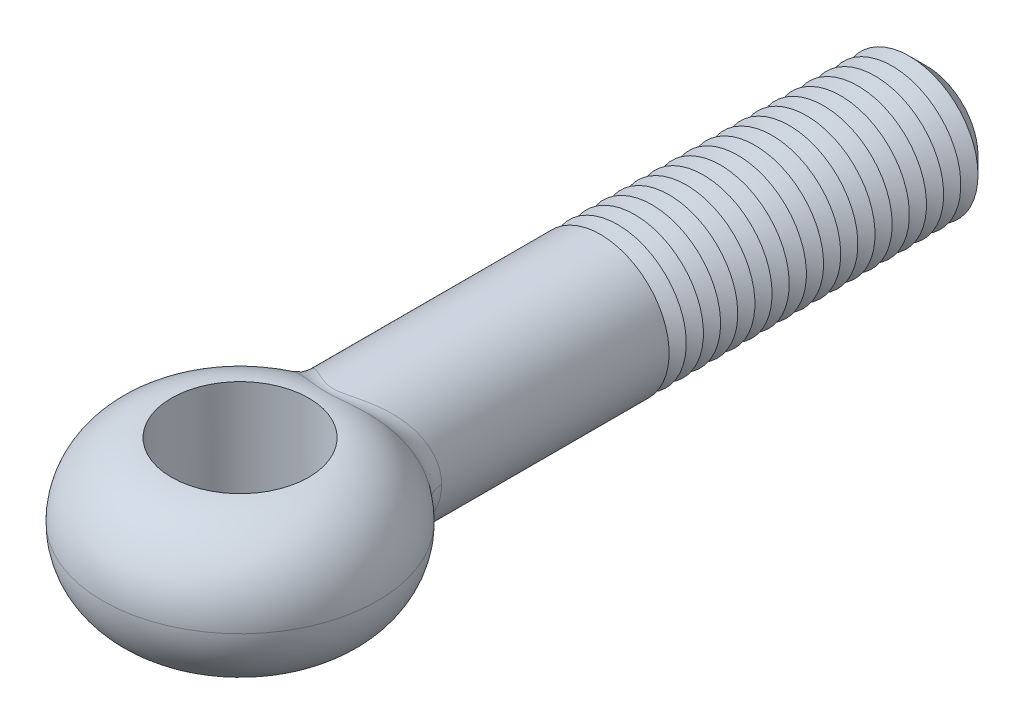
ISO-10303-21;
HEADER;
FILE_DESCRIPTION(('STEP AP214'),'2;1');
FILE_NAME('part.step','',(''),(''),'','','');
FILE_SCHEMA(('AUTOMOTIVE_DESIGN { 1 0 10303 214 1 1 1 1 }'));
ENDSEC;
DATA;
#1=APPLICATION_CONTEXT('core data for automotive mechanical design processes');
#2=APPLICATION_PROTOCOL_DEFINITION('international standard','automotive_design',2000,#1);
#3=PRODUCT_CONTEXT('',#1,'mechanical');
#4=PRODUCT('Part','Part','',(#3));
#5=PRODUCT_RELATED_PRODUCT_CATEGORY('part','',(#4));
#6=PRODUCT_DEFINITION_FORMATION('','',#4);
#7=PRODUCT_DEFINITION_CONTEXT('part definition',#1,'design');
#8=PRODUCT_DEFINITION('design','',#6,#7);
#9=PRODUCT_DEFINITION_SHAPE('','',#8);
#10=(LENGTH_UNIT() NAMED_UNIT(*) SI_UNIT(.MILLI.,.METRE.));
#11=(NAMED_UNIT(*) PLANE_ANGLE_UNIT() SI_UNIT($,.RADIAN.));
#12=(NAMED_UNIT(*) SI_UNIT($,.STERADIAN.) SOLID_ANGLE_UNIT());
#13=UNCERTAINTY_MEASURE_WITH_UNIT(LENGTH_MEASURE(1.E-05),#10,'distance_accuracy_value','');
#14=(GEOMETRIC_REPRESENTATION_CONTEXT(3) GLOBAL_UNCERTAINTY_ASSIGNED_CONTEXT((#13)) GLOBAL_UNIT_ASSIGNED_CONTEXT((#10,
#11,#12)) REPRESENTATION_CONTEXT('',''));
#15=CARTESIAN_POINT('',(0.,0.,0.));
#16=DIRECTION('',(0.,0.,1.));
#17=DIRECTION('',(1.,0.,0.));
#18=AXIS2_PLACEMENT_3D('',#15,#16,#17);
#19=CARTESIAN_POINT('',(0.,0.,-80.));
#20=DIRECTION('',(0.,0.,1.));
#21=DIRECTION('',(1.,0.,0.));
#22=AXIS2_PLACEMENT_3D('',#19,#20,#21);
#23=CYLINDRICAL_SURFACE('',#22,8.);
#24=CARTESIAN_POINT('',(0.,0.,-42.));
#25=DIRECTION('',(0.,0.,-1.));
#26=DIRECTION('',(-1.,0.,0.));
#27=AXIS2_PLACEMENT_3D('',#24,#25,#26);
#28=CIRCLE('',#27,8.);
#29=CARTESIAN_POINT('',(-8.,0.,-42.));
#30=VERTEX_POINT('',#29);
#31=EDGE_CURVE('E78',#30,#30,#28,.T.);
#32=ORIENTED_EDGE('',*,*,#31,.F.);
#33=EDGE_LOOP('',(#32));
#34=FACE_BOUND('',#33,.T.);
#35=CARTESIAN_POINT('',(7.65571552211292,-4.70868832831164,-12.4043242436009));
#36=CARTESIAN_POINT('',(6.72728970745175,-4.34389938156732,-13.262564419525));
#37=CARTESIAN_POINT('',(6.52180502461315,-4.63314787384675,-14.5297396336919));
#38=CARTESIAN_POINT('',(7.78528037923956,-4.53966232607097,-12.4565567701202));
#39=CARTESIAN_POINT('',(6.83379002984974,-4.17832451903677,-13.3197976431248));
#40=CARTESIAN_POINT('',(6.63998731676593,-4.46683351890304,-14.6083073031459));
#41=CARTESIAN_POINT('',(7.90812409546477,-4.36526473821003,-12.5059716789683));
#42=CARTESIAN_POINT('',(6.93368225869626,-4.0095233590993,-13.3734055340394));
#43=CARTESIAN_POINT('',(6.75228850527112,-4.29523375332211,-14.6825830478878));
#44=CARTESIAN_POINT('',(8.13948466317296,-4.00670892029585,-12.5988603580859));
#45=CARTESIAN_POINT('',(7.12062810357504,-3.66549770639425,-13.4736177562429));
#46=CARTESIAN_POINT('',(6.9641575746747,-3.94243016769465,-14.8221229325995));
#47=CARTESIAN_POINT('',(8.24799717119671,-3.82254775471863,-12.6423323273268));
#48=CARTESIAN_POINT('',(7.20758377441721,-3.49031776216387,-13.5201690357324));
#49=CARTESIAN_POINT('',(7.06372159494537,-3.76122345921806,-14.8873843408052));
#50=CARTESIAN_POINT('',(8.44978241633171,-3.44545520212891,-12.7230176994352));
#51=CARTESIAN_POINT('',(7.36833540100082,-3.13449696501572,-13.6061398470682));
#52=CARTESIAN_POINT('',(7.24911953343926,-3.39018051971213,-15.0084504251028));
#53=CARTESIAN_POINT('',(8.54304739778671,-3.25251941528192,-12.7602279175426));
#54=CARTESIAN_POINT('',(7.44203446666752,-2.95392242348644,-13.6455071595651));
#55=CARTESIAN_POINT('',(7.33494646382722,-3.20033995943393,-15.0642502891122));
#56=CARTESIAN_POINT('',(8.71342620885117,-2.85921824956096,-12.8280902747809));
#57=CARTESIAN_POINT('',(7.57598659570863,-2.58837905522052,-13.7170010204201));
#58=CARTESIAN_POINT('',(7.49190592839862,-2.81334843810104,-15.1659728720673));
#59=CARTESIAN_POINT('',(8.79054223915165,-2.65885388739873,-12.8587433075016));
#60=CARTESIAN_POINT('',(7.6361598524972,-2.40349985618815,-13.7490847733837));
#61=CARTESIAN_POINT('',(7.56304046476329,-2.6161984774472,-15.211896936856));
#62=CARTESIAN_POINT('',(8.92571181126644,-2.25853949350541,-12.9123976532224));
#63=CARTESIAN_POINT('',(7.74119890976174,-2.03625449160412,-13.8050560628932));
#64=CARTESIAN_POINT('',(7.68782564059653,-2.22230623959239,-15.292254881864));
#65=CARTESIAN_POINT('',(8.98429621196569,-2.05878122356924,-12.9356123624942));
#66=CARTESIAN_POINT('',(7.78643285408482,-1.85408075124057,-13.8291409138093));
#67=CARTESIAN_POINT('',(7.74196276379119,-2.02575264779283,-15.3270093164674));
#68=CARTESIAN_POINT('',(9.08514258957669,-1.65481550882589,-12.9755337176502));
#69=CARTESIAN_POINT('',(7.86407915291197,-1.48723318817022,-13.8704667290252));
#70=CARTESIAN_POINT('',(7.83520435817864,-1.62826766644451,-15.3867612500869));
#71=CARTESIAN_POINT('',(9.12739921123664,-1.45060662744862,-12.9922382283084));
#72=CARTESIAN_POINT('',(7.89643738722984,-1.3026689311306,-13.887678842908));
#73=CARTESIAN_POINT('',(7.87430389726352,-1.42733486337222,-15.4117555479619));
#74=CARTESIAN_POINT('',(9.19512372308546,-1.03944863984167,-13.0189938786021));
#75=CARTESIAN_POINT('',(7.94822057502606,-0.932097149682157,-13.9152169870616));
#76=CARTESIAN_POINT('',(7.93698863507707,-1.02277299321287,-15.4517833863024));
#77=CARTESIAN_POINT('',(9.22061021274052,-0.832502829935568,-13.0290523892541));
#78=CARTESIAN_POINT('',(7.96762552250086,-0.746210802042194,-13.9255323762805));
#79=CARTESIAN_POINT('',(7.96059102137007,-0.819147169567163,-15.4668279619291));
#80=CARTESIAN_POINT('',(9.25463049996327,-0.417038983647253,-13.042476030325));
#81=CARTESIAN_POINT('',(7.99352641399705,-0.373487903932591,-13.9392998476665));
#82=CARTESIAN_POINT('',(7.99209967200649,-0.41034851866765,-15.4869048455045));
#83=CARTESIAN_POINT('',(9.26315800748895,-0.208520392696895,-13.0458386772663));
#84=CARTESIAN_POINT('',(8.00000000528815,-0.186776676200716,-13.9427400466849));
#85=CARTESIAN_POINT('',(8.00000011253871,-0.205175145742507,-15.4919334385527));
#86=CARTESIAN_POINT('',(9.26315778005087,0.212096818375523,-13.0458386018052));
#87=CARTESIAN_POINT('',(7.99999999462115,0.189980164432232,-13.9427400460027));
#88=CARTESIAN_POINT('',(7.99999988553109,0.208694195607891,-15.4919333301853));
#89=CARTESIAN_POINT('',(9.25433501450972,0.424195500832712,-13.0423595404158));
#90=CARTESIAN_POINT('',(7.99330246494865,0.379894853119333,-13.9391808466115));
#91=CARTESIAN_POINT('',(7.99182588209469,0.417390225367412,-15.4867306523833));
#92=CARTESIAN_POINT('',(9.21912567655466,0.846898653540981,-13.0284665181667));
#93=CARTESIAN_POINT('',(7.96649487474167,0.759132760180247,-13.9249313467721));
#94=CARTESIAN_POINT('',(7.95921621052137,0.833312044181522,-15.4659516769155));
#95=CARTESIAN_POINT('',(9.19273228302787,1.05750251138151,-13.0180498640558));
#96=CARTESIAN_POINT('',(7.94639841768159,0.948323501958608,-13.9142482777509));
#97=CARTESIAN_POINT('',(7.93477422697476,1.04053723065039,-15.4503713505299));
#98=CARTESIAN_POINT('',(9.12263828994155,1.47558922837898,-12.9903565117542));
#99=CARTESIAN_POINT('',(7.89279270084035,1.32522192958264,-13.8857402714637));
#100=CARTESIAN_POINT('',(7.86989829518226,1.45191667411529,-15.4089401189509));
#101=CARTESIAN_POINT('',(9.07893758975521,1.68307206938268,-12.9730797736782));
#102=CARTESIAN_POINT('',(7.85932019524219,1.51280379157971,-13.867934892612));
#103=CARTESIAN_POINT('',(7.82946425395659,1.65607091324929,-15.3830891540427));
#104=CARTESIAN_POINT('',(8.97463738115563,2.09350607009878,-12.9317860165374));
#105=CARTESIAN_POINT('',(7.77898033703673,1.88569930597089,-13.8251732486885));
#106=CARTESIAN_POINT('',(7.73303581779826,2.05992041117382,-15.3212813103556));
#107=CARTESIAN_POINT('',(8.91403167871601,2.29645553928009,-12.9077665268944));
#108=CARTESIAN_POINT('',(7.73216134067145,2.07089682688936,-13.8002427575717));
#109=CARTESIAN_POINT('',(7.67703571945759,2.25961400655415,-15.2853207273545));
#110=CARTESIAN_POINT('',(8.7766400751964,2.69595109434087,-12.8532186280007));
#111=CARTESIAN_POINT('',(7.62531367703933,2.43769964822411,-13.7433022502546));
#112=CARTESIAN_POINT('',(7.55021504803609,2.65270054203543,-15.2036203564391));
#113=CARTESIAN_POINT('',(8.69988632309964,2.8925090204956,-12.8227031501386));
#114=CARTESIAN_POINT('',(7.56537860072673,2.61920953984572,-13.7113422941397));
#115=CARTESIAN_POINT('',(7.47942392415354,2.84610513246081,-15.1578999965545));
#116=CARTESIAN_POINT('',(8.53082157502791,3.27836797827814,-12.7553515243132));
#117=CARTESIAN_POINT('',(7.43237570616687,2.97809298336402,-13.6403484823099));
#118=CARTESIAN_POINT('',(7.32369350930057,3.2257738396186,-15.0569382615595));
#119=CARTESIAN_POINT('',(8.43850992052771,3.46766870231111,-12.7185151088));
#120=CARTESIAN_POINT('',(7.35938539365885,3.15538265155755,-13.6013561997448));
#121=CARTESIAN_POINT('',(7.23875361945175,3.41203765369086,-15.0016964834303));
#122=CARTESIAN_POINT('',(8.23912752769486,3.83785366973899,-12.638780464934));
#123=CARTESIAN_POINT('',(7.200476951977,3.50486381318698,-13.5163651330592));
#124=CARTESIAN_POINT('',(7.05558212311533,3.77628382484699,-14.8820525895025));
#125=CARTESIAN_POINT('',(8.13205660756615,4.01873780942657,-12.5958821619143));
#126=CARTESIAN_POINT('',(7.1146443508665,3.676990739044,-13.470412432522));
#127=CARTESIAN_POINT('',(6.95735035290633,3.9542660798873,-14.8176503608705));
#128=CARTESIAN_POINT('',(7.90405644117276,4.37102436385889,-12.5043342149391));
#129=CARTESIAN_POINT('',(6.93036449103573,4.01512460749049,-13.3716246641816));
#130=CARTESIAN_POINT('',(6.74856869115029,4.30090097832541,-14.6801217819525));
#131=CARTESIAN_POINT('',(7.7831309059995,4.54242929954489,-12.455686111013));
#132=CARTESIAN_POINT('',(6.83201017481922,4.18108915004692,-13.3188399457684));
#133=CARTESIAN_POINT('',(6.6380220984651,4.46955610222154,-14.606997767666));
#134=CARTESIAN_POINT('',(7.52417170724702,4.88033437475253,-12.3512981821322));
#135=CARTESIAN_POINT('',(6.61966655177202,4.51122245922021,-13.2047290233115));
#136=CARTESIAN_POINT('',(6.40182236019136,4.8020402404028,-14.4499782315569));
#137=CARTESIAN_POINT('',(7.38571067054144,5.04649564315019,-12.2953796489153));
#138=CARTESIAN_POINT('',(6.50535488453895,4.67515888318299,-13.1432256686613));
#139=CARTESIAN_POINT('',(6.27579579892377,4.96553581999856,-14.3658104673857));
#140=CARTESIAN_POINT('',(7.09600101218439,5.36700983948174,-12.1781888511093));
#141=CARTESIAN_POINT('',(6.26419128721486,4.99444350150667,-13.0133186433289));
#142=CARTESIAN_POINT('',(6.01283258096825,5.28090807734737,-14.1892780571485));
#143=CARTESIAN_POINT('',(6.9447557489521,5.52136584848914,-12.1169179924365));
#144=CARTESIAN_POINT('',(6.13743653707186,5.14979233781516,-12.9449680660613));
#145=CARTESIAN_POINT('',(5.87589879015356,5.43278778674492,-14.096915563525));
#146=CARTESIAN_POINT('',(6.63032399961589,5.81777921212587,-11.9894408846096));
#147=CARTESIAN_POINT('',(5.87186134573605,5.45104206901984,-12.8016646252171));
#148=CARTESIAN_POINT('',(5.59214975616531,5.72444585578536,-13.9045942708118));
#149=CARTESIAN_POINT('',(6.46713092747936,5.95982968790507,-11.9232319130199));
#150=CARTESIAN_POINT('',(5.73311888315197,5.5969588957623,-12.7267542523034));
#151=CARTESIAN_POINT('',(5.44532906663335,5.864217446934,-13.8046312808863));
#152=CARTESIAN_POINT('',(6.12980638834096,6.23103471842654,-11.7864658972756));
#153=CARTESIAN_POINT('',(5.44428764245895,5.8782916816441,-12.5708631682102));
#154=CARTESIAN_POINT('',(5.14301550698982,6.13107159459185,-13.597971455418));
#155=CARTESIAN_POINT('',(5.95567749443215,6.36019228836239,-11.7159098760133));
#156=CARTESIAN_POINT('',(5.2942739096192,6.01375077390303,-12.4899226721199));
#157=CARTESIAN_POINT('',(4.98752467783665,6.25815711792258,-13.4912762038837));
#158=CARTESIAN_POINT('',(5.58077734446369,6.61655266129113,-11.5644429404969));
#159=CARTESIAN_POINT('',(4.96933836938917,6.28519206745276,-12.3149807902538));
#160=CARTESIAN_POINT('',(4.65426780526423,6.51040475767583,-13.2620454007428));
#161=CARTESIAN_POINT('',(5.37902613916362,6.74249537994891,-11.4831752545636));
#162=CARTESIAN_POINT('',(4.79337910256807,6.42023065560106,-12.2204520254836));
#163=CARTESIAN_POINT('',(4.47576535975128,6.63432700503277,-13.1389537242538));
#164=CARTESIAN_POINT('',(4.96405939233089,6.97841153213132,-11.3172707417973));
#165=CARTESIAN_POINT('',(4.42939848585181,6.67584287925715,-12.0261057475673));
#166=CARTESIAN_POINT('',(4.11078186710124,6.86645840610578,-12.8874694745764));
#167=CARTESIAN_POINT('',(4.75084610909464,7.08838809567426,-11.2326345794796));
#168=CARTESIAN_POINT('',(4.24142531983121,6.79651407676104,-11.9263073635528));
#169=CARTESIAN_POINT('',(3.9243023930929,6.97467063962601,-12.7590779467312));
#170=CARTESIAN_POINT('',(4.31305945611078,7.29234286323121,-11.0613975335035));
#171=CARTESIAN_POINT('',(3.85380278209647,7.02260612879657,-11.7231213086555));
#172=CARTESIAN_POINT('',(3.54408562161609,7.17535340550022,-12.4991467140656));
#173=CARTESIAN_POINT('',(4.08848183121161,7.3863150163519,-10.9747959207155));
#174=CARTESIAN_POINT('',(3.654162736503,7.12813046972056,-11.6197260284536));
#175=CARTESIAN_POINT('',(3.35034561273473,7.26781798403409,-12.3676058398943));
#176=CARTESIAN_POINT('',(3.62764081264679,7.55817215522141,-10.8018106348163));
#177=CARTESIAN_POINT('',(3.24335533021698,7.32304867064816,-11.4120811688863));
#178=CARTESIAN_POINT('',(2.95605890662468,7.43691805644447,-12.1047402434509));
#179=CARTESIAN_POINT('',(3.3913812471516,7.63606236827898,-10.7154268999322));
#180=CARTESIAN_POINT('',(3.03217009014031,7.41256504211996,-11.3077963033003));
#181=CARTESIAN_POINT('',(2.7555144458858,7.51355869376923,-11.9734154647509));
#182=CARTESIAN_POINT('',(3.01086953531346,7.74546693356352,-10.5830417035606));
#183=CARTESIAN_POINT('',(2.69133046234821,7.53961841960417,-11.1471485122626));
#184=CARTESIAN_POINT('',(2.43558876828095,7.62120810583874,-11.7721230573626));
#185=CARTESIAN_POINT('',(2.87105562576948,7.78246196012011,-10.5357450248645));
#186=CARTESIAN_POINT('',(2.5661213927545,7.58284459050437,-11.0896499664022));
#187=CARTESIAN_POINT('',(2.31864844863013,7.65760962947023,-11.700201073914));
#188=CARTESIAN_POINT('',(2.58677327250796,7.85120381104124,-10.4433981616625));
#189=CARTESIAN_POINT('',(2.31149724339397,7.66361225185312,-10.9771506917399));
#190=CARTESIAN_POINT('',(2.08222311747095,7.725248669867,-11.5597728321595));
#191=CARTESIAN_POINT('',(2.4423056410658,7.88295154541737,-10.3983475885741));
#192=CARTESIAN_POINT('',(2.18206471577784,7.70117677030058,-10.9221313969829));
#193=CARTESIAN_POINT('',(1.96273855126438,7.75648708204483,-11.4912659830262));
#194=CARTESIAN_POINT('',(2.14829229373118,7.94107768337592,-10.3118779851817));
#195=CARTESIAN_POINT('',(1.91873101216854,7.77031102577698,-10.8163504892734));
#196=CARTESIAN_POINT('',(1.72099254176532,7.81368071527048,-11.3597855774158));
#197=CARTESIAN_POINT('',(1.99874950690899,7.96745912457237,-10.270456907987));
#198=CARTESIAN_POINT('',(1.78480669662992,7.80190571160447,-10.7655636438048));
#199=CARTESIAN_POINT('',(1.59873271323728,7.83963892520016,-11.2968089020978));
#200=CARTESIAN_POINT('',(1.69405593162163,8.0146723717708,-10.193104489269));
#201=CARTESIAN_POINT('',(1.51212291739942,7.85870857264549,-10.6706050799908));
#202=CARTESIAN_POINT('',(1.35106400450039,7.88609474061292,-11.1792198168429));
#203=CARTESIAN_POINT('',(1.53890651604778,8.03550552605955,-10.1571718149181));
#204=CARTESIAN_POINT('',(1.3733287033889,7.88393882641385,-10.6264046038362));
#205=CARTESIAN_POINT('',(1.22565589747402,7.90659367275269,-11.1246053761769));
#206=CARTESIAN_POINT('',(1.26101534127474,8.06699003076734,-10.1009556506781));
#207=CARTESIAN_POINT('',(1.12491664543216,7.92221302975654,-10.5571921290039));
#208=CARTESIAN_POINT('',(1.00219933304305,7.93757307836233,-11.0391767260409));
#209=CARTESIAN_POINT('',(1.13947852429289,8.07888519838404,-10.0789878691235));
#210=CARTESIAN_POINT('',(1.01633877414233,7.93673299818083,-10.5301169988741));
#211=CARTESIAN_POINT('',(0.90484411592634,7.94927741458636,-11.0057989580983));
#212=CARTESIAN_POINT('',(0.893460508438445,8.09911575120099,-10.0408546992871));
#213=CARTESIAN_POINT('',(0.796699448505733,7.96148016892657,-10.4831027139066));
#214=CARTESIAN_POINT('',(0.708414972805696,7.96918341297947,-10.9478665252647));
#215=CARTESIAN_POINT('',(0.768980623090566,8.10745269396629,-10.0246867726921));
#216=CARTESIAN_POINT('',(0.685612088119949,7.97171600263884,-10.4631484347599));
#217=CARTESIAN_POINT('',(0.609341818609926,7.97738660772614,-10.9233080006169));
#218=CARTESIAN_POINT('',(0.518300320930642,8.12036544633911,-9.9993428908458));
#219=CARTESIAN_POINT('',(0.46202700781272,7.98758747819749,-10.4318683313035));
#220=CARTESIAN_POINT('',(0.410276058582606,7.99009220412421,-10.8848145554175));
#221=CARTESIAN_POINT('',(0.39210936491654,8.12495695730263,-9.99013775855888));
#222=CARTESIAN_POINT('',(0.349505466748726,7.99324704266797,-10.4204974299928));
#223=CARTESIAN_POINT('',(0.310289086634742,7.99461005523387,-10.8708353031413));
#224=CARTESIAN_POINT('',(0.138717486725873,8.13030926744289,-9.97938544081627));
#225=CARTESIAN_POINT('',(0.123640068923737,7.99984388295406,-10.4072188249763));
#226=CARTESIAN_POINT('',(0.109710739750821,7.99987649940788,-10.8545066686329));
#227=CARTESIAN_POINT('',(0.0115166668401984,8.13107044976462,-9.97783748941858));
#228=CARTESIAN_POINT('',(0.0102607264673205,8.00078372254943,-10.4053059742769));
#229=CARTESIAN_POINT('',(0.00911942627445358,8.00062546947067,-10.8521561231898));
#230=CARTESIAN_POINT('',(-0.242597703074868,8.12873778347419,-9.98254200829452));
#231=CARTESIAN_POINT('',(-0.216224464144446,7.99790731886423,-10.4111163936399));
#232=CARTESIAN_POINT('',(-0.191921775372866,7.99833022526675,-10.8593002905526));
#233=CARTESIAN_POINT('',(-0.369510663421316,8.1256389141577,-9.9888046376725));
#234=CARTESIAN_POINT('',(-0.329366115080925,7.99408395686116,-10.4188540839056));
#235=CARTESIAN_POINT('',(-0.292371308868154,7.9952810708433,-10.8688104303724));
#236=CARTESIAN_POINT('',(-0.62154313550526,8.1156691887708,-10.0085955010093));
#237=CARTESIAN_POINT('',(-0.55409126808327,7.98181341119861,-10.4432875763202));
#238=CARTESIAN_POINT('',(-0.492201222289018,7.98547128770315,-10.8988675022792));
#239=CARTESIAN_POINT('',(-0.746662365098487,8.1087977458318,-10.0221248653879));
#240=CARTESIAN_POINT('',(-0.665708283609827,7.97336172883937,-10.4599921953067));
#241=CARTESIAN_POINT('',(-0.591581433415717,7.97871008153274,-10.9194161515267));
#242=CARTESIAN_POINT('',(-0.994807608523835,8.09140385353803,-10.0554975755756));
#243=CARTESIAN_POINT('',(-0.887155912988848,7.95203968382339,-10.5011571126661));
#244=CARTESIAN_POINT('',(-0.789239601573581,7.9615952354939,-10.9701112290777));
#245=CARTESIAN_POINT('',(-1.11781918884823,8.08086243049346,-10.0753736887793));
#246=CARTESIAN_POINT('',(-0.997003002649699,7.93914030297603,-10.5256688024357));
#247=CARTESIAN_POINT('',(-0.887509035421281,7.95122292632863,-11.0003074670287));
#248=CARTESIAN_POINT('',(-1.36062252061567,8.05632046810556,-10.1202009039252));
#249=CARTESIAN_POINT('',(-1.21391840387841,7.90923091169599,-10.5808872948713));
#250=CARTESIAN_POINT('',(-1.08217747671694,7.92707468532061,-11.0684211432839));
#251=CARTESIAN_POINT('',(-1.48041386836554,8.04231949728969,-10.1451526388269));
#252=CARTESIAN_POINT('',(-1.32101027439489,7.89221272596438,-10.6116076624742));
#253=CARTESIAN_POINT('',(-1.17857624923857,7.91329832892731,-11.1063395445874));
#254=CARTESIAN_POINT('',(-1.83571751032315,7.99525450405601,-10.2260259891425));
#255=CARTESIAN_POINT('',(-1.63896719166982,7.83523151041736,-10.7111025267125));
#256=CARTESIAN_POINT('',(-1.46567741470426,7.86698838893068,-11.2292596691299));
#257=CARTESIAN_POINT('',(-2.06624268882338,7.95719484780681,-10.2878252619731));
#258=CARTESIAN_POINT('',(-1.84542427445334,7.78943990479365,-10.786994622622));
#259=CARTESIAN_POINT('',(-1.65355562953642,7.82953931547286,-11.323212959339));
#260=CARTESIAN_POINT('',(-2.51536964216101,7.86860887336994,-10.4197592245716));
#261=CARTESIAN_POINT('',(-2.24768618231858,7.68406371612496,-10.9484016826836));
#262=CARTESIAN_POINT('',(-2.02278766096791,7.74237450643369,-11.523822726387));
#263=CARTESIAN_POINT('',(-2.7339584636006,7.81806932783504,-10.4899027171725));
#264=CARTESIAN_POINT('',(-2.44357001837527,7.62438808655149,-11.0340073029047));
#265=CARTESIAN_POINT('',(-2.20413431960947,7.69264575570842,-11.6304926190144));
#266=CARTESIAN_POINT('',(-3.16114079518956,7.7047711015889,-10.6341356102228));
#267=CARTESIAN_POINT('',(-2.82605678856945,7.49212963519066,-11.209290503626));
#268=CARTESIAN_POINT('',(-2.56144019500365,7.5811651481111,-11.8498152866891));
#269=CARTESIAN_POINT('',(-3.36972002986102,7.64199557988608,-10.7082303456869));
#270=CARTESIAN_POINT('',(-3.01269895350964,7.41945044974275,-11.2990288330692));
#271=CARTESIAN_POINT('',(-2.7373915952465,7.51939672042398,-11.9624761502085));
#272=CARTESIAN_POINT('',(-3.77761069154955,7.50439428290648,-10.8574864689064));
#273=CARTESIAN_POINT('',(-3.37700705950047,7.26193164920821,-11.478951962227));
#274=CARTESIAN_POINT('',(-3.08400676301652,7.38400293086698,-12.1893535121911));
#275=CARTESIAN_POINT('',(-3.97692585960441,7.42957342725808,-10.9326474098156));
#276=CARTESIAN_POINT('',(-3.55470238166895,7.17701899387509,-11.5691696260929));
#277=CARTESIAN_POINT('',(-3.25467265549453,7.31038240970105,-12.3035693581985));
#278=CARTESIAN_POINT('',(-4.39445558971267,7.2564786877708,-11.0928561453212));
#279=CARTESIAN_POINT('',(-3.92598763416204,6.98268785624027,-11.7605523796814));
#280=CARTESIAN_POINT('',(-3.61448048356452,7.14006459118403,-12.5469124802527));
#281=CARTESIAN_POINT('',(-4.61137762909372,7.15638577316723,-11.1778053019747));
#282=CARTESIAN_POINT('',(-4.11816178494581,6.87146818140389,-11.8614202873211));
#283=CARTESIAN_POINT('',(-3.80283870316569,7.04157744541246,-12.6758739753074));
#284=CARTESIAN_POINT('',(-5.03418640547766,6.94053636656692,-11.3451201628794));
#285=CARTESIAN_POINT('',(-4.49106527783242,6.6346292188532,-12.0588431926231));
#286=CARTESIAN_POINT('',(-4.17223411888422,6.82919086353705,-12.9297006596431));
#287=CARTESIAN_POINT('',(-5.24007150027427,6.82477755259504,-11.4274854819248));
#288=CARTESIAN_POINT('',(-4.67176487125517,6.50890803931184,-12.1553921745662));
#289=CARTESIAN_POINT('',(-4.35327022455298,6.71528914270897,-13.0545652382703));
#290=CARTESIAN_POINT('',(-5.64018983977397,6.57785054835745,-11.5883608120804));
#291=CARTESIAN_POINT('',(-5.02102168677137,6.24402103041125,-12.3427259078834));
#292=CARTESIAN_POINT('',(-4.70691034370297,6.47232353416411,-13.2982594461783));
#293=CARTESIAN_POINT('',(-5.83443208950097,6.44669450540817,-11.6668737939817));
#294=CARTESIAN_POINT('',(-5.18953304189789,6.10478124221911,-12.4334896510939));
#295=CARTESIAN_POINT('',(-4.87952085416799,6.34327159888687,-13.417093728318));
#296=CARTESIAN_POINT('',(-6.21062987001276,6.16921890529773,-11.8191988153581));
#297=CARTESIAN_POINT('',(-5.5138573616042,5.81373255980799,-12.6083829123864));
#298=CARTESIAN_POINT('',(-5.2152572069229,6.07024747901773,-13.6474577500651));
#299=CARTESIAN_POINT('',(-6.39258596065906,6.02290003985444,-11.8930110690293));
#300=CARTESIAN_POINT('',(-5.66959067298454,5.66186103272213,-12.6924706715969));
#301=CARTESIAN_POINT('',(-5.37838348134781,5.9262759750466,-13.7589878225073));
#302=CARTESIAN_POINT('',(-6.76082954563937,5.70011889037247,-12.0423592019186));
#303=CARTESIAN_POINT('',(-5.98269684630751,5.33064591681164,-12.8614822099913));
#304=CARTESIAN_POINT('',(-5.7096924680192,5.60867313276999,-13.9844670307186));
#305=CARTESIAN_POINT('',(-6.94571467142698,5.52210505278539,-12.1173228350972));
#306=CARTESIAN_POINT('',(-6.1384387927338,5.15012845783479,-12.9455201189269));
#307=CARTESIAN_POINT('',(-5.87673584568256,5.4335151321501,-14.0975328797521));
#308=CARTESIAN_POINT('',(-7.2978095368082,5.14921557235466,-12.2598587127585));
#309=CARTESIAN_POINT('',(-6.432710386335,4.77666871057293,-13.1041242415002));
#310=CARTESIAN_POINT('',(-6.19585367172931,5.06660783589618,-14.3123318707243));
#311=CARTESIAN_POINT('',(-7.46501728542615,4.95433803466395,-12.3274301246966));
#312=CARTESIAN_POINT('',(-6.5710843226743,4.58371724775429,-13.1786053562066));
#313=CARTESIAN_POINT('',(-6.34792643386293,4.87485667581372,-14.4140637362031));
#314=CARTESIAN_POINT('',(-7.78013527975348,4.54891459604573,-12.4544969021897));
#315=CARTESIAN_POINT('',(-6.82982333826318,4.18696009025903,-13.3176780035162));
#316=CARTESIAN_POINT('',(-6.63524155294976,4.47593735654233,-14.6052189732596));
#317=CARTESIAN_POINT('',(-7.92803665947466,4.33836156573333,-12.5139885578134));
#318=CARTESIAN_POINT('',(-6.95001540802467,3.98318853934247,-13.3821752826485));
#319=CARTESIAN_POINT('',(-6.77047617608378,4.26876218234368,-14.6946366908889));
#320=CARTESIAN_POINT('',(-8.20275756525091,3.90330017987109,-12.6242339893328));
#321=CARTESIAN_POINT('',(-7.17161528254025,3.56660483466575,-13.5009298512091));
#322=CARTESIAN_POINT('',(-7.02216465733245,3.84068039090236,-14.8602256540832));
#323=CARTESIAN_POINT('',(-8.32958109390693,3.67879448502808,-12.6749894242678));
#324=CARTESIAN_POINT('',(-7.27286247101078,3.35388041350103,-13.5551002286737));
#325=CARTESIAN_POINT('',(-7.13862208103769,3.61977639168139,-14.9363994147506));
#326=CARTESIAN_POINT('',(-8.54733325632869,3.24423340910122,-12.7619453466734));
#327=CARTESIAN_POINT('',(-7.44552191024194,2.94603669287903,-13.6473748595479));
#328=CARTESIAN_POINT('',(-7.33887694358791,3.19218688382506,-15.0668289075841));
#329=CARTESIAN_POINT('',(-8.64071095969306,3.03547652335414,-12.7991477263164));
#330=CARTESIAN_POINT('',(-7.51894899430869,2.75170647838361,-13.6865686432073));
#331=CARTESIAN_POINT('',(-7.42488873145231,2.98677903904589,-15.1225967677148));
#332=CARTESIAN_POINT('',(-8.80876711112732,2.61008550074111,-12.865990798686));
#333=CARTESIAN_POINT('',(-7.65044657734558,2.35845430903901,-13.7567044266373));
#334=CARTESIAN_POINT('',(-7.57984616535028,2.56821247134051,-15.2227563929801));
#335=CARTESIAN_POINT('',(-8.88344772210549,2.39345227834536,-12.8956323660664));
#336=CARTESIAN_POINT('',(-7.70842508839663,2.15964982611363,-13.7875971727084));
#337=CARTESIAN_POINT('',(-7.64879378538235,2.35505464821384,-15.2671494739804));
#338=CARTESIAN_POINT('',(-9.01314517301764,1.9545388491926,-12.9470441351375));
#339=CARTESIAN_POINT('',(-7.80874691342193,1.75904530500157,-13.8410223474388));
#340=CARTESIAN_POINT('',(-7.76862124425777,1.9231826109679,-15.3441237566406));
#341=CARTESIAN_POINT('',(-9.06820874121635,1.7322734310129,-12.9688330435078));
#342=CARTESIAN_POINT('',(-7.85105172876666,1.55739026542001,-13.8635342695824));
#343=CARTESIAN_POINT('',(-7.81954401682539,1.70448294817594,-15.3767330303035));
#344=CARTESIAN_POINT('',(-9.15827613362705,1.28352045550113,-13.0044431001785));
#345=CARTESIAN_POINT('',(-7.92010315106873,1.151767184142,-13.9002668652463));
#346=CARTESIAN_POINT('',(-7.90287516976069,1.26292921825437,-15.4300168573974));
#347=CARTESIAN_POINT('',(-9.19329180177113,1.05703547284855,-13.0182689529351));
#348=CARTESIAN_POINT('',(-7.94680432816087,0.94795427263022,-13.9144633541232));
#349=CARTESIAN_POINT('',(-7.93529448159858,1.04007768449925,-15.4506984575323));
#350=CARTESIAN_POINT('',(-9.23310033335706,0.691727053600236,-13.0339812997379));
#351=CARTESIAN_POINT('',(-7.97713736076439,0.619900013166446,-13.9305885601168));
#352=CARTESIAN_POINT('',(-7.97215833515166,0.680629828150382,-15.4742000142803));
#353=CARTESIAN_POINT('',(-9.24436828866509,0.553629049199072,-13.0384268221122));
#354=CARTESIAN_POINT('',(-7.98571004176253,0.496050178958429,-13.9351451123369));
#355=CARTESIAN_POINT('',(-7.9825950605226,0.544747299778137,-15.4808487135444));
#356=CARTESIAN_POINT('',(-9.25939658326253,0.277025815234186,-13.0443552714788));
#357=CARTESIAN_POINT('',(-7.99714237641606,0.248119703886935,-13.9412213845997));
#358=CARTESIAN_POINT('',(-7.99651547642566,0.272581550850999,-15.4897150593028));
#359=CARTESIAN_POINT('',(-9.26315875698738,0.138520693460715,-13.0458389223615));
#360=CARTESIAN_POINT('',(-7.99999999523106,0.124076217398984,-13.9427400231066));
#361=CARTESIAN_POINT('',(-8.00000086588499,0.136298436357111,-15.4919337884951));
#362=CARTESIAN_POINT('',(-9.26315657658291,-0.211761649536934,-13.0458382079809));
#363=CARTESIAN_POINT('',(-8.00000000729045,-0.189679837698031,-13.9427400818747));
#364=CARTESIAN_POINT('',(-7.99999867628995,-0.208364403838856,-15.4919327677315));
#365=CARTESIAN_POINT('',(-9.25436090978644,-0.423559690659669,-13.0423697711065));
#366=CARTESIAN_POINT('',(-7.99332234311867,-0.379325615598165,-13.9391914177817));
#367=CARTESIAN_POINT('',(-7.99184985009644,-0.41676461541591,-15.486745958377));
#368=CARTESIAN_POINT('',(-9.2192545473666,-0.845675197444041,-13.0285173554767));
#369=CARTESIAN_POINT('',(-7.96659277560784,-0.758034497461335,-13.9249833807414));
#370=CARTESIAN_POINT('',(-7.95933558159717,-0.832108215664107,-15.4660277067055));
#371=CARTESIAN_POINT('',(-9.19293494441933,-1.05599185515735,-13.0181298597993));
#372=CARTESIAN_POINT('',(-7.94655277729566,-0.946965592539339,-13.9143303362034));
#373=CARTESIAN_POINT('',(-7.93496189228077,-1.03905080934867,-15.4504910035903));
#374=CARTESIAN_POINT('',(-9.12293145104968,-1.47414078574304,-12.9904724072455));
#375=CARTESIAN_POINT('',(-7.89301742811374,-1.32391258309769,-13.8858598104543));
#376=CARTESIAN_POINT('',(-7.87016954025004,-1.45049146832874,-15.4091135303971));
#377=CARTESIAN_POINT('',(-9.0791962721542,-1.68196383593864,-12.9731821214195));
#378=CARTESIAN_POINT('',(-7.85951913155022,-1.51179861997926,-13.8680407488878));
#379=CARTESIAN_POINT('',(-7.82970348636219,-1.65498045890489,-15.38324232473));
#380=CARTESIAN_POINT('',(-8.97478996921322,-2.09299557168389,-12.9318464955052));
#381=CARTESIAN_POINT('',(-7.77909835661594,-1.88523285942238,-13.8252360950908));
#382=CARTESIAN_POINT('',(-7.73317681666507,-2.05941810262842,-15.3213718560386));
#383=CARTESIAN_POINT('',(-8.91411827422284,-2.29620410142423,-12.9078009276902));
#384=CARTESIAN_POINT('',(-7.73222890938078,-2.07066511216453,-13.8002787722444));
#385=CARTESIAN_POINT('',(-7.67711567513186,-2.25936660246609,-15.2853722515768));
#386=CARTESIAN_POINT('',(-8.7765466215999,-2.69622247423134,-12.8531815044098));
#387=CARTESIAN_POINT('',(-7.62524114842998,-2.43794839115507,-13.7432635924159));
#388=CARTESIAN_POINT('',(-7.55012876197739,-2.65296756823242,-15.203564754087));
#389=CARTESIAN_POINT('',(-8.69967722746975,-2.89304357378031,-12.8226199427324));
#390=CARTESIAN_POINT('',(-7.56521539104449,-2.61970332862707,-13.7112552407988));
#391=CARTESIAN_POINT('',(-7.47923098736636,-2.84663111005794,-15.1577753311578));
#392=CARTESIAN_POINT('',(-8.53033202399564,-3.27942770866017,-12.7551564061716));
#393=CARTESIAN_POINT('',(-7.43198999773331,-2.97908029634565,-13.6401425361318));
#394=CARTESIAN_POINT('',(-7.32324290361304,-3.22681656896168,-15.056645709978));
#395=CARTESIAN_POINT('',(-8.43785406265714,-3.46898973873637,-12.7182535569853));
#396=CARTESIAN_POINT('',(-7.35886693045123,-3.15661777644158,-13.6010792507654));
#397=CARTESIAN_POINT('',(-7.23815063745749,-3.4133374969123,-15.0013041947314));
#398=CARTESIAN_POINT('',(-8.23838126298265,-3.83913533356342,-12.6384812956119));
#399=CARTESIAN_POINT('',(-7.19987817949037,-3.50608561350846,-13.5160445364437));
#400=CARTESIAN_POINT('',(-7.05489698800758,-3.7775449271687,-14.881603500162));
#401=CARTESIAN_POINT('',(-8.13142827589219,-4.01974280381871,-12.5956290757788));
#402=CARTESIAN_POINT('',(-7.11413550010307,-3.67796425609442,-13.4701394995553));
#403=CARTESIAN_POINT('',(-6.95677329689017,-3.95525495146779,-14.8172703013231));
#404=CARTESIAN_POINT('',(-7.90371313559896,-4.37152047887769,-12.5041971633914));
#405=CARTESIAN_POINT('',(-6.93008703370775,-4.01559388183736,-13.3714760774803));
#406=CARTESIAN_POINT('',(-6.74825601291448,-4.3013891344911,-14.6799157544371));
#407=CARTESIAN_POINT('',(-7.78295514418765,-4.54269350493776,-12.4556191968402));
#408=CARTESIAN_POINT('',(-6.83187409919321,-4.18130307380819,-13.3187679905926));
#409=CARTESIAN_POINT('',(-6.63786611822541,-4.46981606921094,-14.6068970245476));
#410=CARTESIAN_POINT('',(-7.65571552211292,-4.70868832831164,-12.4043242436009));
#411=CARTESIAN_POINT('',(-6.72728970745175,-4.34389938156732,-13.262564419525));
#412=CARTESIAN_POINT('',(-6.52180502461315,-4.63314787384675,-14.5297396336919));
#413=(BOUNDED_SURFACE() B_SPLINE_SURFACE(3,2,((#35,#36,#37),(#38,#39,#40),(#41,#42,#43),(#44,
#45,#46),(#47,#48,#49),(#50,#51,#52),(#53,#54,#55),(#56,#57,#58),(#59,#60,#61),(#62,#63,#64),
(#65,#66,#67),(#68,#69,#70),(#71,#72,#73),(#74,#75,#76),(#77,#78,#79),(#80,#81,#82),(#83,#84,
#85),(#86,#87,#88),(#89,#90,#91),(#92,#93,#94),(#95,#96,#97),(#98,#99,#100),(#101,#102,#103),
(#104,#105,#106),(#107,#108,#109),(#110,#111,#112),(#113,#114,#115),(#116,#117,#118),(#119,#120,
#121),(#122,#123,#124),(#125,#126,#127),(#128,#129,#130),(#131,#132,#133),(#134,#135,#136),
(#137,#138,#139),(#140,#141,#142),(#143,#144,#145),(#146,#147,#148),(#149,#150,#151),(#152,#153,
#154),(#155,#156,#157),(#158,#159,#160),(#161,#162,#163),(#164,#165,#166),(#167,#168,#169),
(#170,#171,#172),(#173,#174,#175),(#176,#177,#178),(#179,#180,#181),(#182,#183,#184),(#185,#186,
#187),(#188,#189,#190),(#191,#192,#193),(#194,#195,#196),(#197,#198,#199),(#200,#201,#202),
(#203,#204,#205),(#206,#207,#208),(#209,#210,#211),(#212,#213,#214),(#215,#216,#217),(#218,#219,
#220),(#221,#222,#223),(#224,#225,#226),(#227,#228,#229),(#230,#231,#232),(#233,#234,#235),
(#236,#237,#238),(#239,#240,#241),(#242,#243,#244),(#245,#246,#247),(#248,#249,#250),(#251,#252,
#253),(#254,#255,#256),(#257,#258,#259),(#260,#261,#262),(#263,#264,#265),(#266,#267,#268),
(#269,#270,#271),(#272,#273,#274),(#275,#276,#277),(#278,#279,#280),(#281,#282,#283),(#284,#285,
#286),(#287,#288,#289),(#290,#291,#292),(#293,#294,#295),(#296,#297,#298),(#299,#300,#301),
(#302,#303,#304),(#305,#306,#307),(#308,#309,#310),(#311,#312,#313),(#314,#315,#316),(#317,#318,
#319),(#320,#321,#322),(#323,#324,#325),(#326,#327,#328),(#329,#330,#331),(#332,#333,#334),
(#335,#336,#337),(#338,#339,#340),(#341,#342,#343),(#344,#345,#346),(#347,#348,#349),(#350,#351,
#352),(#353,#354,#355),(#356,#357,#358),(#359,#360,#361),(#362,#363,#364),(#365,#366,#367),
(#368,#369,#370),(#371,#372,#373),(#374,#375,#376),(#377,#378,#379),(#380,#381,#382),(#383,#384,
#385),(#386,#387,#388),(#389,#390,#391),(#392,#393,#394),(#395,#396,#397),(#398,#399,#400),
(#401,#402,#403),(#404,#405,#406),(#407,#408,#409),(#410,#411,#412)),.UNSPECIFIED.,.F.,.F.,
.F.) B_SPLINE_SURFACE_WITH_KNOTS((4,2,2,2,2,2,2,2,2,2,2,2,2,2,2,2,2,2,2,2,2,2,2,2,2,2,2,2,2,2,2,
2,2,2,2,2,2,2,2,2,2,2,2,2,2,2,2,2,2,2,2,2,2,2,2,2,2,2,2,2,2,2,4),(3,3),(0.,0.873822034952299,
1.74790830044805,2.62243779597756,3.49684803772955,4.34328791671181,5.19000517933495,
6.03578177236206,6.88187200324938,7.74247390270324,8.60341009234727,9.46435128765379,
10.3256083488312,11.1851666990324,12.0447614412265,12.9043667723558,13.7637423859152,
14.6509629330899,15.537951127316,16.4254319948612,17.3127048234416,18.2811590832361,
19.2494232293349,20.2180526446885,21.1863667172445,21.7355609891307,22.2846599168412,
22.8334471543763,23.3821009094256,23.798477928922,24.2146724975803,24.6291132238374,
25.0435124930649,25.4584513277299,25.8734547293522,26.2906363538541,26.70787003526,
27.5454035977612,28.3838286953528,29.2234160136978,30.0626612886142,31.0201220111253,
31.9777248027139,32.9345771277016,33.8913858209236,34.9443500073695,35.9974326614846,
37.0509972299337,38.1043615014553,39.0368386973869,39.9692079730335,40.8993412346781,
41.8289244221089,42.3911753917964,42.9532889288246,43.8126124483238,44.6723730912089,
45.5346846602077,46.3970253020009,47.2577531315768,48.118599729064,48.9770085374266,
49.8351592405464),(0.,1.),
.UNSPECIFIED.) GEOMETRIC_REPRESENTATION_ITEM() RATIONAL_B_SPLINE_SURFACE(((1.,0.915774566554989,
1.),(1.,0.913691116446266,1.),(1.,0.911687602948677,1.),(1.,0.907872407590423,1.),(1.,
0.906060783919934,1.),(1.,0.902661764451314,1.),(1.,0.901074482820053,1.),(1.,0.898154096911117,
1.),(1.,0.896820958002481,1.),(1.,0.894471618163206,1.),(1.,0.893446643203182,1.),(1.,
0.891675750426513,1.),(1.,0.890929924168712,1.),(1.,0.88973197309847,1.),(1.,0.889279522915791,
1.),(1.,0.88867513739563,1.),(1.,0.888523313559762,1.),(1.,0.888523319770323,1.),(1.,
0.8886804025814,1.),(1.,0.889305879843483,1.),(1.,0.889774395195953,1.),(1.,0.891014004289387,
1.),(1.,0.891785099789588,1.),(1.,0.893615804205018,1.),(1.,0.894675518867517,1.),(1.,
0.897061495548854,1.),(1.,0.898387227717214,1.),(1.,0.901282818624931,1.),(1.,0.902852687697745,
1.),(1.,0.906209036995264,1.),(1.,0.90799551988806,1.),(1.,0.911754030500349,1.),(1.,
0.913726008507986,1.),(1.,0.9178895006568,1.),(1.,0.920086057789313,1.),(1.,0.924603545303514,
1.),(1.,0.926924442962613,1.),(1.,0.931652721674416,1.),(1.,0.934060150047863,1.),(1.,
0.938918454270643,1.),(1.,0.941369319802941,1.),(1.,0.946497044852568,1.),(1.,0.949174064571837,
1.),(1.,0.954471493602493,1.),(1.,0.957091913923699,1.),(1.,0.962215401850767,1.),(1.,
0.964718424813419,1.),(1.,0.96953568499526,1.),(1.,0.971849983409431,1.),(1.,0.975261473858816,
1.),(1.,0.976451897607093,1.),(1.,0.978724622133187,1.),(1.,0.97980694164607,1.),(1.,
0.981839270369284,1.),(1.,0.982789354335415,1.),(1.,0.984528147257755,1.),(1.,0.985316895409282,
1.),(1.,0.986530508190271,1.),(1.,0.986997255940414,1.),(1.,0.987799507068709,1.),(1.,
0.98813506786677,1.),(1.,0.988658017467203,1.),(1.,0.988846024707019,1.),(1.,0.989065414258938,
1.),(1.,0.989096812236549,1.),(1.,0.989001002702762,1.),(1.,0.988873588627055,1.),(1.,
0.988467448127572,1.),(1.,0.988188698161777,1.),(1.,0.987492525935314,1.),(1.,0.987074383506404,
1.),(1.,0.986117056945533,1.),(1.,0.985577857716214,1.),(1.,0.983799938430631,1.),(1.,
0.982403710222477,1.),(1.,0.979304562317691,1.),(1.,0.977601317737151,1.),(1.,0.97396608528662,
1.),(1.,0.972033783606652,1.),(1.,0.968004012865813,1.),(1.,0.965906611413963,1.),(1.,
0.961291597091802,1.),(1.,0.958756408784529,1.),(1.,0.953598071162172,1.),(1.,0.950974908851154,
1.),(1.,0.945700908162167,1.),(1.,0.943050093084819,1.),(1.,0.937773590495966,1.),(1.,
0.935147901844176,1.),(1.,0.929713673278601,1.),(1.,0.926913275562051,1.),(1.,0.921473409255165,
1.),(1.,0.91883395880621,1.),(1.,0.913779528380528,1.),(1.,0.911364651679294,1.),(1.,
0.90682163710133,1.),(1.,0.90469344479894,1.),(1.,0.901003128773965,1.),(1.,0.899404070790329,
1.),(1.,0.896506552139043,1.),(1.,0.895208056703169,1.),(1.,0.892941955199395,1.),(1.,
0.89197356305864,1.),(1.,0.890384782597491,1.),(1.,0.889764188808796,1.),(1.,0.889057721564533,
1.),(1.,0.888857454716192,1.),(1.,0.888590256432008,1.),(1.,0.888523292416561,1.),(1.,
0.888523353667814,1.),(1.,0.888679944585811,1.),(1.,0.889303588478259,1.),(1.,0.889770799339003,
1.),(1.,0.891008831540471,1.),(1.,0.891780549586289,1.),(1.,0.893613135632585,1.),(1.,
0.894674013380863,1.),(1.,0.897063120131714,1.),(1.,0.89839084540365,1.),(1.,0.901291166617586,
1.),(1.,0.902863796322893,1.),(1.,0.906221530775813,1.),(1.,0.908006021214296,1.),(1.,
0.911759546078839,1.),(1.,0.913728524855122,1.),(1.,0.915774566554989,1.))) REPRESENTATION_ITEM('') SURFACE());
#414=CARTESIAN_POINT('',(-6.52180502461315,-4.63314787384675,-14.5297396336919));
#415=CARTESIAN_POINT('',(-6.63786611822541,-4.46981606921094,-14.6068970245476));
#416=CARTESIAN_POINT('',(-6.74825601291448,-4.3013891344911,-14.6799157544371));
#417=CARTESIAN_POINT('',(-6.95677329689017,-3.95525495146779,-14.8172703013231));
#418=CARTESIAN_POINT('',(-7.05489698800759,-3.7775449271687,-14.881603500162));
#419=CARTESIAN_POINT('',(-7.23815063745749,-3.4133374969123,-15.0013041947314));
#420=CARTESIAN_POINT('',(-7.32324290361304,-3.22681656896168,-15.056645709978));
#421=CARTESIAN_POINT('',(-7.47923098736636,-2.84663111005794,-15.1577753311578));
#422=CARTESIAN_POINT('',(-7.55012876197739,-2.65296756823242,-15.203564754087));
#423=CARTESIAN_POINT('',(-7.67711567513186,-2.25936660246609,-15.2853722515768));
#424=CARTESIAN_POINT('',(-7.73317681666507,-2.05941810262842,-15.3213718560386));
#425=CARTESIAN_POINT('',(-7.82970348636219,-1.65498045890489,-15.38324232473));
#426=CARTESIAN_POINT('',(-7.87016954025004,-1.45049146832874,-15.4091135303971));
#427=CARTESIAN_POINT('',(-7.93496189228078,-1.03905080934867,-15.4504910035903));
#428=CARTESIAN_POINT('',(-7.95933558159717,-0.832108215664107,-15.4660277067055));
#429=CARTESIAN_POINT('',(-7.99184985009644,-0.41676461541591,-15.486745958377));
#430=CARTESIAN_POINT('',(-7.99999867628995,-0.208364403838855,-15.4919327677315));
#431=CARTESIAN_POINT('',(-8.00000086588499,0.136298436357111,-15.4919337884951));
#432=CARTESIAN_POINT('',(-7.99651547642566,0.272581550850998,-15.4897150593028));
#433=CARTESIAN_POINT('',(-7.9825950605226,0.544747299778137,-15.4808487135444));
#434=CARTESIAN_POINT('',(-7.97215833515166,0.680629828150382,-15.4742000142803));
#435=CARTESIAN_POINT('',(-7.93529448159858,1.04007768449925,-15.4506984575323));
#436=CARTESIAN_POINT('',(-7.90287516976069,1.26292921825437,-15.4300168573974));
#437=CARTESIAN_POINT('',(-7.81954401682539,1.70448294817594,-15.3767330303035));
#438=CARTESIAN_POINT('',(-7.76862124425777,1.9231826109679,-15.3441237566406));
#439=CARTESIAN_POINT('',(-7.64879378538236,2.35505464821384,-15.2671494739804));
#440=CARTESIAN_POINT('',(-7.57984616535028,2.56821247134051,-15.2227563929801));
#441=CARTESIAN_POINT('',(-7.42488873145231,2.98677903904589,-15.1225967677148));
#442=CARTESIAN_POINT('',(-7.33887694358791,3.19218688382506,-15.0668289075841));
#443=CARTESIAN_POINT('',(-7.13862208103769,3.61977639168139,-14.9363994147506));
#444=CARTESIAN_POINT('',(-7.02216465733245,3.84068039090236,-14.8602256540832));
#445=CARTESIAN_POINT('',(-6.77047617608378,4.26876218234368,-14.6946366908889));
#446=CARTESIAN_POINT('',(-6.63524155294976,4.47593735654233,-14.6052189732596));
#447=CARTESIAN_POINT('',(-6.34792643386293,4.87485667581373,-14.4140637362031));
#448=CARTESIAN_POINT('',(-6.19585367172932,5.06660783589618,-14.3123318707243));
#449=CARTESIAN_POINT('',(-5.87673584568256,5.4335151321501,-14.0975328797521));
#450=CARTESIAN_POINT('',(-5.7096924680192,5.60867313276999,-13.9844670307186));
#451=CARTESIAN_POINT('',(-5.37838348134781,5.9262759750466,-13.7589878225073));
#452=CARTESIAN_POINT('',(-5.2152572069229,6.07024747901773,-13.6474577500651));
#453=CARTESIAN_POINT('',(-4.87952085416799,6.34327159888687,-13.417093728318));
#454=CARTESIAN_POINT('',(-4.70691034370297,6.47232353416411,-13.2982594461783));
#455=CARTESIAN_POINT('',(-4.35327022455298,6.71528914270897,-13.0545652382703));
#456=CARTESIAN_POINT('',(-4.17223411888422,6.82919086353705,-12.9297006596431));
#457=CARTESIAN_POINT('',(-3.80283870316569,7.04157744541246,-12.6758739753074));
#458=CARTESIAN_POINT('',(-3.61448048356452,7.14006459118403,-12.5469124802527));
#459=CARTESIAN_POINT('',(-3.25467265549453,7.31038240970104,-12.3035693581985));
#460=CARTESIAN_POINT('',(-3.08400676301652,7.38400293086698,-12.1893535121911));
#461=CARTESIAN_POINT('',(-2.7373915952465,7.51939672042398,-11.9624761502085));
#462=CARTESIAN_POINT('',(-2.56144019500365,7.5811651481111,-11.8498152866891));
#463=CARTESIAN_POINT('',(-2.20413431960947,7.69264575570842,-11.6304926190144));
#464=CARTESIAN_POINT('',(-2.02278766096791,7.74237450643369,-11.523822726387));
#465=CARTESIAN_POINT('',(-1.65355562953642,7.82953931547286,-11.323212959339));
#466=CARTESIAN_POINT('',(-1.46567741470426,7.86698838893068,-11.2292596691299));
#467=CARTESIAN_POINT('',(-1.17857624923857,7.91329832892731,-11.1063395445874));
#468=CARTESIAN_POINT('',(-1.08217747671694,7.92707468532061,-11.0684211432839));
#469=CARTESIAN_POINT('',(-0.887509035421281,7.95122292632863,-11.0003074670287));
#470=CARTESIAN_POINT('',(-0.789239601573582,7.9615952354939,-10.9701112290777));
#471=CARTESIAN_POINT('',(-0.591581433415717,7.97871008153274,-10.9194161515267));
#472=CARTESIAN_POINT('',(-0.492201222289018,7.98547128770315,-10.8988675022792));
#473=CARTESIAN_POINT('',(-0.292371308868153,7.9952810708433,-10.8688104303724));
#474=CARTESIAN_POINT('',(-0.191921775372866,7.99833022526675,-10.8593002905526));
#475=CARTESIAN_POINT('',(0.00911942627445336,8.00062546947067,-10.8521561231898));
#476=CARTESIAN_POINT('',(0.10971073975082,7.99987649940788,-10.8545066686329));
#477=CARTESIAN_POINT('',(0.310289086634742,7.99461005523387,-10.8708353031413));
#478=CARTESIAN_POINT('',(0.410276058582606,7.99009220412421,-10.8848145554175));
#479=CARTESIAN_POINT('',(0.609341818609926,7.97738660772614,-10.9233080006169));
#480=CARTESIAN_POINT('',(0.708414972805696,7.96918341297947,-10.9478665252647));
#481=CARTESIAN_POINT('',(0.90484411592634,7.94927741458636,-11.0057989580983));
#482=CARTESIAN_POINT('',(1.00219933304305,7.93757307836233,-11.0391767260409));
#483=CARTESIAN_POINT('',(1.22565589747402,7.90659367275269,-11.1246053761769));
#484=CARTESIAN_POINT('',(1.35106400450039,7.88609474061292,-11.1792198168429));
#485=CARTESIAN_POINT('',(1.59873271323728,7.83963892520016,-11.2968089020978));
#486=CARTESIAN_POINT('',(1.72099254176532,7.81368071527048,-11.3597855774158));
#487=CARTESIAN_POINT('',(1.96273855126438,7.75648708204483,-11.4912659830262));
#488=CARTESIAN_POINT('',(2.08222311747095,7.725248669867,-11.5597728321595));
#489=CARTESIAN_POINT('',(2.31864844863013,7.65760962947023,-11.700201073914));
#490=CARTESIAN_POINT('',(2.43558876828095,7.62120810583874,-11.7721230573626));
#491=CARTESIAN_POINT('',(2.7555144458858,7.51355869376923,-11.9734154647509));
#492=CARTESIAN_POINT('',(2.95605890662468,7.43691805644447,-12.1047402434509));
#493=CARTESIAN_POINT('',(3.35034561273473,7.26781798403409,-12.3676058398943));
#494=CARTESIAN_POINT('',(3.54408562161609,7.17535340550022,-12.4991467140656));
#495=CARTESIAN_POINT('',(3.9243023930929,6.97467063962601,-12.7590779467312));
#496=CARTESIAN_POINT('',(4.11078186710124,6.86645840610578,-12.8874694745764));
#497=CARTESIAN_POINT('',(4.47576535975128,6.63432700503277,-13.1389537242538));
#498=CARTESIAN_POINT('',(4.65426780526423,6.51040475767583,-13.2620454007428));
#499=CARTESIAN_POINT('',(4.98752467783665,6.25815711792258,-13.4912762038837));
#500=CARTESIAN_POINT('',(5.14301550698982,6.13107159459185,-13.597971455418));
#501=CARTESIAN_POINT('',(5.44532906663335,5.864217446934,-13.8046312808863));
#502=CARTESIAN_POINT('',(5.59214975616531,5.72444585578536,-13.9045942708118));
#503=CARTESIAN_POINT('',(5.87589879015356,5.43278778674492,-14.096915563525));
#504=CARTESIAN_POINT('',(6.01283258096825,5.28090807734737,-14.1892780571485));
#505=CARTESIAN_POINT('',(6.27579579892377,4.96553581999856,-14.3658104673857));
#506=CARTESIAN_POINT('',(6.40182236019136,4.8020402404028,-14.4499782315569));
#507=CARTESIAN_POINT('',(6.6380220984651,4.46955610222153,-14.606997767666));
#508=CARTESIAN_POINT('',(6.74856869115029,4.30090097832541,-14.6801217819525));
#509=CARTESIAN_POINT('',(6.95735035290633,3.9542660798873,-14.8176503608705));
#510=CARTESIAN_POINT('',(7.05558212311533,3.77628382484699,-14.8820525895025));
#511=CARTESIAN_POINT('',(7.23875361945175,3.41203765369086,-15.0016964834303));
#512=CARTESIAN_POINT('',(7.32369350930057,3.2257738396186,-15.0569382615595));
#513=CARTESIAN_POINT('',(7.47942392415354,2.84610513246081,-15.1578999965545));
#514=CARTESIAN_POINT('',(7.55021504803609,2.65270054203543,-15.2036203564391));
#515=CARTESIAN_POINT('',(7.67703571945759,2.25961400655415,-15.2853207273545));
#516=CARTESIAN_POINT('',(7.73303581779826,2.05992041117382,-15.3212813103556));
#517=CARTESIAN_POINT('',(7.82946425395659,1.65607091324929,-15.3830891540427));
#518=CARTESIAN_POINT('',(7.86989829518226,1.45191667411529,-15.4089401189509));
#519=CARTESIAN_POINT('',(7.93477422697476,1.04053723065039,-15.4503713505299));
#520=CARTESIAN_POINT('',(7.95921621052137,0.83331204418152,-15.4659516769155));
#521=CARTESIAN_POINT('',(7.99182588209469,0.417390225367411,-15.4867306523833));
#522=CARTESIAN_POINT('',(7.99999988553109,0.208694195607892,-15.4919333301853));
#523=CARTESIAN_POINT('',(8.00000011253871,-0.205175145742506,-15.4919334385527));
#524=CARTESIAN_POINT('',(7.99209967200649,-0.41034851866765,-15.4869048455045));
#525=CARTESIAN_POINT('',(7.96059102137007,-0.819147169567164,-15.4668279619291));
#526=CARTESIAN_POINT('',(7.93698863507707,-1.02277299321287,-15.4517833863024));
#527=CARTESIAN_POINT('',(7.87430389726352,-1.42733486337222,-15.4117555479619));
#528=CARTESIAN_POINT('',(7.83520435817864,-1.62826766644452,-15.3867612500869));
#529=CARTESIAN_POINT('',(7.74196276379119,-2.02575264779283,-15.3270093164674));
#530=CARTESIAN_POINT('',(7.68782564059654,-2.22230623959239,-15.292254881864));
#531=CARTESIAN_POINT('',(7.56304046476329,-2.6161984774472,-15.211896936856));
#532=CARTESIAN_POINT('',(7.49190592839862,-2.81334843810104,-15.1659728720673));
#533=CARTESIAN_POINT('',(7.33494646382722,-3.20033995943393,-15.0642502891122));
#534=CARTESIAN_POINT('',(7.24911953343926,-3.39018051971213,-15.0084504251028));
#535=CARTESIAN_POINT('',(7.06372159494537,-3.76122345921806,-14.8873843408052));
#536=CARTESIAN_POINT('',(6.9641575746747,-3.94243016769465,-14.8221229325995));
#537=CARTESIAN_POINT('',(6.75228850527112,-4.29523375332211,-14.6825830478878));
#538=CARTESIAN_POINT('',(6.63998731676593,-4.46683351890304,-14.6083073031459));
#539=CARTESIAN_POINT('',(6.52180502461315,-4.63314787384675,-14.5297396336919));
#540=B_SPLINE_CURVE_WITH_KNOTS('',3,(#414,#415,#416,#417,#418,#419,#420,#421,#422,#423,#424,
#425,#426,#427,#428,#429,#430,#431,#432,#433,#434,#435,#436,#437,#438,#439,#440,#441,#442,#443,
#444,#445,#446,#447,#448,#449,#450,#451,#452,#453,#454,#455,#456,#457,#458,#459,#460,#461,#462,
#463,#464,#465,#466,#467,#468,#469,#470,#471,#472,#473,#474,#475,#476,#477,#478,#479,#480,#481,
#482,#483,#484,#485,#486,#487,#488,#489,#490,#491,#492,#493,#494,#495,#496,#497,#498,#499,#500,
#501,#502,#503,#504,#505,#506,#507,#508,#509,#510,#511,#512,#513,#514,#515,#516,#517,#518,#519,
#520,#521,#522,#523,#524,#525,#526,#527,#528,#529,#530,#531,#532,#533,#534,#535,#536,#537,#538,
#539),.UNSPECIFIED.,.F.,.F.,(4,2,2,2,2,2,2,2,2,2,2,2,2,2,2,2,2,2,2,2,2,2,2,2,2,2,2,2,2,2,2,2,2,
2,2,2,2,2,2,2,2,2,2,2,2,2,2,2,2,2,2,2,2,2,2,2,2,2,2,2,2,2,4),(0.,0.8581507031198,
1.71655951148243,2.57740610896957,3.43813393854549,4.30047458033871,5.16278614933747,
6.02254679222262,6.88187031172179,7.44398384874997,8.00623481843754,8.93581800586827,
9.86595126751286,10.7983205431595,11.7307977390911,12.7841620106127,13.8377265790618,
14.8908092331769,15.9437734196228,16.9005821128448,17.8574344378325,18.8150372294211,
19.7724979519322,20.6117432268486,21.4513305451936,22.2897556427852,23.1272892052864,
23.5445228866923,23.9617045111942,24.3767079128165,24.7916467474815,25.206046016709,
25.6204867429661,26.0366813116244,26.4530583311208,27.0017120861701,27.5504993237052,
28.0995982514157,28.6487925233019,29.6171065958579,30.5857360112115,31.5540001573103,
32.5224544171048,33.4097272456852,34.2972081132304,35.1841963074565,36.0714168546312,
36.9307924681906,37.7903977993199,38.649992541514,39.5095508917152,40.3708079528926,
41.2317491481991,42.0926853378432,42.953287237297,43.7993774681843,44.6451540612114,
45.4918713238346,46.3383112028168,47.2127214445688,48.0872509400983,48.9613372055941,
49.8351592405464),.UNSPECIFIED.);
#541=CARTESIAN_POINT('',(-8.,0.,-15.4919333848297));
#542=VERTEX_POINT('',#541);
#543=CARTESIAN_POINT('',(8.,0.,-15.4919333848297));
#544=VERTEX_POINT('',#543);
#545=EDGE_CURVE('E80',#542,#544,#540,.T.);
#546=ORIENTED_EDGE('',*,*,#545,.T.);
#547=CARTESIAN_POINT('',(-7.65571552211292,4.70868832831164,-12.4043242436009));
#548=CARTESIAN_POINT('',(-6.72728970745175,4.34389938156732,-13.262564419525));
#549=CARTESIAN_POINT('',(-6.52180502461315,4.63314787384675,-14.5297396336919));
#550=CARTESIAN_POINT('',(-7.78528037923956,4.53966232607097,-12.4565567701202));
#551=CARTESIAN_POINT('',(-6.83379002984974,4.17832451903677,-13.3197976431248));
#552=CARTESIAN_POINT('',(-6.63998731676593,4.46683351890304,-14.6083073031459));
#553=CARTESIAN_POINT('',(-7.90812409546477,4.36526473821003,-12.5059716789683));
#554=CARTESIAN_POINT('',(-6.93368225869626,4.0095233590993,-13.3734055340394));
#555=CARTESIAN_POINT('',(-6.75228850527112,4.29523375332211,-14.6825830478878));
#556=CARTESIAN_POINT('',(-8.13948466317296,4.00670892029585,-12.5988603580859));
#557=CARTESIAN_POINT('',(-7.12062810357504,3.66549770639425,-13.4736177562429));
#558=CARTESIAN_POINT('',(-6.9641575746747,3.94243016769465,-14.8221229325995));
#559=CARTESIAN_POINT('',(-8.24799717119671,3.82254775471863,-12.6423323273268));
#560=CARTESIAN_POINT('',(-7.20758377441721,3.49031776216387,-13.5201690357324));
#561=CARTESIAN_POINT('',(-7.06372159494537,3.76122345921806,-14.8873843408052));
#562=CARTESIAN_POINT('',(-8.44978241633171,3.44545520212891,-12.7230176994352));
#563=CARTESIAN_POINT('',(-7.36833540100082,3.13449696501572,-13.6061398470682));
#564=CARTESIAN_POINT('',(-7.24911953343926,3.39018051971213,-15.0084504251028));
#565=CARTESIAN_POINT('',(-8.54304739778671,3.25251941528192,-12.7602279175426));
#566=CARTESIAN_POINT('',(-7.44203446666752,2.95392242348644,-13.6455071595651));
#567=CARTESIAN_POINT('',(-7.33494646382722,3.20033995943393,-15.0642502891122));
#568=CARTESIAN_POINT('',(-8.71342620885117,2.85921824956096,-12.8280902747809));
#569=CARTESIAN_POINT('',(-7.57598659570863,2.58837905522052,-13.7170010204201));
#570=CARTESIAN_POINT('',(-7.49190592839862,2.81334843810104,-15.1659728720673));
#571=CARTESIAN_POINT('',(-8.79054223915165,2.65885388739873,-12.8587433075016));
#572=CARTESIAN_POINT('',(-7.6361598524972,2.40349985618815,-13.7490847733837));
#573=CARTESIAN_POINT('',(-7.56304046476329,2.6161984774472,-15.211896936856));
#574=CARTESIAN_POINT('',(-8.92571181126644,2.25853949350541,-12.9123976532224));
#575=CARTESIAN_POINT('',(-7.74119890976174,2.03625449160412,-13.8050560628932));
#576=CARTESIAN_POINT('',(-7.68782564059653,2.22230623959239,-15.292254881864));
#577=CARTESIAN_POINT('',(-8.98429621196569,2.05878122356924,-12.9356123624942));
#578=CARTESIAN_POINT('',(-7.78643285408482,1.85408075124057,-13.8291409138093));
#579=CARTESIAN_POINT('',(-7.74196276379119,2.02575264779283,-15.3270093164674));
#580=CARTESIAN_POINT('',(-9.08514258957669,1.65481550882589,-12.9755337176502));
#581=CARTESIAN_POINT('',(-7.86407915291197,1.48723318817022,-13.8704667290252));
#582=CARTESIAN_POINT('',(-7.83520435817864,1.62826766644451,-15.3867612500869));
#583=CARTESIAN_POINT('',(-9.12739921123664,1.45060662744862,-12.9922382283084));
#584=CARTESIAN_POINT('',(-7.89643738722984,1.3026689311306,-13.887678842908));
#585=CARTESIAN_POINT('',(-7.87430389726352,1.42733486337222,-15.4117555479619));
#586=CARTESIAN_POINT('',(-9.19512372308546,1.03944863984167,-13.0189938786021));
#587=CARTESIAN_POINT('',(-7.94822057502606,0.932097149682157,-13.9152169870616));
#588=CARTESIAN_POINT('',(-7.93698863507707,1.02277299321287,-15.4517833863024));
#589=CARTESIAN_POINT('',(-9.22061021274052,0.832502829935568,-13.0290523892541));
#590=CARTESIAN_POINT('',(-7.96762552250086,0.746210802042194,-13.9255323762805));
#591=CARTESIAN_POINT('',(-7.96059102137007,0.819147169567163,-15.4668279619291));
#592=CARTESIAN_POINT('',(-9.25463049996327,0.417038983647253,-13.042476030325));
#593=CARTESIAN_POINT('',(-7.99352641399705,0.373487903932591,-13.9392998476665));
#594=CARTESIAN_POINT('',(-7.99209967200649,0.41034851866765,-15.4869048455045));
#595=CARTESIAN_POINT('',(-9.26315800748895,0.208520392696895,-13.0458386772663));
#596=CARTESIAN_POINT('',(-8.00000000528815,0.186776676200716,-13.9427400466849));
#597=CARTESIAN_POINT('',(-8.00000011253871,0.205175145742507,-15.4919334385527));
#598=CARTESIAN_POINT('',(-9.26315778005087,-0.212096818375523,-13.0458386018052));
#599=CARTESIAN_POINT('',(-7.99999999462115,-0.189980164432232,-13.9427400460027));
#600=CARTESIAN_POINT('',(-7.99999988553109,-0.208694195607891,-15.4919333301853));
#601=CARTESIAN_POINT('',(-9.25433501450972,-0.424195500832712,-13.0423595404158));
#602=CARTESIAN_POINT('',(-7.99330246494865,-0.379894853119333,-13.9391808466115));
#603=CARTESIAN_POINT('',(-7.99182588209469,-0.417390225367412,-15.4867306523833));
#604=CARTESIAN_POINT('',(-9.21912567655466,-0.846898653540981,-13.0284665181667));
#605=CARTESIAN_POINT('',(-7.96649487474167,-0.759132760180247,-13.9249313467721));
#606=CARTESIAN_POINT('',(-7.95921621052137,-0.833312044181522,-15.4659516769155));
#607=CARTESIAN_POINT('',(-9.19273228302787,-1.05750251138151,-13.0180498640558));
#608=CARTESIAN_POINT('',(-7.94639841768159,-0.948323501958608,-13.9142482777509));
#609=CARTESIAN_POINT('',(-7.93477422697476,-1.04053723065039,-15.4503713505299));
#610=CARTESIAN_POINT('',(-9.12263828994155,-1.47558922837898,-12.9903565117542));
#611=CARTESIAN_POINT('',(-7.89279270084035,-1.32522192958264,-13.8857402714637));
#612=CARTESIAN_POINT('',(-7.86989829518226,-1.45191667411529,-15.4089401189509));
#613=CARTESIAN_POINT('',(-9.07893758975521,-1.68307206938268,-12.9730797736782));
#614=CARTESIAN_POINT('',(-7.85932019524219,-1.51280379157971,-13.867934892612));
#615=CARTESIAN_POINT('',(-7.82946425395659,-1.65607091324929,-15.3830891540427));
#616=CARTESIAN_POINT('',(-8.97463738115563,-2.09350607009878,-12.9317860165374));
#617=CARTESIAN_POINT('',(-7.77898033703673,-1.88569930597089,-13.8251732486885));
#618=CARTESIAN_POINT('',(-7.73303581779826,-2.05992041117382,-15.3212813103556));
#619=CARTESIAN_POINT('',(-8.91403167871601,-2.29645553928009,-12.9077665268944));
#620=CARTESIAN_POINT('',(-7.73216134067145,-2.07089682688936,-13.8002427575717));
#621=CARTESIAN_POINT('',(-7.67703571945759,-2.25961400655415,-15.2853207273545));
#622=CARTESIAN_POINT('',(-8.7766400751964,-2.69595109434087,-12.8532186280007));
#623=CARTESIAN_POINT('',(-7.62531367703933,-2.43769964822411,-13.7433022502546));
#624=CARTESIAN_POINT('',(-7.55021504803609,-2.65270054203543,-15.2036203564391));
#625=CARTESIAN_POINT('',(-8.69988632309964,-2.8925090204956,-12.8227031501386));
#626=CARTESIAN_POINT('',(-7.56537860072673,-2.61920953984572,-13.7113422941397));
#627=CARTESIAN_POINT('',(-7.47942392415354,-2.84610513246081,-15.1578999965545));
#628=CARTESIAN_POINT('',(-8.53082157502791,-3.27836797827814,-12.7553515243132));
#629=CARTESIAN_POINT('',(-7.43237570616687,-2.97809298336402,-13.6403484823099));
#630=CARTESIAN_POINT('',(-7.32369350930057,-3.2257738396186,-15.0569382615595));
#631=CARTESIAN_POINT('',(-8.43850992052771,-3.46766870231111,-12.7185151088));
#632=CARTESIAN_POINT('',(-7.35938539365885,-3.15538265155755,-13.6013561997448));
#633=CARTESIAN_POINT('',(-7.23875361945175,-3.41203765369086,-15.0016964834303));
#634=CARTESIAN_POINT('',(-8.23912752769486,-3.83785366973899,-12.638780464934));
#635=CARTESIAN_POINT('',(-7.200476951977,-3.50486381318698,-13.5163651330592));
#636=CARTESIAN_POINT('',(-7.05558212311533,-3.77628382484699,-14.8820525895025));
#637=CARTESIAN_POINT('',(-8.13205660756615,-4.01873780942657,-12.5958821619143));
#638=CARTESIAN_POINT('',(-7.1146443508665,-3.676990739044,-13.470412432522));
#639=CARTESIAN_POINT('',(-6.95735035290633,-3.9542660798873,-14.8176503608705));
#640=CARTESIAN_POINT('',(-7.90405644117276,-4.37102436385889,-12.5043342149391));
#641=CARTESIAN_POINT('',(-6.93036449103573,-4.01512460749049,-13.3716246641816));
#642=CARTESIAN_POINT('',(-6.74856869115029,-4.30090097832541,-14.6801217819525));
#643=CARTESIAN_POINT('',(-7.7831309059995,-4.54242929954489,-12.455686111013));
#644=CARTESIAN_POINT('',(-6.83201017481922,-4.18108915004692,-13.3188399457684));
#645=CARTESIAN_POINT('',(-6.6380220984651,-4.46955610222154,-14.606997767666));
#646=CARTESIAN_POINT('',(-7.52417170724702,-4.88033437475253,-12.3512981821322));
#647=CARTESIAN_POINT('',(-6.61966655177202,-4.51122245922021,-13.2047290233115));
#648=CARTESIAN_POINT('',(-6.40182236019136,-4.8020402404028,-14.4499782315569));
#649=CARTESIAN_POINT('',(-7.38571067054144,-5.04649564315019,-12.2953796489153));
#650=CARTESIAN_POINT('',(-6.50535488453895,-4.67515888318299,-13.1432256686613));
#651=CARTESIAN_POINT('',(-6.27579579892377,-4.96553581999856,-14.3658104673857));
#652=CARTESIAN_POINT('',(-7.09600101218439,-5.36700983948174,-12.1781888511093));
#653=CARTESIAN_POINT('',(-6.26419128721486,-4.99444350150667,-13.0133186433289));
#654=CARTESIAN_POINT('',(-6.01283258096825,-5.28090807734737,-14.1892780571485));
#655=CARTESIAN_POINT('',(-6.9447557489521,-5.52136584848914,-12.1169179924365));
#656=CARTESIAN_POINT('',(-6.13743653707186,-5.14979233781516,-12.9449680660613));
#657=CARTESIAN_POINT('',(-5.87589879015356,-5.43278778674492,-14.096915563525));
#658=CARTESIAN_POINT('',(-6.63032399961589,-5.81777921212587,-11.9894408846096));
#659=CARTESIAN_POINT('',(-5.87186134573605,-5.45104206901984,-12.8016646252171));
#660=CARTESIAN_POINT('',(-5.59214975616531,-5.72444585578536,-13.9045942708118));
#661=CARTESIAN_POINT('',(-6.46713092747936,-5.95982968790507,-11.9232319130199));
#662=CARTESIAN_POINT('',(-5.73311888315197,-5.5969588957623,-12.7267542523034));
#663=CARTESIAN_POINT('',(-5.44532906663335,-5.864217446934,-13.8046312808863));
#664=CARTESIAN_POINT('',(-6.12980638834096,-6.23103471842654,-11.7864658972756));
#665=CARTESIAN_POINT('',(-5.44428764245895,-5.8782916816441,-12.5708631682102));
#666=CARTESIAN_POINT('',(-5.14301550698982,-6.13107159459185,-13.597971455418));
#667=CARTESIAN_POINT('',(-5.95567749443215,-6.36019228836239,-11.7159098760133));
#668=CARTESIAN_POINT('',(-5.2942739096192,-6.01375077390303,-12.4899226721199));
#669=CARTESIAN_POINT('',(-4.98752467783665,-6.25815711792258,-13.4912762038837));
#670=CARTESIAN_POINT('',(-5.58077734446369,-6.61655266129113,-11.5644429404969));
#671=CARTESIAN_POINT('',(-4.96933836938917,-6.28519206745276,-12.3149807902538));
#672=CARTESIAN_POINT('',(-4.65426780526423,-6.51040475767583,-13.2620454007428));
#673=CARTESIAN_POINT('',(-5.37902613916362,-6.74249537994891,-11.4831752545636));
#674=CARTESIAN_POINT('',(-4.79337910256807,-6.42023065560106,-12.2204520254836));
#675=CARTESIAN_POINT('',(-4.47576535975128,-6.63432700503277,-13.1389537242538));
#676=CARTESIAN_POINT('',(-4.96405939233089,-6.97841153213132,-11.3172707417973));
#677=CARTESIAN_POINT('',(-4.42939848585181,-6.67584287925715,-12.0261057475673));
#678=CARTESIAN_POINT('',(-4.11078186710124,-6.86645840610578,-12.8874694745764));
#679=CARTESIAN_POINT('',(-4.75084610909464,-7.08838809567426,-11.2326345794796));
#680=CARTESIAN_POINT('',(-4.24142531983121,-6.79651407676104,-11.9263073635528));
#681=CARTESIAN_POINT('',(-3.9243023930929,-6.97467063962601,-12.7590779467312));
#682=CARTESIAN_POINT('',(-4.31305945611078,-7.29234286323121,-11.0613975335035));
#683=CARTESIAN_POINT('',(-3.85380278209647,-7.02260612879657,-11.7231213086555));
#684=CARTESIAN_POINT('',(-3.54408562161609,-7.17535340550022,-12.4991467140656));
#685=CARTESIAN_POINT('',(-4.08848183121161,-7.3863150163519,-10.9747959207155));
#686=CARTESIAN_POINT('',(-3.654162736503,-7.12813046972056,-11.6197260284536));
#687=CARTESIAN_POINT('',(-3.35034561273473,-7.26781798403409,-12.3676058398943));
#688=CARTESIAN_POINT('',(-3.62764081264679,-7.55817215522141,-10.8018106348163));
#689=CARTESIAN_POINT('',(-3.24335533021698,-7.32304867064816,-11.4120811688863));
#690=CARTESIAN_POINT('',(-2.95605890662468,-7.43691805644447,-12.1047402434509));
#691=CARTESIAN_POINT('',(-3.3913812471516,-7.63606236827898,-10.7154268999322));
#692=CARTESIAN_POINT('',(-3.03217009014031,-7.41256504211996,-11.3077963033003));
#693=CARTESIAN_POINT('',(-2.7555144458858,-7.51355869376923,-11.9734154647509));
#694=CARTESIAN_POINT('',(-3.01086953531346,-7.74546693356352,-10.5830417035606));
#695=CARTESIAN_POINT('',(-2.69133046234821,-7.53961841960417,-11.1471485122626));
#696=CARTESIAN_POINT('',(-2.43558876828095,-7.62120810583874,-11.7721230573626));
#697=CARTESIAN_POINT('',(-2.87105562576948,-7.78246196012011,-10.5357450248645));
#698=CARTESIAN_POINT('',(-2.5661213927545,-7.58284459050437,-11.0896499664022));
#699=CARTESIAN_POINT('',(-2.31864844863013,-7.65760962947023,-11.700201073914));
#700=CARTESIAN_POINT('',(-2.58677327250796,-7.85120381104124,-10.4433981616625));
#701=CARTESIAN_POINT('',(-2.31149724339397,-7.66361225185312,-10.9771506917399));
#702=CARTESIAN_POINT('',(-2.08222311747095,-7.725248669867,-11.5597728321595));
#703=CARTESIAN_POINT('',(-2.4423056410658,-7.88295154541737,-10.3983475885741));
#704=CARTESIAN_POINT('',(-2.18206471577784,-7.70117677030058,-10.9221313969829));
#705=CARTESIAN_POINT('',(-1.96273855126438,-7.75648708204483,-11.4912659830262));
#706=CARTESIAN_POINT('',(-2.14829229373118,-7.94107768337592,-10.3118779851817));
#707=CARTESIAN_POINT('',(-1.91873101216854,-7.77031102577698,-10.8163504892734));
#708=CARTESIAN_POINT('',(-1.72099254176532,-7.81368071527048,-11.3597855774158));
#709=CARTESIAN_POINT('',(-1.99874950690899,-7.96745912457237,-10.270456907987));
#710=CARTESIAN_POINT('',(-1.78480669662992,-7.80190571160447,-10.7655636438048));
#711=CARTESIAN_POINT('',(-1.59873271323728,-7.83963892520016,-11.2968089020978));
#712=CARTESIAN_POINT('',(-1.69405593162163,-8.0146723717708,-10.193104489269));
#713=CARTESIAN_POINT('',(-1.51212291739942,-7.85870857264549,-10.6706050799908));
#714=CARTESIAN_POINT('',(-1.35106400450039,-7.88609474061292,-11.1792198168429));
#715=CARTESIAN_POINT('',(-1.53890651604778,-8.03550552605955,-10.1571718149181));
#716=CARTESIAN_POINT('',(-1.3733287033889,-7.88393882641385,-10.6264046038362));
#717=CARTESIAN_POINT('',(-1.22565589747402,-7.90659367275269,-11.1246053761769));
#718=CARTESIAN_POINT('',(-1.26101534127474,-8.06699003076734,-10.1009556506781));
#719=CARTESIAN_POINT('',(-1.12491664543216,-7.92221302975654,-10.5571921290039));
#720=CARTESIAN_POINT('',(-1.00219933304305,-7.93757307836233,-11.0391767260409));
#721=CARTESIAN_POINT('',(-1.13947852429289,-8.07888519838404,-10.0789878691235));
#722=CARTESIAN_POINT('',(-1.01633877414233,-7.93673299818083,-10.5301169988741));
#723=CARTESIAN_POINT('',(-0.90484411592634,-7.94927741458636,-11.0057989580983));
#724=CARTESIAN_POINT('',(-0.893460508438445,-8.09911575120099,-10.0408546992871));
#725=CARTESIAN_POINT('',(-0.796699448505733,-7.96148016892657,-10.4831027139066));
#726=CARTESIAN_POINT('',(-0.708414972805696,-7.96918341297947,-10.9478665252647));
#727=CARTESIAN_POINT('',(-0.768980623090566,-8.10745269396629,-10.0246867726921));
#728=CARTESIAN_POINT('',(-0.685612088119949,-7.97171600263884,-10.4631484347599));
#729=CARTESIAN_POINT('',(-0.609341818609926,-7.97738660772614,-10.9233080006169));
#730=CARTESIAN_POINT('',(-0.518300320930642,-8.12036544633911,-9.9993428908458));
#731=CARTESIAN_POINT('',(-0.46202700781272,-7.98758747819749,-10.4318683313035));
#732=CARTESIAN_POINT('',(-0.410276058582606,-7.99009220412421,-10.8848145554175));
#733=CARTESIAN_POINT('',(-0.39210936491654,-8.12495695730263,-9.99013775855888));
#734=CARTESIAN_POINT('',(-0.349505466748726,-7.99324704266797,-10.4204974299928));
#735=CARTESIAN_POINT('',(-0.310289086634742,-7.99461005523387,-10.8708353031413));
#736=CARTESIAN_POINT('',(-0.138717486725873,-8.13030926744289,-9.97938544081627));
#737=CARTESIAN_POINT('',(-0.123640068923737,-7.99984388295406,-10.4072188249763));
#738=CARTESIAN_POINT('',(-0.109710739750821,-7.99987649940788,-10.8545066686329));
#739=CARTESIAN_POINT('',(-0.0115166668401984,-8.13107044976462,-9.97783748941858));
#740=CARTESIAN_POINT('',(-0.0102607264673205,-8.00078372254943,-10.4053059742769));
#741=CARTESIAN_POINT('',(-0.00911942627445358,-8.00062546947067,-10.8521561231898));
#742=CARTESIAN_POINT('',(0.242597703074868,-8.12873778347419,-9.98254200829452));
#743=CARTESIAN_POINT('',(0.216224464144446,-7.99790731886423,-10.4111163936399));
#744=CARTESIAN_POINT('',(0.191921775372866,-7.99833022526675,-10.8593002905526));
#745=CARTESIAN_POINT('',(0.369510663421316,-8.1256389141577,-9.9888046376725));
#746=CARTESIAN_POINT('',(0.329366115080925,-7.99408395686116,-10.4188540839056));
#747=CARTESIAN_POINT('',(0.292371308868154,-7.9952810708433,-10.8688104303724));
#748=CARTESIAN_POINT('',(0.62154313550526,-8.1156691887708,-10.0085955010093));
#749=CARTESIAN_POINT('',(0.55409126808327,-7.98181341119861,-10.4432875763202));
#750=CARTESIAN_POINT('',(0.492201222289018,-7.98547128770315,-10.8988675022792));
#751=CARTESIAN_POINT('',(0.746662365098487,-8.1087977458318,-10.0221248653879));
#752=CARTESIAN_POINT('',(0.665708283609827,-7.97336172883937,-10.4599921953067));
#753=CARTESIAN_POINT('',(0.591581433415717,-7.97871008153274,-10.9194161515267));
#754=CARTESIAN_POINT('',(0.994807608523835,-8.09140385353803,-10.0554975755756));
#755=CARTESIAN_POINT('',(0.887155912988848,-7.95203968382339,-10.5011571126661));
#756=CARTESIAN_POINT('',(0.789239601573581,-7.9615952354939,-10.9701112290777));
#757=CARTESIAN_POINT('',(1.11781918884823,-8.08086243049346,-10.0753736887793));
#758=CARTESIAN_POINT('',(0.997003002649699,-7.93914030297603,-10.5256688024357));
#759=CARTESIAN_POINT('',(0.887509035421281,-7.95122292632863,-11.0003074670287));
#760=CARTESIAN_POINT('',(1.36062252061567,-8.05632046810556,-10.1202009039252));
#761=CARTESIAN_POINT('',(1.21391840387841,-7.90923091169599,-10.5808872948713));
#762=CARTESIAN_POINT('',(1.08217747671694,-7.92707468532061,-11.0684211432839));
#763=CARTESIAN_POINT('',(1.48041386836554,-8.04231949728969,-10.1451526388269));
#764=CARTESIAN_POINT('',(1.32101027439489,-7.89221272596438,-10.6116076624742));
#765=CARTESIAN_POINT('',(1.17857624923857,-7.91329832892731,-11.1063395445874));
#766=CARTESIAN_POINT('',(1.83571751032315,-7.99525450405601,-10.2260259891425));
#767=CARTESIAN_POINT('',(1.63896719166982,-7.83523151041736,-10.7111025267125));
#768=CARTESIAN_POINT('',(1.46567741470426,-7.86698838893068,-11.2292596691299));
#769=CARTESIAN_POINT('',(2.06624268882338,-7.95719484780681,-10.2878252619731));
#770=CARTESIAN_POINT('',(1.84542427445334,-7.78943990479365,-10.786994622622));
#771=CARTESIAN_POINT('',(1.65355562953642,-7.82953931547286,-11.323212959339));
#772=CARTESIAN_POINT('',(2.51536964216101,-7.86860887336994,-10.4197592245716));
#773=CARTESIAN_POINT('',(2.24768618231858,-7.68406371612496,-10.9484016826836));
#774=CARTESIAN_POINT('',(2.02278766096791,-7.74237450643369,-11.523822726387));
#775=CARTESIAN_POINT('',(2.7339584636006,-7.81806932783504,-10.4899027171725));
#776=CARTESIAN_POINT('',(2.44357001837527,-7.62438808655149,-11.0340073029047));
#777=CARTESIAN_POINT('',(2.20413431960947,-7.69264575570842,-11.6304926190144));
#778=CARTESIAN_POINT('',(3.16114079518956,-7.7047711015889,-10.6341356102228));
#779=CARTESIAN_POINT('',(2.82605678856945,-7.49212963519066,-11.209290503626));
#780=CARTESIAN_POINT('',(2.56144019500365,-7.5811651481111,-11.8498152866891));
#781=CARTESIAN_POINT('',(3.36972002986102,-7.64199557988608,-10.7082303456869));
#782=CARTESIAN_POINT('',(3.01269895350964,-7.41945044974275,-11.2990288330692));
#783=CARTESIAN_POINT('',(2.7373915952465,-7.51939672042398,-11.9624761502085));
#784=CARTESIAN_POINT('',(3.77761069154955,-7.50439428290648,-10.8574864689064));
#785=CARTESIAN_POINT('',(3.37700705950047,-7.26193164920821,-11.478951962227));
#786=CARTESIAN_POINT('',(3.08400676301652,-7.38400293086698,-12.1893535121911));
#787=CARTESIAN_POINT('',(3.97692585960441,-7.42957342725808,-10.9326474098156));
#788=CARTESIAN_POINT('',(3.55470238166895,-7.17701899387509,-11.5691696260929));
#789=CARTESIAN_POINT('',(3.25467265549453,-7.31038240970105,-12.3035693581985));
#790=CARTESIAN_POINT('',(4.39445558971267,-7.2564786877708,-11.0928561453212));
#791=CARTESIAN_POINT('',(3.92598763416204,-6.98268785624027,-11.7605523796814));
#792=CARTESIAN_POINT('',(3.61448048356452,-7.14006459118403,-12.5469124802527));
#793=CARTESIAN_POINT('',(4.61137762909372,-7.15638577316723,-11.1778053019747));
#794=CARTESIAN_POINT('',(4.11816178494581,-6.87146818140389,-11.8614202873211));
#795=CARTESIAN_POINT('',(3.80283870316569,-7.04157744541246,-12.6758739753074));
#796=CARTESIAN_POINT('',(5.03418640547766,-6.94053636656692,-11.3451201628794));
#797=CARTESIAN_POINT('',(4.49106527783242,-6.6346292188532,-12.0588431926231));
#798=CARTESIAN_POINT('',(4.17223411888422,-6.82919086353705,-12.9297006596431));
#799=CARTESIAN_POINT('',(5.24007150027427,-6.82477755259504,-11.4274854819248));
#800=CARTESIAN_POINT('',(4.67176487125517,-6.50890803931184,-12.1553921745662));
#801=CARTESIAN_POINT('',(4.35327022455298,-6.71528914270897,-13.0545652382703));
#802=CARTESIAN_POINT('',(5.64018983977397,-6.57785054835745,-11.5883608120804));
#803=CARTESIAN_POINT('',(5.02102168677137,-6.24402103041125,-12.3427259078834));
#804=CARTESIAN_POINT('',(4.70691034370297,-6.47232353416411,-13.2982594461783));
#805=CARTESIAN_POINT('',(5.83443208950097,-6.44669450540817,-11.6668737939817));
#806=CARTESIAN_POINT('',(5.18953304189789,-6.10478124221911,-12.4334896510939));
#807=CARTESIAN_POINT('',(4.87952085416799,-6.34327159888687,-13.417093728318));
#808=CARTESIAN_POINT('',(6.21062987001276,-6.16921890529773,-11.8191988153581));
#809=CARTESIAN_POINT('',(5.5138573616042,-5.81373255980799,-12.6083829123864));
#810=CARTESIAN_POINT('',(5.2152572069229,-6.07024747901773,-13.6474577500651));
#811=CARTESIAN_POINT('',(6.39258596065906,-6.02290003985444,-11.8930110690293));
#812=CARTESIAN_POINT('',(5.66959067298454,-5.66186103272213,-12.6924706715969));
#813=CARTESIAN_POINT('',(5.37838348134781,-5.9262759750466,-13.7589878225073));
#814=CARTESIAN_POINT('',(6.76082954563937,-5.70011889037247,-12.0423592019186));
#815=CARTESIAN_POINT('',(5.98269684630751,-5.33064591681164,-12.8614822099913));
#816=CARTESIAN_POINT('',(5.7096924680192,-5.60867313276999,-13.9844670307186));
#817=CARTESIAN_POINT('',(6.94571467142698,-5.52210505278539,-12.1173228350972));
#818=CARTESIAN_POINT('',(6.1384387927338,-5.15012845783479,-12.9455201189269));
#819=CARTESIAN_POINT('',(5.87673584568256,-5.4335151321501,-14.0975328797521));
#820=CARTESIAN_POINT('',(7.2978095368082,-5.14921557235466,-12.2598587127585));
#821=CARTESIAN_POINT('',(6.432710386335,-4.77666871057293,-13.1041242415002));
#822=CARTESIAN_POINT('',(6.19585367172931,-5.06660783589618,-14.3123318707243));
#823=CARTESIAN_POINT('',(7.46501728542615,-4.95433803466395,-12.3274301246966));
#824=CARTESIAN_POINT('',(6.5710843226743,-4.58371724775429,-13.1786053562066));
#825=CARTESIAN_POINT('',(6.34792643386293,-4.87485667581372,-14.4140637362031));
#826=CARTESIAN_POINT('',(7.78013527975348,-4.54891459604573,-12.4544969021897));
#827=CARTESIAN_POINT('',(6.82982333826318,-4.18696009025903,-13.3176780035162));
#828=CARTESIAN_POINT('',(6.63524155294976,-4.47593735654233,-14.6052189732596));
#829=CARTESIAN_POINT('',(7.92803665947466,-4.33836156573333,-12.5139885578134));
#830=CARTESIAN_POINT('',(6.95001540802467,-3.98318853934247,-13.3821752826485));
#831=CARTESIAN_POINT('',(6.77047617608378,-4.26876218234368,-14.6946366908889));
#832=CARTESIAN_POINT('',(8.20275756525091,-3.90330017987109,-12.6242339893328));
#833=CARTESIAN_POINT('',(7.17161528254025,-3.56660483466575,-13.5009298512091));
#834=CARTESIAN_POINT('',(7.02216465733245,-3.84068039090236,-14.8602256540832));
#835=CARTESIAN_POINT('',(8.32958109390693,-3.67879448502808,-12.6749894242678));
#836=CARTESIAN_POINT('',(7.27286247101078,-3.35388041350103,-13.5551002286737));
#837=CARTESIAN_POINT('',(7.13862208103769,-3.61977639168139,-14.9363994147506));
#838=CARTESIAN_POINT('',(8.54733325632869,-3.24423340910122,-12.7619453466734));
#839=CARTESIAN_POINT('',(7.44552191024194,-2.94603669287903,-13.6473748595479));
#840=CARTESIAN_POINT('',(7.33887694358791,-3.19218688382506,-15.0668289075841));
#841=CARTESIAN_POINT('',(8.64071095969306,-3.03547652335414,-12.7991477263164));
#842=CARTESIAN_POINT('',(7.51894899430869,-2.75170647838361,-13.6865686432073));
#843=CARTESIAN_POINT('',(7.42488873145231,-2.98677903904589,-15.1225967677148));
#844=CARTESIAN_POINT('',(8.80876711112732,-2.61008550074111,-12.865990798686));
#845=CARTESIAN_POINT('',(7.65044657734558,-2.35845430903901,-13.7567044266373));
#846=CARTESIAN_POINT('',(7.57984616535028,-2.56821247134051,-15.2227563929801));
#847=CARTESIAN_POINT('',(8.88344772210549,-2.39345227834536,-12.8956323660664));
#848=CARTESIAN_POINT('',(7.70842508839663,-2.15964982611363,-13.7875971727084));
#849=CARTESIAN_POINT('',(7.64879378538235,-2.35505464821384,-15.2671494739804));
#850=CARTESIAN_POINT('',(9.01314517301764,-1.9545388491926,-12.9470441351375));
#851=CARTESIAN_POINT('',(7.80874691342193,-1.75904530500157,-13.8410223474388));
#852=CARTESIAN_POINT('',(7.76862124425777,-1.9231826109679,-15.3441237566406));
#853=CARTESIAN_POINT('',(9.06820874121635,-1.7322734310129,-12.9688330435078));
#854=CARTESIAN_POINT('',(7.85105172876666,-1.55739026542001,-13.8635342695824));
#855=CARTESIAN_POINT('',(7.81954401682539,-1.70448294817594,-15.3767330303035));
#856=CARTESIAN_POINT('',(9.15827613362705,-1.28352045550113,-13.0044431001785));
#857=CARTESIAN_POINT('',(7.92010315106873,-1.151767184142,-13.9002668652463));
#858=CARTESIAN_POINT('',(7.90287516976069,-1.26292921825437,-15.4300168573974));
#859=CARTESIAN_POINT('',(9.19329180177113,-1.05703547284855,-13.0182689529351));
#860=CARTESIAN_POINT('',(7.94680432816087,-0.94795427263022,-13.9144633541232));
#861=CARTESIAN_POINT('',(7.93529448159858,-1.04007768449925,-15.4506984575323));
#862=CARTESIAN_POINT('',(9.23310033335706,-0.691727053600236,-13.0339812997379));
#863=CARTESIAN_POINT('',(7.97713736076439,-0.619900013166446,-13.9305885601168));
#864=CARTESIAN_POINT('',(7.97215833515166,-0.680629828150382,-15.4742000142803));
#865=CARTESIAN_POINT('',(9.24436828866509,-0.553629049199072,-13.0384268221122));
#866=CARTESIAN_POINT('',(7.98571004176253,-0.496050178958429,-13.9351451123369));
#867=CARTESIAN_POINT('',(7.9825950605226,-0.544747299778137,-15.4808487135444));
#868=CARTESIAN_POINT('',(9.25939658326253,-0.277025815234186,-13.0443552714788));
#869=CARTESIAN_POINT('',(7.99714237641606,-0.248119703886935,-13.9412213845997));
#870=CARTESIAN_POINT('',(7.99651547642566,-0.272581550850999,-15.4897150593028));
#871=CARTESIAN_POINT('',(9.26315875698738,-0.138520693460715,-13.0458389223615));
#872=CARTESIAN_POINT('',(7.99999999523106,-0.124076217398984,-13.9427400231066));
#873=CARTESIAN_POINT('',(8.00000086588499,-0.136298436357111,-15.4919337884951));
#874=CARTESIAN_POINT('',(9.26315657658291,0.211761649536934,-13.0458382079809));
#875=CARTESIAN_POINT('',(8.00000000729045,0.189679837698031,-13.9427400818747));
#876=CARTESIAN_POINT('',(7.99999867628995,0.208364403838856,-15.4919327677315));
#877=CARTESIAN_POINT('',(9.25436090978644,0.423559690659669,-13.0423697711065));
#878=CARTESIAN_POINT('',(7.99332234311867,0.379325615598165,-13.9391914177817));
#879=CARTESIAN_POINT('',(7.99184985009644,0.41676461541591,-15.486745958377));
#880=CARTESIAN_POINT('',(9.2192545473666,0.845675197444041,-13.0285173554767));
#881=CARTESIAN_POINT('',(7.96659277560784,0.758034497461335,-13.9249833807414));
#882=CARTESIAN_POINT('',(7.95933558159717,0.832108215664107,-15.4660277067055));
#883=CARTESIAN_POINT('',(9.19293494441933,1.05599185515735,-13.0181298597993));
#884=CARTESIAN_POINT('',(7.94655277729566,0.946965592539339,-13.9143303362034));
#885=CARTESIAN_POINT('',(7.93496189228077,1.03905080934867,-15.4504910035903));
#886=CARTESIAN_POINT('',(9.12293145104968,1.47414078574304,-12.9904724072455));
#887=CARTESIAN_POINT('',(7.89301742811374,1.32391258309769,-13.8858598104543));
#888=CARTESIAN_POINT('',(7.87016954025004,1.45049146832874,-15.4091135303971));
#889=CARTESIAN_POINT('',(9.0791962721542,1.68196383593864,-12.9731821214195));
#890=CARTESIAN_POINT('',(7.85951913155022,1.51179861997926,-13.8680407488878));
#891=CARTESIAN_POINT('',(7.82970348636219,1.65498045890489,-15.38324232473));
#892=CARTESIAN_POINT('',(8.97478996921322,2.09299557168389,-12.9318464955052));
#893=CARTESIAN_POINT('',(7.77909835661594,1.88523285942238,-13.8252360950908));
#894=CARTESIAN_POINT('',(7.73317681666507,2.05941810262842,-15.3213718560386));
#895=CARTESIAN_POINT('',(8.91411827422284,2.29620410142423,-12.9078009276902));
#896=CARTESIAN_POINT('',(7.73222890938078,2.07066511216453,-13.8002787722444));
#897=CARTESIAN_POINT('',(7.67711567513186,2.25936660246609,-15.2853722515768));
#898=CARTESIAN_POINT('',(8.7765466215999,2.69622247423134,-12.8531815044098));
#899=CARTESIAN_POINT('',(7.62524114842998,2.43794839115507,-13.7432635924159));
#900=CARTESIAN_POINT('',(7.55012876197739,2.65296756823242,-15.203564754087));
#901=CARTESIAN_POINT('',(8.69967722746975,2.89304357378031,-12.8226199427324));
#902=CARTESIAN_POINT('',(7.56521539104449,2.61970332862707,-13.7112552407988));
#903=CARTESIAN_POINT('',(7.47923098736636,2.84663111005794,-15.1577753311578));
#904=CARTESIAN_POINT('',(8.53033202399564,3.27942770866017,-12.7551564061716));
#905=CARTESIAN_POINT('',(7.43198999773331,2.97908029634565,-13.6401425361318));
#906=CARTESIAN_POINT('',(7.32324290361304,3.22681656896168,-15.056645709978));
#907=CARTESIAN_POINT('',(8.43785406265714,3.46898973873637,-12.7182535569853));
#908=CARTESIAN_POINT('',(7.35886693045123,3.15661777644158,-13.6010792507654));
#909=CARTESIAN_POINT('',(7.23815063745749,3.4133374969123,-15.0013041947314));
#910=CARTESIAN_POINT('',(8.23838126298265,3.83913533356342,-12.6384812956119));
#911=CARTESIAN_POINT('',(7.19987817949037,3.50608561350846,-13.5160445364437));
#912=CARTESIAN_POINT('',(7.05489698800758,3.7775449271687,-14.881603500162));
#913=CARTESIAN_POINT('',(8.13142827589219,4.01974280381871,-12.5956290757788));
#914=CARTESIAN_POINT('',(7.11413550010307,3.67796425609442,-13.4701394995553));
#915=CARTESIAN_POINT('',(6.95677329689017,3.95525495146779,-14.8172703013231));
#916=CARTESIAN_POINT('',(7.90371313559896,4.37152047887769,-12.5041971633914));
#917=CARTESIAN_POINT('',(6.93008703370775,4.01559388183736,-13.3714760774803));
#918=CARTESIAN_POINT('',(6.74825601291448,4.3013891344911,-14.6799157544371));
#919=CARTESIAN_POINT('',(7.78295514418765,4.54269350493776,-12.4556191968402));
#920=CARTESIAN_POINT('',(6.83187409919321,4.18130307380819,-13.3187679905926));
#921=CARTESIAN_POINT('',(6.63786611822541,4.46981606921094,-14.6068970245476));
#922=CARTESIAN_POINT('',(7.65571552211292,4.70868832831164,-12.4043242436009));
#923=CARTESIAN_POINT('',(6.72728970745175,4.34389938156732,-13.262564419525));
#924=CARTESIAN_POINT('',(6.52180502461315,4.63314787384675,-14.5297396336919));
#925=(BOUNDED_SURFACE() B_SPLINE_SURFACE(3,2,((#547,#548,#549),(#550,#551,#552),(#553,#554,
#555),(#556,#557,#558),(#559,#560,#561),(#562,#563,#564),(#565,#566,#567),(#568,#569,#570),
(#571,#572,#573),(#574,#575,#576),(#577,#578,#579),(#580,#581,#582),(#583,#584,#585),(#586,#587,
#588),(#589,#590,#591),(#592,#593,#594),(#595,#596,#597),(#598,#599,#600),(#601,#602,#603),
(#604,#605,#606),(#607,#608,#609),(#610,#611,#612),(#613,#614,#615),(#616,#617,#618),(#619,#620,
#621),(#622,#623,#624),(#625,#626,#627),(#628,#629,#630),(#631,#632,#633),(#634,#635,#636),
(#637,#638,#639),(#640,#641,#642),(#643,#644,#645),(#646,#647,#648),(#649,#650,#651),(#652,#653,
#654),(#655,#656,#657),(#658,#659,#660),(#661,#662,#663),(#664,#665,#666),(#667,#668,#669),
(#670,#671,#672),(#673,#674,#675),(#676,#677,#678),(#679,#680,#681),(#682,#683,#684),(#685,#686,
#687),(#688,#689,#690),(#691,#692,#693),(#694,#695,#696),(#697,#698,#699),(#700,#701,#702),
(#703,#704,#705),(#706,#707,#708),(#709,#710,#711),(#712,#713,#714),(#715,#716,#717),(#718,#719,
#720),(#721,#722,#723),(#724,#725,#726),(#727,#728,#729),(#730,#731,#732),(#733,#734,#735),
(#736,#737,#738),(#739,#740,#741),(#742,#743,#744),(#745,#746,#747),(#748,#749,#750),(#751,#752,
#753),(#754,#755,#756),(#757,#758,#759),(#760,#761,#762),(#763,#764,#765),(#766,#767,#768),
(#769,#770,#771),(#772,#773,#774),(#775,#776,#777),(#778,#779,#780),(#781,#782,#783),(#784,#785,
#786),(#787,#788,#789),(#790,#791,#792),(#793,#794,#795),(#796,#797,#798),(#799,#800,#801),
(#802,#803,#804),(#805,#806,#807),(#808,#809,#810),(#811,#812,#813),(#814,#815,#816),(#817,#818,
#819),(#820,#821,#822),(#823,#824,#825),(#826,#827,#828),(#829,#830,#831),(#832,#833,#834),
(#835,#836,#837),(#838,#839,#840),(#841,#842,#843),(#844,#845,#846),(#847,#848,#849),(#850,#851,
#852),(#853,#854,#855),(#856,#857,#858),(#859,#860,#861),(#862,#863,#864),(#865,#866,#867),
(#868,#869,#870),(#871,#872,#873),(#874,#875,#876),(#877,#878,#879),(#880,#881,#882),(#883,#884,
#885),(#886,#887,#888),(#889,#890,#891),(#892,#893,#894),(#895,#896,#897),(#898,#899,#900),
(#901,#902,#903),(#904,#905,#906),(#907,#908,#909),(#910,#911,#912),(#913,#914,#915),(#916,#917,
#918),(#919,#920,#921),(#922,#923,#924)),.UNSPECIFIED.,.F.,.F.,
.F.) B_SPLINE_SURFACE_WITH_KNOTS((4,2,2,2,2,2,2,2,2,2,2,2,2,2,2,2,2,2,2,2,2,2,2,2,2,2,2,2,2,2,2,
2,2,2,2,2,2,2,2,2,2,2,2,2,2,2,2,2,2,2,2,2,2,2,2,2,2,2,2,2,2,2,4),(3,3),(0.,0.873822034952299,
1.74790830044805,2.62243779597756,3.49684803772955,4.34328791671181,5.19000517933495,
6.03578177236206,6.88187200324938,7.74247390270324,8.60341009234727,9.46435128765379,
10.3256083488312,11.1851666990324,12.0447614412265,12.9043667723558,13.7637423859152,
14.6509629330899,15.537951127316,16.4254319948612,17.3127048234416,18.2811590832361,
19.2494232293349,20.2180526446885,21.1863667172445,21.7355609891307,22.2846599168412,
22.8334471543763,23.3821009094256,23.798477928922,24.2146724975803,24.6291132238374,
25.0435124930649,25.4584513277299,25.8734547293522,26.2906363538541,26.70787003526,
27.5454035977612,28.3838286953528,29.2234160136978,30.0626612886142,31.0201220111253,
31.9777248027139,32.9345771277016,33.8913858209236,34.9443500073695,35.9974326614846,
37.0509972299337,38.1043615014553,39.0368386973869,39.9692079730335,40.8993412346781,
41.8289244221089,42.3911753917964,42.9532889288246,43.8126124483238,44.6723730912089,
45.5346846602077,46.3970253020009,47.2577531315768,48.118599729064,48.9770085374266,
49.8351592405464),(0.,1.),
.UNSPECIFIED.) GEOMETRIC_REPRESENTATION_ITEM() RATIONAL_B_SPLINE_SURFACE(((1.,0.915774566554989,
1.),(1.,0.913691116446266,1.),(1.,0.911687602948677,1.),(1.,0.907872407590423,1.),(1.,
0.906060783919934,1.),(1.,0.902661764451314,1.),(1.,0.901074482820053,1.),(1.,0.898154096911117,
1.),(1.,0.896820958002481,1.),(1.,0.894471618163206,1.),(1.,0.893446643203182,1.),(1.,
0.891675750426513,1.),(1.,0.890929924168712,1.),(1.,0.88973197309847,1.),(1.,0.889279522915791,
1.),(1.,0.88867513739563,1.),(1.,0.888523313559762,1.),(1.,0.888523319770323,1.),(1.,
0.8886804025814,1.),(1.,0.889305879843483,1.),(1.,0.889774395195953,1.),(1.,0.891014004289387,
1.),(1.,0.891785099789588,1.),(1.,0.893615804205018,1.),(1.,0.894675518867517,1.),(1.,
0.897061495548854,1.),(1.,0.898387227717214,1.),(1.,0.901282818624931,1.),(1.,0.902852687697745,
1.),(1.,0.906209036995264,1.),(1.,0.90799551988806,1.),(1.,0.911754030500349,1.),(1.,
0.913726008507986,1.),(1.,0.9178895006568,1.),(1.,0.920086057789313,1.),(1.,0.924603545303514,
1.),(1.,0.926924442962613,1.),(1.,0.931652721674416,1.),(1.,0.934060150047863,1.),(1.,
0.938918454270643,1.),(1.,0.941369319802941,1.),(1.,0.946497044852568,1.),(1.,0.949174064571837,
1.),(1.,0.954471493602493,1.),(1.,0.957091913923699,1.),(1.,0.962215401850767,1.),(1.,
0.964718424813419,1.),(1.,0.96953568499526,1.),(1.,0.971849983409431,1.),(1.,0.975261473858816,
1.),(1.,0.976451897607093,1.),(1.,0.978724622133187,1.),(1.,0.97980694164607,1.),(1.,
0.981839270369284,1.),(1.,0.982789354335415,1.),(1.,0.984528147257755,1.),(1.,0.985316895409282,
1.),(1.,0.986530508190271,1.),(1.,0.986997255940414,1.),(1.,0.987799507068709,1.),(1.,
0.98813506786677,1.),(1.,0.988658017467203,1.),(1.,0.988846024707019,1.),(1.,0.989065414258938,
1.),(1.,0.989096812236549,1.),(1.,0.989001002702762,1.),(1.,0.988873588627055,1.),(1.,
0.988467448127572,1.),(1.,0.988188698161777,1.),(1.,0.987492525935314,1.),(1.,0.987074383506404,
1.),(1.,0.986117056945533,1.),(1.,0.985577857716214,1.),(1.,0.983799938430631,1.),(1.,
0.982403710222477,1.),(1.,0.979304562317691,1.),(1.,0.977601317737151,1.),(1.,0.97396608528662,
1.),(1.,0.972033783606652,1.),(1.,0.968004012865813,1.),(1.,0.965906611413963,1.),(1.,
0.961291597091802,1.),(1.,0.958756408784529,1.),(1.,0.953598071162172,1.),(1.,0.950974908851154,
1.),(1.,0.945700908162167,1.),(1.,0.943050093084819,1.),(1.,0.937773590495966,1.),(1.,
0.935147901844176,1.),(1.,0.929713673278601,1.),(1.,0.926913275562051,1.),(1.,0.921473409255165,
1.),(1.,0.91883395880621,1.),(1.,0.913779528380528,1.),(1.,0.911364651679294,1.),(1.,
0.90682163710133,1.),(1.,0.90469344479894,1.),(1.,0.901003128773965,1.),(1.,0.899404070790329,
1.),(1.,0.896506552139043,1.),(1.,0.895208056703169,1.),(1.,0.892941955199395,1.),(1.,
0.89197356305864,1.),(1.,0.890384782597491,1.),(1.,0.889764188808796,1.),(1.,0.889057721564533,
1.),(1.,0.888857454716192,1.),(1.,0.888590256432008,1.),(1.,0.888523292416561,1.),(1.,
0.888523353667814,1.),(1.,0.888679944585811,1.),(1.,0.889303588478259,1.),(1.,0.889770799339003,
1.),(1.,0.891008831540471,1.),(1.,0.891780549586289,1.),(1.,0.893613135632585,1.),(1.,
0.894674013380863,1.),(1.,0.897063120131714,1.),(1.,0.89839084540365,1.),(1.,0.901291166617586,
1.),(1.,0.902863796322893,1.),(1.,0.906221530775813,1.),(1.,0.908006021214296,1.),(1.,
0.911759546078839,1.),(1.,0.913728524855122,1.),(1.,0.915774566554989,1.))) REPRESENTATION_ITEM('') SURFACE());
#926=CARTESIAN_POINT('',(6.52180502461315,4.63314787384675,-14.5297396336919));
#927=CARTESIAN_POINT('',(6.63786611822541,4.46981606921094,-14.6068970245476));
#928=CARTESIAN_POINT('',(6.74825601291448,4.3013891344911,-14.6799157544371));
#929=CARTESIAN_POINT('',(6.95677329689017,3.95525495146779,-14.8172703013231));
#930=CARTESIAN_POINT('',(7.05489698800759,3.7775449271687,-14.881603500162));
#931=CARTESIAN_POINT('',(7.23815063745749,3.4133374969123,-15.0013041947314));
#932=CARTESIAN_POINT('',(7.32324290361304,3.22681656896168,-15.056645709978));
#933=CARTESIAN_POINT('',(7.47923098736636,2.84663111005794,-15.1577753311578));
#934=CARTESIAN_POINT('',(7.55012876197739,2.65296756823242,-15.203564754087));
#935=CARTESIAN_POINT('',(7.67711567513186,2.25936660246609,-15.2853722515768));
#936=CARTESIAN_POINT('',(7.73317681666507,2.05941810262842,-15.3213718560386));
#937=CARTESIAN_POINT('',(7.82970348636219,1.65498045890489,-15.38324232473));
#938=CARTESIAN_POINT('',(7.87016954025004,1.45049146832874,-15.4091135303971));
#939=CARTESIAN_POINT('',(7.93496189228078,1.03905080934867,-15.4504910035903));
#940=CARTESIAN_POINT('',(7.95933558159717,0.832108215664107,-15.4660277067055));
#941=CARTESIAN_POINT('',(7.99184985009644,0.41676461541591,-15.486745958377));
#942=CARTESIAN_POINT('',(7.99999867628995,0.208364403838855,-15.4919327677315));
#943=CARTESIAN_POINT('',(8.00000086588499,-0.136298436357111,-15.4919337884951));
#944=CARTESIAN_POINT('',(7.99651547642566,-0.272581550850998,-15.4897150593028));
#945=CARTESIAN_POINT('',(7.9825950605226,-0.544747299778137,-15.4808487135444));
#946=CARTESIAN_POINT('',(7.97215833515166,-0.680629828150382,-15.4742000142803));
#947=CARTESIAN_POINT('',(7.93529448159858,-1.04007768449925,-15.4506984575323));
#948=CARTESIAN_POINT('',(7.90287516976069,-1.26292921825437,-15.4300168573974));
#949=CARTESIAN_POINT('',(7.81954401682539,-1.70448294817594,-15.3767330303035));
#950=CARTESIAN_POINT('',(7.76862124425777,-1.9231826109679,-15.3441237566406));
#951=CARTESIAN_POINT('',(7.64879378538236,-2.35505464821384,-15.2671494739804));
#952=CARTESIAN_POINT('',(7.57984616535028,-2.56821247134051,-15.2227563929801));
#953=CARTESIAN_POINT('',(7.42488873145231,-2.98677903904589,-15.1225967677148));
#954=CARTESIAN_POINT('',(7.33887694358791,-3.19218688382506,-15.0668289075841));
#955=CARTESIAN_POINT('',(7.13862208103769,-3.61977639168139,-14.9363994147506));
#956=CARTESIAN_POINT('',(7.02216465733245,-3.84068039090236,-14.8602256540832));
#957=CARTESIAN_POINT('',(6.77047617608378,-4.26876218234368,-14.6946366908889));
#958=CARTESIAN_POINT('',(6.63524155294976,-4.47593735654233,-14.6052189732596));
#959=CARTESIAN_POINT('',(6.34792643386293,-4.87485667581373,-14.4140637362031));
#960=CARTESIAN_POINT('',(6.19585367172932,-5.06660783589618,-14.3123318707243));
#961=CARTESIAN_POINT('',(5.87673584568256,-5.4335151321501,-14.0975328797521));
#962=CARTESIAN_POINT('',(5.7096924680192,-5.60867313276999,-13.9844670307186));
#963=CARTESIAN_POINT('',(5.37838348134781,-5.9262759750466,-13.7589878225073));
#964=CARTESIAN_POINT('',(5.2152572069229,-6.07024747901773,-13.6474577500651));
#965=CARTESIAN_POINT('',(4.87952085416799,-6.34327159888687,-13.417093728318));
#966=CARTESIAN_POINT('',(4.70691034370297,-6.47232353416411,-13.2982594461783));
#967=CARTESIAN_POINT('',(4.35327022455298,-6.71528914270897,-13.0545652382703));
#968=CARTESIAN_POINT('',(4.17223411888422,-6.82919086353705,-12.9297006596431));
#969=CARTESIAN_POINT('',(3.80283870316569,-7.04157744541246,-12.6758739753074));
#970=CARTESIAN_POINT('',(3.61448048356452,-7.14006459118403,-12.5469124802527));
#971=CARTESIAN_POINT('',(3.25467265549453,-7.31038240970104,-12.3035693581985));
#972=CARTESIAN_POINT('',(3.08400676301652,-7.38400293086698,-12.1893535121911));
#973=CARTESIAN_POINT('',(2.7373915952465,-7.51939672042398,-11.9624761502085));
#974=CARTESIAN_POINT('',(2.56144019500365,-7.5811651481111,-11.8498152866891));
#975=CARTESIAN_POINT('',(2.20413431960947,-7.69264575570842,-11.6304926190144));
#976=CARTESIAN_POINT('',(2.02278766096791,-7.74237450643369,-11.523822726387));
#977=CARTESIAN_POINT('',(1.65355562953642,-7.82953931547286,-11.323212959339));
#978=CARTESIAN_POINT('',(1.46567741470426,-7.86698838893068,-11.2292596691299));
#979=CARTESIAN_POINT('',(1.17857624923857,-7.91329832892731,-11.1063395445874));
#980=CARTESIAN_POINT('',(1.08217747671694,-7.92707468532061,-11.0684211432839));
#981=CARTESIAN_POINT('',(0.887509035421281,-7.95122292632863,-11.0003074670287));
#982=CARTESIAN_POINT('',(0.789239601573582,-7.9615952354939,-10.9701112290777));
#983=CARTESIAN_POINT('',(0.591581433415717,-7.97871008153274,-10.9194161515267));
#984=CARTESIAN_POINT('',(0.492201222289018,-7.98547128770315,-10.8988675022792));
#985=CARTESIAN_POINT('',(0.292371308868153,-7.9952810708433,-10.8688104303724));
#986=CARTESIAN_POINT('',(0.191921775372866,-7.99833022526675,-10.8593002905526));
#987=CARTESIAN_POINT('',(-0.00911942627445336,-8.00062546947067,-10.8521561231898));
#988=CARTESIAN_POINT('',(-0.10971073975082,-7.99987649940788,-10.8545066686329));
#989=CARTESIAN_POINT('',(-0.310289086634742,-7.99461005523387,-10.8708353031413));
#990=CARTESIAN_POINT('',(-0.410276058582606,-7.99009220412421,-10.8848145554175));
#991=CARTESIAN_POINT('',(-0.609341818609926,-7.97738660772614,-10.9233080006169));
#992=CARTESIAN_POINT('',(-0.708414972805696,-7.96918341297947,-10.9478665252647));
#993=CARTESIAN_POINT('',(-0.90484411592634,-7.94927741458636,-11.0057989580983));
#994=CARTESIAN_POINT('',(-1.00219933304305,-7.93757307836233,-11.0391767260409));
#995=CARTESIAN_POINT('',(-1.22565589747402,-7.90659367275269,-11.1246053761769));
#996=CARTESIAN_POINT('',(-1.35106400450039,-7.88609474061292,-11.1792198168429));
#997=CARTESIAN_POINT('',(-1.59873271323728,-7.83963892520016,-11.2968089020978));
#998=CARTESIAN_POINT('',(-1.72099254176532,-7.81368071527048,-11.3597855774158));
#999=CARTESIAN_POINT('',(-1.96273855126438,-7.75648708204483,-11.4912659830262));
#1000=CARTESIAN_POINT('',(-2.08222311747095,-7.725248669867,-11.5597728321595));
#1001=CARTESIAN_POINT('',(-2.31864844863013,-7.65760962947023,-11.700201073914));
#1002=CARTESIAN_POINT('',(-2.43558876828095,-7.62120810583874,-11.7721230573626));
#1003=CARTESIAN_POINT('',(-2.7555144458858,-7.51355869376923,-11.9734154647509));
#1004=CARTESIAN_POINT('',(-2.95605890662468,-7.43691805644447,-12.1047402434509));
#1005=CARTESIAN_POINT('',(-3.35034561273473,-7.26781798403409,-12.3676058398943));
#1006=CARTESIAN_POINT('',(-3.54408562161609,-7.17535340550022,-12.4991467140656));
#1007=CARTESIAN_POINT('',(-3.9243023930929,-6.97467063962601,-12.7590779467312));
#1008=CARTESIAN_POINT('',(-4.11078186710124,-6.86645840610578,-12.8874694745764));
#1009=CARTESIAN_POINT('',(-4.47576535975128,-6.63432700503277,-13.1389537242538));
#1010=CARTESIAN_POINT('',(-4.65426780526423,-6.51040475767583,-13.2620454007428));
#1011=CARTESIAN_POINT('',(-4.98752467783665,-6.25815711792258,-13.4912762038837));
#1012=CARTESIAN_POINT('',(-5.14301550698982,-6.13107159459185,-13.597971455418));
#1013=CARTESIAN_POINT('',(-5.44532906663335,-5.864217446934,-13.8046312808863));
#1014=CARTESIAN_POINT('',(-5.59214975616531,-5.72444585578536,-13.9045942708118));
#1015=CARTESIAN_POINT('',(-5.87589879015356,-5.43278778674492,-14.096915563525));
#1016=CARTESIAN_POINT('',(-6.01283258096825,-5.28090807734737,-14.1892780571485));
#1017=CARTESIAN_POINT('',(-6.27579579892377,-4.96553581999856,-14.3658104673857));
#1018=CARTESIAN_POINT('',(-6.40182236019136,-4.8020402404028,-14.4499782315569));
#1019=CARTESIAN_POINT('',(-6.6380220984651,-4.46955610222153,-14.606997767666));
#1020=CARTESIAN_POINT('',(-6.74856869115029,-4.30090097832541,-14.6801217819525));
#1021=CARTESIAN_POINT('',(-6.95735035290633,-3.9542660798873,-14.8176503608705));
#1022=CARTESIAN_POINT('',(-7.05558212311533,-3.77628382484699,-14.8820525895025));
#1023=CARTESIAN_POINT('',(-7.23875361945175,-3.41203765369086,-15.0016964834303));
#1024=CARTESIAN_POINT('',(-7.32369350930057,-3.2257738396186,-15.0569382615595));
#1025=CARTESIAN_POINT('',(-7.47942392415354,-2.84610513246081,-15.1578999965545));
#1026=CARTESIAN_POINT('',(-7.55021504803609,-2.65270054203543,-15.2036203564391));
#1027=CARTESIAN_POINT('',(-7.67703571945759,-2.25961400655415,-15.2853207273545));
#1028=CARTESIAN_POINT('',(-7.73303581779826,-2.05992041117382,-15.3212813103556));
#1029=CARTESIAN_POINT('',(-7.82946425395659,-1.65607091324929,-15.3830891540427));
#1030=CARTESIAN_POINT('',(-7.86989829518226,-1.45191667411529,-15.4089401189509));
#1031=CARTESIAN_POINT('',(-7.93477422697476,-1.04053723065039,-15.4503713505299));
#1032=CARTESIAN_POINT('',(-7.95921621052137,-0.83331204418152,-15.4659516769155));
#1033=CARTESIAN_POINT('',(-7.99182588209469,-0.417390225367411,-15.4867306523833));
#1034=CARTESIAN_POINT('',(-7.99999988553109,-0.208694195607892,-15.4919333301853));
#1035=CARTESIAN_POINT('',(-8.00000011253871,0.205175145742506,-15.4919334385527));
#1036=CARTESIAN_POINT('',(-7.99209967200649,0.41034851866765,-15.4869048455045));
#1037=CARTESIAN_POINT('',(-7.96059102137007,0.819147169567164,-15.4668279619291));
#1038=CARTESIAN_POINT('',(-7.93698863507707,1.02277299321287,-15.4517833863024));
#1039=CARTESIAN_POINT('',(-7.87430389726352,1.42733486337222,-15.4117555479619));
#1040=CARTESIAN_POINT('',(-7.83520435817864,1.62826766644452,-15.3867612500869));
#1041=CARTESIAN_POINT('',(-7.74196276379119,2.02575264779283,-15.3270093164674));
#1042=CARTESIAN_POINT('',(-7.68782564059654,2.22230623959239,-15.292254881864));
#1043=CARTESIAN_POINT('',(-7.56304046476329,2.6161984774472,-15.211896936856));
#1044=CARTESIAN_POINT('',(-7.49190592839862,2.81334843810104,-15.1659728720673));
#1045=CARTESIAN_POINT('',(-7.33494646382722,3.20033995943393,-15.0642502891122));
#1046=CARTESIAN_POINT('',(-7.24911953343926,3.39018051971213,-15.0084504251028));
#1047=CARTESIAN_POINT('',(-7.06372159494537,3.76122345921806,-14.8873843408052));
#1048=CARTESIAN_POINT('',(-6.9641575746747,3.94243016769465,-14.8221229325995));
#1049=CARTESIAN_POINT('',(-6.75228850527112,4.29523375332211,-14.6825830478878));
#1050=CARTESIAN_POINT('',(-6.63998731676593,4.46683351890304,-14.6083073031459));
#1051=CARTESIAN_POINT('',(-6.52180502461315,4.63314787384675,-14.5297396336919));
#1052=B_SPLINE_CURVE_WITH_KNOTS('',3,(#926,#927,#928,#929,#930,#931,#932,#933,#934,#935,#936,
#937,#938,#939,#940,#941,#942,#943,#944,#945,#946,#947,#948,#949,#950,#951,#952,#953,#954,#955,
#956,#957,#958,#959,#960,#961,#962,#963,#964,#965,#966,#967,#968,#969,#970,#971,#972,#973,#974,
#975,#976,#977,#978,#979,#980,#981,#982,#983,#984,#985,#986,#987,#988,#989,#990,#991,#992,#993,
#994,#995,#996,#997,#998,#999,#1000,#1001,#1002,#1003,#1004,#1005,#1006,#1007,#1008,#1009,#1010,
#1011,#1012,#1013,#1014,#1015,#1016,#1017,#1018,#1019,#1020,#1021,#1022,#1023,#1024,#1025,#1026,
#1027,#1028,#1029,#1030,#1031,#1032,#1033,#1034,#1035,#1036,#1037,#1038,#1039,#1040,#1041,#1042,
#1043,#1044,#1045,#1046,#1047,#1048,#1049,#1050,#1051),.UNSPECIFIED.,.F.,.F.,(4,2,2,2,2,2,2,2,2,
2,2,2,2,2,2,2,2,2,2,2,2,2,2,2,2,2,2,2,2,2,2,2,2,2,2,2,2,2,2,2,2,2,2,2,2,2,2,2,2,2,2,2,2,2,2,2,2,
2,2,2,2,2,4),(0.,0.8581507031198,1.71655951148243,2.57740610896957,3.43813393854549,
4.30047458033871,5.16278614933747,6.02254679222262,6.88187031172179,7.44398384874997,
8.00623481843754,8.93581800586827,9.86595126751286,10.7983205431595,11.7307977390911,
12.7841620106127,13.8377265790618,14.8908092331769,15.9437734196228,16.9005821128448,
17.8574344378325,18.8150372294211,19.7724979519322,20.6117432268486,21.4513305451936,
22.2897556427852,23.1272892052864,23.5445228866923,23.9617045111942,24.3767079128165,
24.7916467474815,25.206046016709,25.6204867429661,26.0366813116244,26.4530583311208,
27.0017120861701,27.5504993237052,28.0995982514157,28.6487925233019,29.6171065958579,
30.5857360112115,31.5540001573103,32.5224544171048,33.4097272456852,34.2972081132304,
35.1841963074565,36.0714168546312,36.9307924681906,37.7903977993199,38.649992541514,
39.5095508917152,40.3708079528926,41.2317491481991,42.0926853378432,42.953287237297,
43.7993774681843,44.6451540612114,45.4918713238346,46.3383112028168,47.2127214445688,
48.0872509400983,48.9613372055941,49.8351592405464),.UNSPECIFIED.);
#1053=EDGE_CURVE('E73',#544,#542,#1052,.T.);
#1054=ORIENTED_EDGE('',*,*,#1053,.T.);
#1055=EDGE_LOOP('',(#546,#1054));
#1056=FACE_BOUND('',#1055,.T.);
#1057=ADVANCED_FACE('F39',(#34,#1056),#23,.T.);
#1058=CARTESIAN_POINT('',(0.,0.,0.));
#1059=DIRECTION('',(0.,1.,0.));
#1060=DIRECTION('',(0.,0.,1.));
#1061=AXIS2_PLACEMENT_3D('',#1058,#1059,#1060);
#1062=DEGENERATE_TOROIDAL_SURFACE('',#1061,7.5,8.5,.T.);
#1063=CARTESIAN_POINT('',(0.,8.48528137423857,0.));
#1064=DIRECTION('',(0.,-1.,0.));
#1065=DIRECTION('',(0.,0.,-1.));
#1066=AXIS2_PLACEMENT_3D('',#1063,#1064,#1065);
#1067=CIRCLE('',#1066,8.);
#1068=CARTESIAN_POINT('',(0.,8.48528137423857,-8.));
#1069=VERTEX_POINT('',#1068);
#1070=EDGE_CURVE('E233',#1069,#1069,#1067,.F.);
#1071=ORIENTED_EDGE('',*,*,#1070,.F.);
#1072=EDGE_LOOP('',(#1071));
#1073=FACE_BOUND('',#1072,.T.);
#1074=CARTESIAN_POINT('',(0.,0.,0.));
#1075=DIRECTION('',(0.,1.,0.));
#1076=DIRECTION('',(0.,0.,1.));
#1077=AXIS2_PLACEMENT_3D('',#1074,#1075,#1076);
#1078=CIRCLE('',#1077,16.);
#1079=CARTESIAN_POINT('',(9.26315789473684,0.,-13.0458386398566));
#1080=VERTEX_POINT('',#1079);
#1081=CARTESIAN_POINT('',(-9.26315789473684,0.,-13.0458386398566));
#1082=VERTEX_POINT('',#1081);
#1083=EDGE_CURVE('E84',#1080,#1082,#1078,.F.);
#1084=ORIENTED_EDGE('',*,*,#1083,.F.);
#1085=CARTESIAN_POINT('',(7.65571552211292,-4.70868832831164,-12.4043242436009));
#1086=CARTESIAN_POINT('',(7.78528037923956,-4.53966232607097,-12.4565567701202));
#1087=CARTESIAN_POINT('',(7.90812409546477,-4.36526473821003,-12.5059716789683));
#1088=CARTESIAN_POINT('',(8.13948466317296,-4.00670892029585,-12.5988603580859));
#1089=CARTESIAN_POINT('',(8.24799717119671,-3.82254775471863,-12.6423323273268));
#1090=CARTESIAN_POINT('',(8.44978241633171,-3.44545520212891,-12.7230176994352));
#1091=CARTESIAN_POINT('',(8.54304739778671,-3.25251941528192,-12.7602279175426));
#1092=CARTESIAN_POINT('',(8.71342620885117,-2.85921824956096,-12.8280902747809));
#1093=CARTESIAN_POINT('',(8.79054223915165,-2.65885388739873,-12.8587433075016));
#1094=CARTESIAN_POINT('',(8.92571181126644,-2.25853949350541,-12.9123976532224));
#1095=CARTESIAN_POINT('',(8.98429621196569,-2.05878122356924,-12.9356123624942));
#1096=CARTESIAN_POINT('',(9.08514258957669,-1.65481550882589,-12.9755337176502));
#1097=CARTESIAN_POINT('',(9.12739921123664,-1.45060662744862,-12.9922382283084));
#1098=CARTESIAN_POINT('',(9.19512372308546,-1.03944863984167,-13.0189938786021));
#1099=CARTESIAN_POINT('',(9.22061021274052,-0.832502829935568,-13.0290523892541));
#1100=CARTESIAN_POINT('',(9.25463049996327,-0.417038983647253,-13.042476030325));
#1101=CARTESIAN_POINT('',(9.26315800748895,-0.208520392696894,-13.0458386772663));
#1102=CARTESIAN_POINT('',(9.26315778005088,0.212096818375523,-13.0458386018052));
#1103=CARTESIAN_POINT('',(9.25433501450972,0.424195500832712,-13.0423595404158));
#1104=CARTESIAN_POINT('',(9.21912567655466,0.846898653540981,-13.0284665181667));
#1105=CARTESIAN_POINT('',(9.19273228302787,1.05750251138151,-13.0180498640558));
#1106=CARTESIAN_POINT('',(9.12263828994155,1.47558922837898,-12.9903565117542));
#1107=CARTESIAN_POINT('',(9.07893758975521,1.68307206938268,-12.9730797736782));
#1108=CARTESIAN_POINT('',(8.97463738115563,2.09350607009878,-12.9317860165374));
#1109=CARTESIAN_POINT('',(8.91403167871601,2.29645553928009,-12.9077665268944));
#1110=CARTESIAN_POINT('',(8.7766400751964,2.69595109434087,-12.8532186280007));
#1111=CARTESIAN_POINT('',(8.69988632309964,2.8925090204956,-12.8227031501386));
#1112=CARTESIAN_POINT('',(8.5308215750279,3.27836797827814,-12.7553515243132));
#1113=CARTESIAN_POINT('',(8.43850992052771,3.46766870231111,-12.7185151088));
#1114=CARTESIAN_POINT('',(8.23912752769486,3.83785366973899,-12.638780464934));
#1115=CARTESIAN_POINT('',(8.13205660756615,4.01873780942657,-12.5958821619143));
#1116=CARTESIAN_POINT('',(7.90405644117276,4.37102436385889,-12.5043342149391));
#1117=CARTESIAN_POINT('',(7.7831309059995,4.54242929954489,-12.455686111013));
#1118=CARTESIAN_POINT('',(7.52417170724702,4.88033437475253,-12.3512981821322));
#1119=CARTESIAN_POINT('',(7.38571067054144,5.04649564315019,-12.2953796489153));
#1120=CARTESIAN_POINT('',(7.09600101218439,5.36700983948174,-12.1781888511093));
#1121=CARTESIAN_POINT('',(6.9447557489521,5.52136584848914,-12.1169179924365));
#1122=CARTESIAN_POINT('',(6.63032399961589,5.81777921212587,-11.9894408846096));
#1123=CARTESIAN_POINT('',(6.46713092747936,5.95982968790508,-11.9232319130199));
#1124=CARTESIAN_POINT('',(6.12980638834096,6.23103471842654,-11.7864658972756));
#1125=CARTESIAN_POINT('',(5.95567749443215,6.36019228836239,-11.7159098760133));
#1126=CARTESIAN_POINT('',(5.58077734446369,6.61655266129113,-11.5644429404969));
#1127=CARTESIAN_POINT('',(5.37902613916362,6.74249537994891,-11.4831752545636));
#1128=CARTESIAN_POINT('',(4.96405939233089,6.97841153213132,-11.3172707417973));
#1129=CARTESIAN_POINT('',(4.75084610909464,7.08838809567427,-11.2326345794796));
#1130=CARTESIAN_POINT('',(4.31305945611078,7.29234286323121,-11.0613975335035));
#1131=CARTESIAN_POINT('',(4.08848183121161,7.38631501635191,-10.9747959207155));
#1132=CARTESIAN_POINT('',(3.62764081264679,7.55817215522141,-10.8018106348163));
#1133=CARTESIAN_POINT('',(3.3913812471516,7.63606236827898,-10.7154268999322));
#1134=CARTESIAN_POINT('',(3.01086953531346,7.74546693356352,-10.5830417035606));
#1135=CARTESIAN_POINT('',(2.87105562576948,7.78246196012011,-10.5357450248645));
#1136=CARTESIAN_POINT('',(2.58677327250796,7.85120381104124,-10.4433981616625));
#1137=CARTESIAN_POINT('',(2.4423056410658,7.88295154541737,-10.3983475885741));
#1138=CARTESIAN_POINT('',(2.14829229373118,7.94107768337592,-10.3118779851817));
#1139=CARTESIAN_POINT('',(1.99874950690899,7.96745912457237,-10.270456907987));
#1140=CARTESIAN_POINT('',(1.69405593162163,8.0146723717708,-10.193104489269));
#1141=CARTESIAN_POINT('',(1.53890651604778,8.03550552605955,-10.1571718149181));
#1142=CARTESIAN_POINT('',(1.26101534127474,8.06699003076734,-10.1009556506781));
#1143=CARTESIAN_POINT('',(1.13947852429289,8.07888519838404,-10.0789878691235));
#1144=CARTESIAN_POINT('',(0.893460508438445,8.09911575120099,-10.0408546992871));
#1145=CARTESIAN_POINT('',(0.768980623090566,8.10745269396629,-10.0246867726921));
#1146=CARTESIAN_POINT('',(0.518300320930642,8.12036544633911,-9.9993428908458));
#1147=CARTESIAN_POINT('',(0.39210936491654,8.12495695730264,-9.99013775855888));
#1148=CARTESIAN_POINT('',(0.138717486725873,8.13030926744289,-9.97938544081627));
#1149=CARTESIAN_POINT('',(0.0115166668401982,8.13107044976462,-9.97783748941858));
#1150=CARTESIAN_POINT('',(-0.242597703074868,8.12873778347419,-9.98254200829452));
#1151=CARTESIAN_POINT('',(-0.369510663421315,8.1256389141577,-9.9888046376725));
#1152=CARTESIAN_POINT('',(-0.62154313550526,8.1156691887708,-10.0085955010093));
#1153=CARTESIAN_POINT('',(-0.746662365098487,8.1087977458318,-10.0221248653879));
#1154=CARTESIAN_POINT('',(-0.994807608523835,8.09140385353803,-10.0554975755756));
#1155=CARTESIAN_POINT('',(-1.11781918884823,8.08086243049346,-10.0753736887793));
#1156=CARTESIAN_POINT('',(-1.36062252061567,8.05632046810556,-10.1202009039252));
#1157=CARTESIAN_POINT('',(-1.48041386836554,8.04231949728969,-10.1451526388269));
#1158=CARTESIAN_POINT('',(-1.83571751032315,7.99525450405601,-10.2260259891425));
#1159=CARTESIAN_POINT('',(-2.06624268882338,7.95719484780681,-10.2878252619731));
#1160=CARTESIAN_POINT('',(-2.51536964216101,7.86860887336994,-10.4197592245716));
#1161=CARTESIAN_POINT('',(-2.7339584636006,7.81806932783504,-10.4899027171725));
#1162=CARTESIAN_POINT('',(-3.16114079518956,7.7047711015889,-10.6341356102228));
#1163=CARTESIAN_POINT('',(-3.36972002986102,7.64199557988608,-10.7082303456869));
#1164=CARTESIAN_POINT('',(-3.77761069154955,7.50439428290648,-10.8574864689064));
#1165=CARTESIAN_POINT('',(-3.97692585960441,7.42957342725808,-10.9326474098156));
#1166=CARTESIAN_POINT('',(-4.39445558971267,7.2564786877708,-11.0928561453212));
#1167=CARTESIAN_POINT('',(-4.61137762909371,7.15638577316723,-11.1778053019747));
#1168=CARTESIAN_POINT('',(-5.03418640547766,6.94053636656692,-11.3451201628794));
#1169=CARTESIAN_POINT('',(-5.24007150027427,6.82477755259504,-11.4274854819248));
#1170=CARTESIAN_POINT('',(-5.64018983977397,6.57785054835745,-11.5883608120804));
#1171=CARTESIAN_POINT('',(-5.83443208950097,6.44669450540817,-11.6668737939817));
#1172=CARTESIAN_POINT('',(-6.21062987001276,6.16921890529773,-11.8191988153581));
#1173=CARTESIAN_POINT('',(-6.39258596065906,6.02290003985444,-11.8930110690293));
#1174=CARTESIAN_POINT('',(-6.76082954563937,5.70011889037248,-12.0423592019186));
#1175=CARTESIAN_POINT('',(-6.94571467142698,5.52210505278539,-12.1173228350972));
#1176=CARTESIAN_POINT('',(-7.2978095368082,5.14921557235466,-12.2598587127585));
#1177=CARTESIAN_POINT('',(-7.46501728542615,4.95433803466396,-12.3274301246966));
#1178=CARTESIAN_POINT('',(-7.78013527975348,4.54891459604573,-12.4544969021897));
#1179=CARTESIAN_POINT('',(-7.92803665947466,4.33836156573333,-12.5139885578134));
#1180=CARTESIAN_POINT('',(-8.20275756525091,3.90330017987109,-12.6242339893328));
#1181=CARTESIAN_POINT('',(-8.32958109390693,3.67879448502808,-12.6749894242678));
#1182=CARTESIAN_POINT('',(-8.54733325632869,3.24423340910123,-12.7619453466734));
#1183=CARTESIAN_POINT('',(-8.64071095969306,3.03547652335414,-12.7991477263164));
#1184=CARTESIAN_POINT('',(-8.80876711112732,2.61008550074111,-12.865990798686));
#1185=CARTESIAN_POINT('',(-8.88344772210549,2.39345227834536,-12.8956323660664));
#1186=CARTESIAN_POINT('',(-9.01314517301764,1.9545388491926,-12.9470441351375));
#1187=CARTESIAN_POINT('',(-9.06820874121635,1.7322734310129,-12.9688330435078));
#1188=CARTESIAN_POINT('',(-9.15827613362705,1.28352045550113,-13.0044431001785));
#1189=CARTESIAN_POINT('',(-9.19329180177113,1.05703547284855,-13.0182689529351));
#1190=CARTESIAN_POINT('',(-9.23310033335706,0.691727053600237,-13.0339812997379));
#1191=CARTESIAN_POINT('',(-9.24436828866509,0.553629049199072,-13.0384268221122));
#1192=CARTESIAN_POINT('',(-9.25939658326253,0.277025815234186,-13.0443552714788));
#1193=CARTESIAN_POINT('',(-9.26315875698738,0.138520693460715,-13.0458389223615));
#1194=CARTESIAN_POINT('',(-9.26315657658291,-0.211761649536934,-13.0458382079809));
#1195=CARTESIAN_POINT('',(-9.25436090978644,-0.423559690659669,-13.0423697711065));
#1196=CARTESIAN_POINT('',(-9.2192545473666,-0.845675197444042,-13.0285173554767));
#1197=CARTESIAN_POINT('',(-9.19293494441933,-1.05599185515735,-13.0181298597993));
#1198=CARTESIAN_POINT('',(-9.12293145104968,-1.47414078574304,-12.9904724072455));
#1199=CARTESIAN_POINT('',(-9.07919627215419,-1.68196383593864,-12.9731821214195));
#1200=CARTESIAN_POINT('',(-8.97478996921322,-2.09299557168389,-12.9318464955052));
#1201=CARTESIAN_POINT('',(-8.91411827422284,-2.29620410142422,-12.9078009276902));
#1202=CARTESIAN_POINT('',(-8.7765466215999,-2.69622247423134,-12.8531815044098));
#1203=CARTESIAN_POINT('',(-8.69967722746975,-2.89304357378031,-12.8226199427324));
#1204=CARTESIAN_POINT('',(-8.53033202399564,-3.27942770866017,-12.7551564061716));
#1205=CARTESIAN_POINT('',(-8.43785406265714,-3.46898973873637,-12.7182535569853));
#1206=CARTESIAN_POINT('',(-8.23838126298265,-3.83913533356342,-12.6384812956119));
#1207=CARTESIAN_POINT('',(-8.13142827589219,-4.01974280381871,-12.5956290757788));
#1208=CARTESIAN_POINT('',(-7.90371313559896,-4.37152047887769,-12.5041971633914));
#1209=CARTESIAN_POINT('',(-7.78295514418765,-4.54269350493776,-12.4556191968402));
#1210=CARTESIAN_POINT('',(-7.65571552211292,-4.70868832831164,-12.4043242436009));
#1211=B_SPLINE_CURVE_WITH_KNOTS('',3,(#1085,#1086,#1087,#1088,#1089,#1090,#1091,#1092,#1093,
#1094,#1095,#1096,#1097,#1098,#1099,#1100,#1101,#1102,#1103,#1104,#1105,#1106,#1107,#1108,#1109,
#1110,#1111,#1112,#1113,#1114,#1115,#1116,#1117,#1118,#1119,#1120,#1121,#1122,#1123,#1124,#1125,
#1126,#1127,#1128,#1129,#1130,#1131,#1132,#1133,#1134,#1135,#1136,#1137,#1138,#1139,#1140,#1141,
#1142,#1143,#1144,#1145,#1146,#1147,#1148,#1149,#1150,#1151,#1152,#1153,#1154,#1155,#1156,#1157,
#1158,#1159,#1160,#1161,#1162,#1163,#1164,#1165,#1166,#1167,#1168,#1169,#1170,#1171,#1172,#1173,
#1174,#1175,#1176,#1177,#1178,#1179,#1180,#1181,#1182,#1183,#1184,#1185,#1186,#1187,#1188,#1189,
#1190,#1191,#1192,#1193,#1194,#1195,#1196,#1197,#1198,#1199,#1200,#1201,#1202,#1203,#1204,#1205,
#1206,#1207,#1208,#1209,#1210),.UNSPECIFIED.,.F.,.F.,(4,2,2,2,2,2,2,2,2,2,2,2,2,2,2,2,2,2,2,2,2,
2,2,2,2,2,2,2,2,2,2,2,2,2,2,2,2,2,2,2,2,2,2,2,2,2,2,2,2,2,2,2,2,2,2,2,2,2,2,2,2,2,4),(0.,
0.873822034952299,1.74790830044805,2.62243779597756,3.49684803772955,4.34328791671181,
5.19000517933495,6.03578177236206,6.88187200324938,7.74247390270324,8.60341009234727,
9.46435128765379,10.3256083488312,11.1851666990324,12.0447614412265,12.9043667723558,
13.7637423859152,14.6509629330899,15.537951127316,16.4254319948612,17.3127048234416,
18.2811590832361,19.2494232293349,20.2180526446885,21.1863667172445,21.7355609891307,
22.2846599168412,22.8334471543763,23.3821009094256,23.798477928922,24.2146724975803,
24.6291132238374,25.0435124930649,25.4584513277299,25.8734547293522,26.2906363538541,
26.70787003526,27.5454035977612,28.3838286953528,29.2234160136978,30.0626612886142,
31.0201220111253,31.9777248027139,32.9345771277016,33.8913858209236,34.9443500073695,
35.9974326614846,37.0509972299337,38.1043615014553,39.0368386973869,39.9692079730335,
40.8993412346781,41.8289244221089,42.3911753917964,42.9532889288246,43.8126124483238,
44.6723730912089,45.5346846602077,46.3970253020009,47.2577531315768,48.118599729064,
48.9770085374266,49.8351592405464),.UNSPECIFIED.);
#1212=EDGE_CURVE('E49',#1080,#1082,#1211,.T.);
#1213=ORIENTED_EDGE('',*,*,#1212,.T.);
#1214=EDGE_LOOP('',(#1084,#1213));
#1215=FACE_BOUND('',#1214,.T.);
#1216=ADVANCED_FACE('F112',(#1073,#1215),#1062,.T.);
#1217=CARTESIAN_POINT('',(0.,0.,0.));
#1218=DIRECTION('',(0.,1.,0.));
#1219=DIRECTION('',(0.,0.,1.));
#1220=AXIS2_PLACEMENT_3D('',#1217,#1218,#1219);
#1221=DEGENERATE_TOROIDAL_SURFACE('',#1220,7.5,8.5,.T.);
#1222=CARTESIAN_POINT('',(0.,-8.48528137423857,0.));
#1223=DIRECTION('',(0.,1.,0.));
#1224=DIRECTION('',(0.,0.,1.));
#1225=AXIS2_PLACEMENT_3D('',#1222,#1223,#1224);
#1226=CIRCLE('',#1225,8.);
#1227=CARTESIAN_POINT('',(0.,-8.48528137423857,8.));
#1228=VERTEX_POINT('',#1227);
#1229=EDGE_CURVE('E43',#1228,#1228,#1226,.F.);
#1230=ORIENTED_EDGE('',*,*,#1229,.F.);
#1231=EDGE_LOOP('',(#1230));
#1232=FACE_BOUND('',#1231,.T.);
#1233=ORIENTED_EDGE('',*,*,#1083,.T.);
#1234=CARTESIAN_POINT('',(-7.65571552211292,4.70868832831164,-12.4043242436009));
#1235=CARTESIAN_POINT('',(-7.78528037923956,4.53966232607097,-12.4565567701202));
#1236=CARTESIAN_POINT('',(-7.90812409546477,4.36526473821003,-12.5059716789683));
#1237=CARTESIAN_POINT('',(-8.13948466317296,4.00670892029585,-12.5988603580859));
#1238=CARTESIAN_POINT('',(-8.24799717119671,3.82254775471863,-12.6423323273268));
#1239=CARTESIAN_POINT('',(-8.44978241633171,3.44545520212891,-12.7230176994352));
#1240=CARTESIAN_POINT('',(-8.54304739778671,3.25251941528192,-12.7602279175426));
#1241=CARTESIAN_POINT('',(-8.71342620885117,2.85921824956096,-12.8280902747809));
#1242=CARTESIAN_POINT('',(-8.79054223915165,2.65885388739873,-12.8587433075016));
#1243=CARTESIAN_POINT('',(-8.92571181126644,2.25853949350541,-12.9123976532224));
#1244=CARTESIAN_POINT('',(-8.98429621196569,2.05878122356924,-12.9356123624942));
#1245=CARTESIAN_POINT('',(-9.08514258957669,1.65481550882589,-12.9755337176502));
#1246=CARTESIAN_POINT('',(-9.12739921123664,1.45060662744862,-12.9922382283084));
#1247=CARTESIAN_POINT('',(-9.19512372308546,1.03944863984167,-13.0189938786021));
#1248=CARTESIAN_POINT('',(-9.22061021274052,0.832502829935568,-13.0290523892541));
#1249=CARTESIAN_POINT('',(-9.25463049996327,0.417038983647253,-13.042476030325));
#1250=CARTESIAN_POINT('',(-9.26315800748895,0.208520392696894,-13.0458386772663));
#1251=CARTESIAN_POINT('',(-9.26315778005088,-0.212096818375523,-13.0458386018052));
#1252=CARTESIAN_POINT('',(-9.25433501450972,-0.424195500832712,-13.0423595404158));
#1253=CARTESIAN_POINT('',(-9.21912567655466,-0.846898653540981,-13.0284665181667));
#1254=CARTESIAN_POINT('',(-9.19273228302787,-1.05750251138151,-13.0180498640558));
#1255=CARTESIAN_POINT('',(-9.12263828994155,-1.47558922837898,-12.9903565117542));
#1256=CARTESIAN_POINT('',(-9.07893758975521,-1.68307206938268,-12.9730797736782));
#1257=CARTESIAN_POINT('',(-8.97463738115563,-2.09350607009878,-12.9317860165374));
#1258=CARTESIAN_POINT('',(-8.91403167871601,-2.29645553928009,-12.9077665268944));
#1259=CARTESIAN_POINT('',(-8.7766400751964,-2.69595109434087,-12.8532186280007));
#1260=CARTESIAN_POINT('',(-8.69988632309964,-2.8925090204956,-12.8227031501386));
#1261=CARTESIAN_POINT('',(-8.5308215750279,-3.27836797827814,-12.7553515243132));
#1262=CARTESIAN_POINT('',(-8.43850992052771,-3.46766870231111,-12.7185151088));
#1263=CARTESIAN_POINT('',(-8.23912752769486,-3.83785366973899,-12.638780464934));
#1264=CARTESIAN_POINT('',(-8.13205660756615,-4.01873780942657,-12.5958821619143));
#1265=CARTESIAN_POINT('',(-7.90405644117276,-4.37102436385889,-12.5043342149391));
#1266=CARTESIAN_POINT('',(-7.7831309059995,-4.54242929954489,-12.455686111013));
#1267=CARTESIAN_POINT('',(-7.52417170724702,-4.88033437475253,-12.3512981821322));
#1268=CARTESIAN_POINT('',(-7.38571067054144,-5.04649564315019,-12.2953796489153));
#1269=CARTESIAN_POINT('',(-7.09600101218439,-5.36700983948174,-12.1781888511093));
#1270=CARTESIAN_POINT('',(-6.9447557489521,-5.52136584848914,-12.1169179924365));
#1271=CARTESIAN_POINT('',(-6.63032399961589,-5.81777921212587,-11.9894408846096));
#1272=CARTESIAN_POINT('',(-6.46713092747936,-5.95982968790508,-11.9232319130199));
#1273=CARTESIAN_POINT('',(-6.12980638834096,-6.23103471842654,-11.7864658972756));
#1274=CARTESIAN_POINT('',(-5.95567749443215,-6.36019228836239,-11.7159098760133));
#1275=CARTESIAN_POINT('',(-5.58077734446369,-6.61655266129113,-11.5644429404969));
#1276=CARTESIAN_POINT('',(-5.37902613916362,-6.74249537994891,-11.4831752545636));
#1277=CARTESIAN_POINT('',(-4.96405939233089,-6.97841153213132,-11.3172707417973));
#1278=CARTESIAN_POINT('',(-4.75084610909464,-7.08838809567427,-11.2326345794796));
#1279=CARTESIAN_POINT('',(-4.31305945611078,-7.29234286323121,-11.0613975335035));
#1280=CARTESIAN_POINT('',(-4.08848183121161,-7.38631501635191,-10.9747959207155));
#1281=CARTESIAN_POINT('',(-3.62764081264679,-7.55817215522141,-10.8018106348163));
#1282=CARTESIAN_POINT('',(-3.3913812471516,-7.63606236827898,-10.7154268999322));
#1283=CARTESIAN_POINT('',(-3.01086953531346,-7.74546693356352,-10.5830417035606));
#1284=CARTESIAN_POINT('',(-2.87105562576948,-7.78246196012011,-10.5357450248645));
#1285=CARTESIAN_POINT('',(-2.58677327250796,-7.85120381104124,-10.4433981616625));
#1286=CARTESIAN_POINT('',(-2.4423056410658,-7.88295154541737,-10.3983475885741));
#1287=CARTESIAN_POINT('',(-2.14829229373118,-7.94107768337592,-10.3118779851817));
#1288=CARTESIAN_POINT('',(-1.99874950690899,-7.96745912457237,-10.270456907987));
#1289=CARTESIAN_POINT('',(-1.69405593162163,-8.0146723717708,-10.193104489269));
#1290=CARTESIAN_POINT('',(-1.53890651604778,-8.03550552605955,-10.1571718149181));
#1291=CARTESIAN_POINT('',(-1.26101534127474,-8.06699003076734,-10.1009556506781));
#1292=CARTESIAN_POINT('',(-1.13947852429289,-8.07888519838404,-10.0789878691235));
#1293=CARTESIAN_POINT('',(-0.893460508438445,-8.09911575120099,-10.0408546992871));
#1294=CARTESIAN_POINT('',(-0.768980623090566,-8.10745269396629,-10.0246867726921));
#1295=CARTESIAN_POINT('',(-0.518300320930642,-8.12036544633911,-9.9993428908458));
#1296=CARTESIAN_POINT('',(-0.39210936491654,-8.12495695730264,-9.99013775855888));
#1297=CARTESIAN_POINT('',(-0.138717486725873,-8.13030926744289,-9.97938544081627));
#1298=CARTESIAN_POINT('',(-0.0115166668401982,-8.13107044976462,-9.97783748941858));
#1299=CARTESIAN_POINT('',(0.242597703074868,-8.12873778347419,-9.98254200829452));
#1300=CARTESIAN_POINT('',(0.369510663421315,-8.1256389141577,-9.9888046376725));
#1301=CARTESIAN_POINT('',(0.62154313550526,-8.1156691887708,-10.0085955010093));
#1302=CARTESIAN_POINT('',(0.746662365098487,-8.1087977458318,-10.0221248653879));
#1303=CARTESIAN_POINT('',(0.994807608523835,-8.09140385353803,-10.0554975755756));
#1304=CARTESIAN_POINT('',(1.11781918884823,-8.08086243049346,-10.0753736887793));
#1305=CARTESIAN_POINT('',(1.36062252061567,-8.05632046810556,-10.1202009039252));
#1306=CARTESIAN_POINT('',(1.48041386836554,-8.04231949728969,-10.1451526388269));
#1307=CARTESIAN_POINT('',(1.83571751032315,-7.99525450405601,-10.2260259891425));
#1308=CARTESIAN_POINT('',(2.06624268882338,-7.95719484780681,-10.2878252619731));
#1309=CARTESIAN_POINT('',(2.51536964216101,-7.86860887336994,-10.4197592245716));
#1310=CARTESIAN_POINT('',(2.7339584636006,-7.81806932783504,-10.4899027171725));
#1311=CARTESIAN_POINT('',(3.16114079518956,-7.7047711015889,-10.6341356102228));
#1312=CARTESIAN_POINT('',(3.36972002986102,-7.64199557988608,-10.7082303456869));
#1313=CARTESIAN_POINT('',(3.77761069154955,-7.50439428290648,-10.8574864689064));
#1314=CARTESIAN_POINT('',(3.97692585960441,-7.42957342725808,-10.9326474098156));
#1315=CARTESIAN_POINT('',(4.39445558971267,-7.2564786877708,-11.0928561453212));
#1316=CARTESIAN_POINT('',(4.61137762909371,-7.15638577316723,-11.1778053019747));
#1317=CARTESIAN_POINT('',(5.03418640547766,-6.94053636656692,-11.3451201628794));
#1318=CARTESIAN_POINT('',(5.24007150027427,-6.82477755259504,-11.4274854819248));
#1319=CARTESIAN_POINT('',(5.64018983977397,-6.57785054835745,-11.5883608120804));
#1320=CARTESIAN_POINT('',(5.83443208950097,-6.44669450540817,-11.6668737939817));
#1321=CARTESIAN_POINT('',(6.21062987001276,-6.16921890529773,-11.8191988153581));
#1322=CARTESIAN_POINT('',(6.39258596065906,-6.02290003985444,-11.8930110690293));
#1323=CARTESIAN_POINT('',(6.76082954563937,-5.70011889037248,-12.0423592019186));
#1324=CARTESIAN_POINT('',(6.94571467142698,-5.52210505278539,-12.1173228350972));
#1325=CARTESIAN_POINT('',(7.2978095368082,-5.14921557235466,-12.2598587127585));
#1326=CARTESIAN_POINT('',(7.46501728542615,-4.95433803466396,-12.3274301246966));
#1327=CARTESIAN_POINT('',(7.78013527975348,-4.54891459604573,-12.4544969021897));
#1328=CARTESIAN_POINT('',(7.92803665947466,-4.33836156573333,-12.5139885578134));
#1329=CARTESIAN_POINT('',(8.20275756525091,-3.90330017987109,-12.6242339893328));
#1330=CARTESIAN_POINT('',(8.32958109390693,-3.67879448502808,-12.6749894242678));
#1331=CARTESIAN_POINT('',(8.54733325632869,-3.24423340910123,-12.7619453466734));
#1332=CARTESIAN_POINT('',(8.64071095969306,-3.03547652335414,-12.7991477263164));
#1333=CARTESIAN_POINT('',(8.80876711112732,-2.61008550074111,-12.865990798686));
#1334=CARTESIAN_POINT('',(8.88344772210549,-2.39345227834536,-12.8956323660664));
#1335=CARTESIAN_POINT('',(9.01314517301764,-1.9545388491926,-12.9470441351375));
#1336=CARTESIAN_POINT('',(9.06820874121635,-1.7322734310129,-12.9688330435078));
#1337=CARTESIAN_POINT('',(9.15827613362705,-1.28352045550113,-13.0044431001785));
#1338=CARTESIAN_POINT('',(9.19329180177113,-1.05703547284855,-13.0182689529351));
#1339=CARTESIAN_POINT('',(9.23310033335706,-0.691727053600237,-13.0339812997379));
#1340=CARTESIAN_POINT('',(9.24436828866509,-0.553629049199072,-13.0384268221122));
#1341=CARTESIAN_POINT('',(9.25939658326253,-0.277025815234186,-13.0443552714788));
#1342=CARTESIAN_POINT('',(9.26315875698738,-0.138520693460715,-13.0458389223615));
#1343=CARTESIAN_POINT('',(9.26315657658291,0.211761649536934,-13.0458382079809));
#1344=CARTESIAN_POINT('',(9.25436090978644,0.423559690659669,-13.0423697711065));
#1345=CARTESIAN_POINT('',(9.2192545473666,0.845675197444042,-13.0285173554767));
#1346=CARTESIAN_POINT('',(9.19293494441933,1.05599185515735,-13.0181298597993));
#1347=CARTESIAN_POINT('',(9.12293145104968,1.47414078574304,-12.9904724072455));
#1348=CARTESIAN_POINT('',(9.07919627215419,1.68196383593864,-12.9731821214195));
#1349=CARTESIAN_POINT('',(8.97478996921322,2.09299557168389,-12.9318464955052));
#1350=CARTESIAN_POINT('',(8.91411827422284,2.29620410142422,-12.9078009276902));
#1351=CARTESIAN_POINT('',(8.7765466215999,2.69622247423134,-12.8531815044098));
#1352=CARTESIAN_POINT('',(8.69967722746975,2.89304357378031,-12.8226199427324));
#1353=CARTESIAN_POINT('',(8.53033202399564,3.27942770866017,-12.7551564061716));
#1354=CARTESIAN_POINT('',(8.43785406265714,3.46898973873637,-12.7182535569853));
#1355=CARTESIAN_POINT('',(8.23838126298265,3.83913533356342,-12.6384812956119));
#1356=CARTESIAN_POINT('',(8.13142827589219,4.01974280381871,-12.5956290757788));
#1357=CARTESIAN_POINT('',(7.90371313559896,4.37152047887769,-12.5041971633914));
#1358=CARTESIAN_POINT('',(7.78295514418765,4.54269350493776,-12.4556191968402));
#1359=CARTESIAN_POINT('',(7.65571552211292,4.70868832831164,-12.4043242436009));
#1360=B_SPLINE_CURVE_WITH_KNOTS('',3,(#1234,#1235,#1236,#1237,#1238,#1239,#1240,#1241,#1242,
#1243,#1244,#1245,#1246,#1247,#1248,#1249,#1250,#1251,#1252,#1253,#1254,#1255,#1256,#1257,#1258,
#1259,#1260,#1261,#1262,#1263,#1264,#1265,#1266,#1267,#1268,#1269,#1270,#1271,#1272,#1273,#1274,
#1275,#1276,#1277,#1278,#1279,#1280,#1281,#1282,#1283,#1284,#1285,#1286,#1287,#1288,#1289,#1290,
#1291,#1292,#1293,#1294,#1295,#1296,#1297,#1298,#1299,#1300,#1301,#1302,#1303,#1304,#1305,#1306,
#1307,#1308,#1309,#1310,#1311,#1312,#1313,#1314,#1315,#1316,#1317,#1318,#1319,#1320,#1321,#1322,
#1323,#1324,#1325,#1326,#1327,#1328,#1329,#1330,#1331,#1332,#1333,#1334,#1335,#1336,#1337,#1338,
#1339,#1340,#1341,#1342,#1343,#1344,#1345,#1346,#1347,#1348,#1349,#1350,#1351,#1352,#1353,#1354,
#1355,#1356,#1357,#1358,#1359),.UNSPECIFIED.,.F.,.F.,(4,2,2,2,2,2,2,2,2,2,2,2,2,2,2,2,2,2,2,2,2,
2,2,2,2,2,2,2,2,2,2,2,2,2,2,2,2,2,2,2,2,2,2,2,2,2,2,2,2,2,2,2,2,2,2,2,2,2,2,2,2,2,4),(0.,
0.873822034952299,1.74790830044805,2.62243779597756,3.49684803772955,4.34328791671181,
5.19000517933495,6.03578177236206,6.88187200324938,7.74247390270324,8.60341009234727,
9.46435128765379,10.3256083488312,11.1851666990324,12.0447614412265,12.9043667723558,
13.7637423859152,14.6509629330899,15.537951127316,16.4254319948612,17.3127048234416,
18.2811590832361,19.2494232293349,20.2180526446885,21.1863667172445,21.7355609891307,
22.2846599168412,22.8334471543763,23.3821009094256,23.798477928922,24.2146724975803,
24.6291132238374,25.0435124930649,25.4584513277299,25.8734547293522,26.2906363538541,
26.70787003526,27.5454035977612,28.3838286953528,29.2234160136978,30.0626612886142,
31.0201220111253,31.9777248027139,32.9345771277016,33.8913858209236,34.9443500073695,
35.9974326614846,37.0509972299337,38.1043615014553,39.0368386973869,39.9692079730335,
40.8993412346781,41.8289244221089,42.3911753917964,42.9532889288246,43.8126124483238,
44.6723730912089,45.5346846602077,46.3970253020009,47.2577531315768,48.118599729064,
48.9770085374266,49.8351592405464),.UNSPECIFIED.);
#1361=EDGE_CURVE('E75',#1082,#1080,#1360,.T.);
#1362=ORIENTED_EDGE('',*,*,#1361,.T.);
#1363=EDGE_LOOP('',(#1233,#1362));
#1364=FACE_BOUND('',#1363,.T.);
#1365=ADVANCED_FACE('F116',(#1232,#1364),#1221,.T.);
#1366=CARTESIAN_POINT('',(-11.,0.,-15.4919333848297));
#1367=DIRECTION('',(0.,1.,0.));
#1368=DIRECTION('',(0.,0.,1.));
#1369=AXIS2_PLACEMENT_3D('',#1366,#1367,#1368);
#1370=CIRCLE('',#1369,3.);
#1371=EDGE_CURVE('E69',#1082,#542,#1370,.T.);
#1372=ORIENTED_EDGE('',*,*,#1371,.F.);
#1373=ORIENTED_EDGE('',*,*,#1212,.F.);
#1374=CARTESIAN_POINT('',(11.,0.,-15.4919333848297));
#1375=DIRECTION('',(0.,1.,0.));
#1376=DIRECTION('',(0.,0.,1.));
#1377=AXIS2_PLACEMENT_3D('',#1374,#1375,#1376);
#1378=CIRCLE('',#1377,3.);
#1379=EDGE_CURVE('E62',#544,#1080,#1378,.T.);
#1380=ORIENTED_EDGE('',*,*,#1379,.F.);
#1381=ORIENTED_EDGE('',*,*,#545,.F.);
#1382=EDGE_LOOP('',(#1372,#1373,#1380,#1381));
#1383=FACE_BOUND('',#1382,.T.);
#1384=ADVANCED_FACE('F81',(#1383),#413,.F.);
#1385=ORIENTED_EDGE('',*,*,#1379,.T.);
#1386=ORIENTED_EDGE('',*,*,#1361,.F.);
#1387=ORIENTED_EDGE('',*,*,#1371,.T.);
#1388=ORIENTED_EDGE('',*,*,#1053,.F.);
#1389=EDGE_LOOP('',(#1385,#1386,#1387,#1388));
#1390=FACE_BOUND('',#1389,.T.);
#1391=ADVANCED_FACE('F71',(#1390),#925,.F.);
#1392=CARTESIAN_POINT('',(0.,0.,-42.));
#1393=DIRECTION('',(0.,0.,1.));
#1394=DIRECTION('',(1.,0.,0.));
#1395=AXIS2_PLACEMENT_3D('',#1392,#1393,#1394);
#1396=CONICAL_SURFACE('',#1395,8.,1.0471975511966);
#1397=CARTESIAN_POINT('',(0.,0.,-43.));
#1398=DIRECTION('',(0.,0.,-1.));
#1399=DIRECTION('',(-1.,0.,0.));
#1400=AXIS2_PLACEMENT_3D('',#1397,#1398,#1399);
#1401=CIRCLE('',#1400,6.26794919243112);
#1402=CARTESIAN_POINT('',(-6.26794919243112,0.,-43.));
#1403=VERTEX_POINT('',#1402);
#1404=EDGE_CURVE('E227',#1403,#1403,#1401,.T.);
#1405=ORIENTED_EDGE('',*,*,#1404,.F.);
#1406=EDGE_LOOP('',(#1405));
#1407=FACE_BOUND('',#1406,.T.);
#1408=ORIENTED_EDGE('',*,*,#31,.T.);
#1409=EDGE_LOOP('',(#1408));
#1410=FACE_BOUND('',#1409,.T.);
#1411=ADVANCED_FACE('F445',(#1407,#1410),#1396,.T.);
#1412=CARTESIAN_POINT('',(0.,0.,-43.));
#1413=DIRECTION('',(0.,0.,-1.));
#1414=DIRECTION('',(-1.,0.,0.));
#1415=AXIS2_PLACEMENT_3D('',#1412,#1413,#1414);
#1416=CONICAL_SURFACE('',#1415,6.26794919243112,1.0471975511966);
#1417=CARTESIAN_POINT('',(0.,0.,-44.));
#1418=DIRECTION('',(0.,0.,-1.));
#1419=DIRECTION('',(-1.,0.,0.));
#1420=AXIS2_PLACEMENT_3D('',#1417,#1418,#1419);
#1421=CIRCLE('',#1420,8.);
#1422=CARTESIAN_POINT('',(-8.,0.,-44.));
#1423=VERTEX_POINT('',#1422);
#1424=EDGE_CURVE('E222',#1423,#1423,#1421,.T.);
#1425=ORIENTED_EDGE('',*,*,#1424,.F.);
#1426=EDGE_LOOP('',(#1425));
#1427=FACE_BOUND('',#1426,.T.);
#1428=ORIENTED_EDGE('',*,*,#1404,.T.);
#1429=EDGE_LOOP('',(#1428));
#1430=FACE_BOUND('',#1429,.T.);
#1431=ADVANCED_FACE('F442',(#1427,#1430),#1416,.T.);
#1432=CARTESIAN_POINT('',(0.,0.,-44.));
#1433=DIRECTION('',(0.,0.,1.));
#1434=DIRECTION('',(1.,0.,0.));
#1435=AXIS2_PLACEMENT_3D('',#1432,#1433,#1434);
#1436=CONICAL_SURFACE('',#1435,8.,1.0471975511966);
#1437=CARTESIAN_POINT('',(0.,0.,-45.));
#1438=DIRECTION('',(0.,0.,-1.));
#1439=DIRECTION('',(-1.,0.,0.));
#1440=AXIS2_PLACEMENT_3D('',#1437,#1438,#1439);
#1441=CIRCLE('',#1440,6.26794919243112);
#1442=CARTESIAN_POINT('',(-6.26794919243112,0.,-45.));
#1443=VERTEX_POINT('',#1442);
#1444=EDGE_CURVE('E219',#1443,#1443,#1441,.T.);
#1445=ORIENTED_EDGE('',*,*,#1444,.F.);
#1446=EDGE_LOOP('',(#1445));
#1447=FACE_BOUND('',#1446,.T.);
#1448=ORIENTED_EDGE('',*,*,#1424,.T.);
#1449=EDGE_LOOP('',(#1448));
#1450=FACE_BOUND('',#1449,.T.);
#1451=ADVANCED_FACE('F438',(#1447,#1450),#1436,.T.);
#1452=CARTESIAN_POINT('',(0.,0.,-45.));
#1453=DIRECTION('',(0.,0.,-1.));
#1454=DIRECTION('',(-1.,0.,0.));
#1455=AXIS2_PLACEMENT_3D('',#1452,#1453,#1454);
#1456=CONICAL_SURFACE('',#1455,6.26794919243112,1.0471975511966);
#1457=CARTESIAN_POINT('',(0.,0.,-46.));
#1458=DIRECTION('',(0.,0.,-1.));
#1459=DIRECTION('',(-1.,0.,0.));
#1460=AXIS2_PLACEMENT_3D('',#1457,#1458,#1459);
#1461=CIRCLE('',#1460,8.);
#1462=CARTESIAN_POINT('',(-8.,0.,-46.));
#1463=VERTEX_POINT('',#1462);
#1464=EDGE_CURVE('E223',#1463,#1463,#1461,.T.);
#1465=ORIENTED_EDGE('',*,*,#1464,.F.);
#1466=EDGE_LOOP('',(#1465));
#1467=FACE_BOUND('',#1466,.T.);
#1468=ORIENTED_EDGE('',*,*,#1444,.T.);
#1469=EDGE_LOOP('',(#1468));
#1470=FACE_BOUND('',#1469,.T.);
#1471=ADVANCED_FACE('F434',(#1467,#1470),#1456,.T.);
#1472=CARTESIAN_POINT('',(0.,0.,-46.));
#1473=DIRECTION('',(0.,0.,1.));
#1474=DIRECTION('',(1.,0.,0.));
#1475=AXIS2_PLACEMENT_3D('',#1472,#1473,#1474);
#1476=CONICAL_SURFACE('',#1475,8.,1.0471975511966);
#1477=CARTESIAN_POINT('',(0.,0.,-47.));
#1478=DIRECTION('',(0.,0.,-1.));
#1479=DIRECTION('',(-1.,0.,0.));
#1480=AXIS2_PLACEMENT_3D('',#1477,#1478,#1479);
#1481=CIRCLE('',#1480,6.26794919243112);
#1482=CARTESIAN_POINT('',(-6.26794919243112,0.,-47.));
#1483=VERTEX_POINT('',#1482);
#1484=EDGE_CURVE('E173',#1483,#1483,#1481,.T.);
#1485=ORIENTED_EDGE('',*,*,#1484,.F.);
#1486=EDGE_LOOP('',(#1485));
#1487=FACE_BOUND('',#1486,.T.);
#1488=ORIENTED_EDGE('',*,*,#1464,.T.);
#1489=EDGE_LOOP('',(#1488));
#1490=FACE_BOUND('',#1489,.T.);
#1491=ADVANCED_FACE('F430',(#1487,#1490),#1476,.T.);
#1492=CARTESIAN_POINT('',(0.,0.,-47.));
#1493=DIRECTION('',(0.,0.,-1.));
#1494=DIRECTION('',(-1.,0.,0.));
#1495=AXIS2_PLACEMENT_3D('',#1492,#1493,#1494);
#1496=CONICAL_SURFACE('',#1495,6.26794919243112,1.0471975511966);
#1497=CARTESIAN_POINT('',(0.,0.,-48.));
#1498=DIRECTION('',(0.,0.,-1.));
#1499=DIRECTION('',(-1.,0.,0.));
#1500=AXIS2_PLACEMENT_3D('',#1497,#1498,#1499);
#1501=CIRCLE('',#1500,8.);
#1502=CARTESIAN_POINT('',(-8.,0.,-48.));
#1503=VERTEX_POINT('',#1502);
#1504=EDGE_CURVE('E170',#1503,#1503,#1501,.T.);
#1505=ORIENTED_EDGE('',*,*,#1504,.F.);
#1506=EDGE_LOOP('',(#1505));
#1507=FACE_BOUND('',#1506,.T.);
#1508=ORIENTED_EDGE('',*,*,#1484,.T.);
#1509=EDGE_LOOP('',(#1508));
#1510=FACE_BOUND('',#1509,.T.);
#1511=ADVANCED_FACE('F426',(#1507,#1510),#1496,.T.);
#1512=CARTESIAN_POINT('',(0.,0.,-48.));
#1513=DIRECTION('',(0.,0.,1.));
#1514=DIRECTION('',(1.,0.,0.));
#1515=AXIS2_PLACEMENT_3D('',#1512,#1513,#1514);
#1516=CONICAL_SURFACE('',#1515,8.,1.0471975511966);
#1517=CARTESIAN_POINT('',(0.,0.,-49.));
#1518=DIRECTION('',(0.,0.,-1.));
#1519=DIRECTION('',(-1.,0.,0.));
#1520=AXIS2_PLACEMENT_3D('',#1517,#1518,#1519);
#1521=CIRCLE('',#1520,6.26794919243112);
#1522=CARTESIAN_POINT('',(-6.26794919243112,0.,-49.));
#1523=VERTEX_POINT('',#1522);
#1524=EDGE_CURVE('E174',#1523,#1523,#1521,.T.);
#1525=ORIENTED_EDGE('',*,*,#1524,.F.);
#1526=EDGE_LOOP('',(#1525));
#1527=FACE_BOUND('',#1526,.T.);
#1528=ORIENTED_EDGE('',*,*,#1504,.T.);
#1529=EDGE_LOOP('',(#1528));
#1530=FACE_BOUND('',#1529,.T.);
#1531=ADVANCED_FACE('F422',(#1527,#1530),#1516,.T.);
#1532=CARTESIAN_POINT('',(0.,0.,-49.));
#1533=DIRECTION('',(0.,0.,-1.));
#1534=DIRECTION('',(-1.,0.,0.));
#1535=AXIS2_PLACEMENT_3D('',#1532,#1533,#1534);
#1536=CONICAL_SURFACE('',#1535,6.26794919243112,1.0471975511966);
#1537=CARTESIAN_POINT('',(0.,0.,-50.));
#1538=DIRECTION('',(0.,0.,-1.));
#1539=DIRECTION('',(-1.,0.,0.));
#1540=AXIS2_PLACEMENT_3D('',#1537,#1538,#1539);
#1541=CIRCLE('',#1540,8.);
#1542=CARTESIAN_POINT('',(-8.,0.,-50.));
#1543=VERTEX_POINT('',#1542);
#1544=EDGE_CURVE('E208',#1543,#1543,#1541,.T.);
#1545=ORIENTED_EDGE('',*,*,#1544,.F.);
#1546=EDGE_LOOP('',(#1545));
#1547=FACE_BOUND('',#1546,.T.);
#1548=ORIENTED_EDGE('',*,*,#1524,.T.);
#1549=EDGE_LOOP('',(#1548));
#1550=FACE_BOUND('',#1549,.T.);
#1551=ADVANCED_FACE('F418',(#1547,#1550),#1536,.T.);
#1552=CARTESIAN_POINT('',(0.,0.,-50.));
#1553=DIRECTION('',(0.,0.,1.));
#1554=DIRECTION('',(1.,0.,0.));
#1555=AXIS2_PLACEMENT_3D('',#1552,#1553,#1554);
#1556=CONICAL_SURFACE('',#1555,8.,1.0471975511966);
#1557=CARTESIAN_POINT('',(0.,0.,-51.));
#1558=DIRECTION('',(0.,0.,-1.));
#1559=DIRECTION('',(-1.,0.,0.));
#1560=AXIS2_PLACEMENT_3D('',#1557,#1558,#1559);
#1561=CIRCLE('',#1560,6.26794919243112);
#1562=CARTESIAN_POINT('',(-6.26794919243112,0.,-51.));
#1563=VERTEX_POINT('',#1562);
#1564=EDGE_CURVE('E156',#1563,#1563,#1561,.T.);
#1565=ORIENTED_EDGE('',*,*,#1564,.F.);
#1566=EDGE_LOOP('',(#1565));
#1567=FACE_BOUND('',#1566,.T.);
#1568=ORIENTED_EDGE('',*,*,#1544,.T.);
#1569=EDGE_LOOP('',(#1568));
#1570=FACE_BOUND('',#1569,.T.);
#1571=ADVANCED_FACE('F414',(#1567,#1570),#1556,.T.);
#1572=CARTESIAN_POINT('',(0.,0.,-51.));
#1573=DIRECTION('',(0.,0.,-1.));
#1574=DIRECTION('',(-1.,0.,0.));
#1575=AXIS2_PLACEMENT_3D('',#1572,#1573,#1574);
#1576=CONICAL_SURFACE('',#1575,6.26794919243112,1.0471975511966);
#1577=CARTESIAN_POINT('',(0.,0.,-52.));
#1578=DIRECTION('',(0.,0.,-1.));
#1579=DIRECTION('',(-1.,0.,0.));
#1580=AXIS2_PLACEMENT_3D('',#1577,#1578,#1579);
#1581=CIRCLE('',#1580,8.);
#1582=CARTESIAN_POINT('',(-8.,0.,-52.));
#1583=VERTEX_POINT('',#1582);
#1584=EDGE_CURVE('E187',#1583,#1583,#1581,.T.);
#1585=ORIENTED_EDGE('',*,*,#1584,.F.);
#1586=EDGE_LOOP('',(#1585));
#1587=FACE_BOUND('',#1586,.T.);
#1588=ORIENTED_EDGE('',*,*,#1564,.T.);
#1589=EDGE_LOOP('',(#1588));
#1590=FACE_BOUND('',#1589,.T.);
#1591=ADVANCED_FACE('F410',(#1587,#1590),#1576,.T.);
#1592=CARTESIAN_POINT('',(0.,0.,-52.));
#1593=DIRECTION('',(0.,0.,1.));
#1594=DIRECTION('',(1.,0.,0.));
#1595=AXIS2_PLACEMENT_3D('',#1592,#1593,#1594);
#1596=CONICAL_SURFACE('',#1595,8.,1.0471975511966);
#1597=CARTESIAN_POINT('',(0.,0.,-53.));
#1598=DIRECTION('',(0.,0.,-1.));
#1599=DIRECTION('',(-1.,0.,0.));
#1600=AXIS2_PLACEMENT_3D('',#1597,#1598,#1599);
#1601=CIRCLE('',#1600,6.26794919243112);
#1602=CARTESIAN_POINT('',(-6.26794919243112,0.,-53.));
#1603=VERTEX_POINT('',#1602);
#1604=EDGE_CURVE('E190',#1603,#1603,#1601,.T.);
#1605=ORIENTED_EDGE('',*,*,#1604,.F.);
#1606=EDGE_LOOP('',(#1605));
#1607=FACE_BOUND('',#1606,.T.);
#1608=ORIENTED_EDGE('',*,*,#1584,.T.);
#1609=EDGE_LOOP('',(#1608));
#1610=FACE_BOUND('',#1609,.T.);
#1611=ADVANCED_FACE('F406',(#1607,#1610),#1596,.T.);
#1612=CARTESIAN_POINT('',(0.,0.,-53.));
#1613=DIRECTION('',(0.,0.,-1.));
#1614=DIRECTION('',(-1.,0.,0.));
#1615=AXIS2_PLACEMENT_3D('',#1612,#1613,#1614);
#1616=CONICAL_SURFACE('',#1615,6.26794919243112,1.0471975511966);
#1617=CARTESIAN_POINT('',(0.,0.,-54.));
#1618=DIRECTION('',(0.,0.,-1.));
#1619=DIRECTION('',(-1.,0.,0.));
#1620=AXIS2_PLACEMENT_3D('',#1617,#1618,#1619);
#1621=CIRCLE('',#1620,8.);
#1622=CARTESIAN_POINT('',(-8.,0.,-54.));
#1623=VERTEX_POINT('',#1622);
#1624=EDGE_CURVE('E205',#1623,#1623,#1621,.T.);
#1625=ORIENTED_EDGE('',*,*,#1624,.F.);
#1626=EDGE_LOOP('',(#1625));
#1627=FACE_BOUND('',#1626,.T.);
#1628=ORIENTED_EDGE('',*,*,#1604,.T.);
#1629=EDGE_LOOP('',(#1628));
#1630=FACE_BOUND('',#1629,.T.);
#1631=ADVANCED_FACE('F402',(#1627,#1630),#1616,.T.);
#1632=CARTESIAN_POINT('',(0.,0.,-54.));
#1633=DIRECTION('',(0.,0.,1.));
#1634=DIRECTION('',(1.,0.,0.));
#1635=AXIS2_PLACEMENT_3D('',#1632,#1633,#1634);
#1636=CONICAL_SURFACE('',#1635,8.,1.0471975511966);
#1637=CARTESIAN_POINT('',(0.,0.,-55.));
#1638=DIRECTION('',(0.,0.,-1.));
#1639=DIRECTION('',(-1.,0.,0.));
#1640=AXIS2_PLACEMENT_3D('',#1637,#1638,#1639);
#1641=CIRCLE('',#1640,6.26794919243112);
#1642=CARTESIAN_POINT('',(-6.26794919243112,0.,-55.));
#1643=VERTEX_POINT('',#1642);
#1644=EDGE_CURVE('E167',#1643,#1643,#1641,.T.);
#1645=ORIENTED_EDGE('',*,*,#1644,.F.);
#1646=EDGE_LOOP('',(#1645));
#1647=FACE_BOUND('',#1646,.T.);
#1648=ORIENTED_EDGE('',*,*,#1624,.T.);
#1649=EDGE_LOOP('',(#1648));
#1650=FACE_BOUND('',#1649,.T.);
#1651=ADVANCED_FACE('F398',(#1647,#1650),#1636,.T.);
#1652=CARTESIAN_POINT('',(0.,0.,-55.));
#1653=DIRECTION('',(0.,0.,-1.));
#1654=DIRECTION('',(-1.,0.,0.));
#1655=AXIS2_PLACEMENT_3D('',#1652,#1653,#1654);
#1656=CONICAL_SURFACE('',#1655,6.26794919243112,1.0471975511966);
#1657=CARTESIAN_POINT('',(0.,0.,-56.));
#1658=DIRECTION('',(0.,0.,-1.));
#1659=DIRECTION('',(-1.,0.,0.));
#1660=AXIS2_PLACEMENT_3D('',#1657,#1658,#1659);
#1661=CIRCLE('',#1660,8.);
#1662=CARTESIAN_POINT('',(-8.,0.,-56.));
#1663=VERTEX_POINT('',#1662);
#1664=EDGE_CURVE('E164',#1663,#1663,#1661,.T.);
#1665=ORIENTED_EDGE('',*,*,#1664,.F.);
#1666=EDGE_LOOP('',(#1665));
#1667=FACE_BOUND('',#1666,.T.);
#1668=ORIENTED_EDGE('',*,*,#1644,.T.);
#1669=EDGE_LOOP('',(#1668));
#1670=FACE_BOUND('',#1669,.T.);
#1671=ADVANCED_FACE('F394',(#1667,#1670),#1656,.T.);
#1672=CARTESIAN_POINT('',(0.,0.,-56.));
#1673=DIRECTION('',(0.,0.,1.));
#1674=DIRECTION('',(1.,0.,0.));
#1675=AXIS2_PLACEMENT_3D('',#1672,#1673,#1674);
#1676=CONICAL_SURFACE('',#1675,8.,1.0471975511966);
#1677=CARTESIAN_POINT('',(0.,0.,-57.));
#1678=DIRECTION('',(0.,0.,-1.));
#1679=DIRECTION('',(-1.,0.,0.));
#1680=AXIS2_PLACEMENT_3D('',#1677,#1678,#1679);
#1681=CIRCLE('',#1680,6.26794919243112);
#1682=CARTESIAN_POINT('',(-6.26794919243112,0.,-57.));
#1683=VERTEX_POINT('',#1682);
#1684=EDGE_CURVE('E168',#1683,#1683,#1681,.T.);
#1685=ORIENTED_EDGE('',*,*,#1684,.F.);
#1686=EDGE_LOOP('',(#1685));
#1687=FACE_BOUND('',#1686,.T.);
#1688=ORIENTED_EDGE('',*,*,#1664,.T.);
#1689=EDGE_LOOP('',(#1688));
#1690=FACE_BOUND('',#1689,.T.);
#1691=ADVANCED_FACE('F390',(#1687,#1690),#1676,.T.);
#1692=CARTESIAN_POINT('',(0.,0.,-57.));
#1693=DIRECTION('',(0.,0.,-1.));
#1694=DIRECTION('',(-1.,0.,0.));
#1695=AXIS2_PLACEMENT_3D('',#1692,#1693,#1694);
#1696=CONICAL_SURFACE('',#1695,6.26794919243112,1.0471975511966);
#1697=CARTESIAN_POINT('',(0.,0.,-58.));
#1698=DIRECTION('',(0.,0.,-1.));
#1699=DIRECTION('',(-1.,0.,0.));
#1700=AXIS2_PLACEMENT_3D('',#1697,#1698,#1699);
#1701=CIRCLE('',#1700,8.);
#1702=CARTESIAN_POINT('',(-8.,0.,-58.));
#1703=VERTEX_POINT('',#1702);
#1704=EDGE_CURVE('E214',#1703,#1703,#1701,.T.);
#1705=ORIENTED_EDGE('',*,*,#1704,.F.);
#1706=EDGE_LOOP('',(#1705));
#1707=FACE_BOUND('',#1706,.T.);
#1708=ORIENTED_EDGE('',*,*,#1684,.T.);
#1709=EDGE_LOOP('',(#1708));
#1710=FACE_BOUND('',#1709,.T.);
#1711=ADVANCED_FACE('F386',(#1707,#1710),#1696,.T.);
#1712=CARTESIAN_POINT('',(0.,0.,-58.));
#1713=DIRECTION('',(0.,0.,1.));
#1714=DIRECTION('',(1.,0.,0.));
#1715=AXIS2_PLACEMENT_3D('',#1712,#1713,#1714);
#1716=CONICAL_SURFACE('',#1715,8.,1.0471975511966);
#1717=CARTESIAN_POINT('',(0.,0.,-59.));
#1718=DIRECTION('',(0.,0.,-1.));
#1719=DIRECTION('',(-1.,0.,0.));
#1720=AXIS2_PLACEMENT_3D('',#1717,#1718,#1719);
#1721=CIRCLE('',#1720,6.26794919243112);
#1722=CARTESIAN_POINT('',(-6.26794919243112,0.,-59.));
#1723=VERTEX_POINT('',#1722);
#1724=EDGE_CURVE('E211',#1723,#1723,#1721,.T.);
#1725=ORIENTED_EDGE('',*,*,#1724,.F.);
#1726=EDGE_LOOP('',(#1725));
#1727=FACE_BOUND('',#1726,.T.);
#1728=ORIENTED_EDGE('',*,*,#1704,.T.);
#1729=EDGE_LOOP('',(#1728));
#1730=FACE_BOUND('',#1729,.T.);
#1731=ADVANCED_FACE('F382',(#1727,#1730),#1716,.T.);
#1732=CARTESIAN_POINT('',(0.,0.,-59.));
#1733=DIRECTION('',(0.,0.,-1.));
#1734=DIRECTION('',(-1.,0.,0.));
#1735=AXIS2_PLACEMENT_3D('',#1732,#1733,#1734);
#1736=CONICAL_SURFACE('',#1735,6.26794919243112,1.0471975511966);
#1737=CARTESIAN_POINT('',(0.,0.,-60.));
#1738=DIRECTION('',(0.,0.,-1.));
#1739=DIRECTION('',(-1.,0.,0.));
#1740=AXIS2_PLACEMENT_3D('',#1737,#1738,#1739);
#1741=CIRCLE('',#1740,8.);
#1742=CARTESIAN_POINT('',(-8.,0.,-60.));
#1743=VERTEX_POINT('',#1742);
#1744=EDGE_CURVE('E161',#1743,#1743,#1741,.T.);
#1745=ORIENTED_EDGE('',*,*,#1744,.F.);
#1746=EDGE_LOOP('',(#1745));
#1747=FACE_BOUND('',#1746,.T.);
#1748=ORIENTED_EDGE('',*,*,#1724,.T.);
#1749=EDGE_LOOP('',(#1748));
#1750=FACE_BOUND('',#1749,.T.);
#1751=ADVANCED_FACE('F378',(#1747,#1750),#1736,.T.);
#1752=CARTESIAN_POINT('',(0.,0.,-60.));
#1753=DIRECTION('',(0.,0.,1.));
#1754=DIRECTION('',(1.,0.,0.));
#1755=AXIS2_PLACEMENT_3D('',#1752,#1753,#1754);
#1756=CONICAL_SURFACE('',#1755,8.,1.0471975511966);
#1757=CARTESIAN_POINT('',(0.,0.,-61.));
#1758=DIRECTION('',(0.,0.,-1.));
#1759=DIRECTION('',(-1.,0.,0.));
#1760=AXIS2_PLACEMENT_3D('',#1757,#1758,#1759);
#1761=CIRCLE('',#1760,6.26794919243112);
#1762=CARTESIAN_POINT('',(-6.26794919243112,0.,-61.));
#1763=VERTEX_POINT('',#1762);
#1764=EDGE_CURVE('E158',#1763,#1763,#1761,.T.);
#1765=ORIENTED_EDGE('',*,*,#1764,.F.);
#1766=EDGE_LOOP('',(#1765));
#1767=FACE_BOUND('',#1766,.T.);
#1768=ORIENTED_EDGE('',*,*,#1744,.T.);
#1769=EDGE_LOOP('',(#1768));
#1770=FACE_BOUND('',#1769,.T.);
#1771=ADVANCED_FACE('F374',(#1767,#1770),#1756,.T.);
#1772=CARTESIAN_POINT('',(0.,0.,-61.));
#1773=DIRECTION('',(0.,0.,-1.));
#1774=DIRECTION('',(-1.,0.,0.));
#1775=AXIS2_PLACEMENT_3D('',#1772,#1773,#1774);
#1776=CONICAL_SURFACE('',#1775,6.26794919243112,1.0471975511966);
#1777=CARTESIAN_POINT('',(0.,0.,-62.));
#1778=DIRECTION('',(0.,0.,-1.));
#1779=DIRECTION('',(-1.,0.,0.));
#1780=AXIS2_PLACEMENT_3D('',#1777,#1778,#1779);
#1781=CIRCLE('',#1780,8.);
#1782=CARTESIAN_POINT('',(-8.,0.,-62.));
#1783=VERTEX_POINT('',#1782);
#1784=EDGE_CURVE('E162',#1783,#1783,#1781,.T.);
#1785=ORIENTED_EDGE('',*,*,#1784,.F.);
#1786=EDGE_LOOP('',(#1785));
#1787=FACE_BOUND('',#1786,.T.);
#1788=ORIENTED_EDGE('',*,*,#1764,.T.);
#1789=EDGE_LOOP('',(#1788));
#1790=FACE_BOUND('',#1789,.T.);
#1791=ADVANCED_FACE('F370',(#1787,#1790),#1776,.T.);
#1792=CARTESIAN_POINT('',(0.,0.,-62.));
#1793=DIRECTION('',(0.,0.,1.));
#1794=DIRECTION('',(1.,0.,0.));
#1795=AXIS2_PLACEMENT_3D('',#1792,#1793,#1794);
#1796=CONICAL_SURFACE('',#1795,8.,1.0471975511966);
#1797=CARTESIAN_POINT('',(0.,0.,-63.));
#1798=DIRECTION('',(0.,0.,-1.));
#1799=DIRECTION('',(-1.,0.,0.));
#1800=AXIS2_PLACEMENT_3D('',#1797,#1798,#1799);
#1801=CIRCLE('',#1800,6.26794919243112);
#1802=CARTESIAN_POINT('',(-6.26794919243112,0.,-63.));
#1803=VERTEX_POINT('',#1802);
#1804=EDGE_CURVE('E182',#1803,#1803,#1801,.T.);
#1805=ORIENTED_EDGE('',*,*,#1804,.F.);
#1806=EDGE_LOOP('',(#1805));
#1807=FACE_BOUND('',#1806,.T.);
#1808=ORIENTED_EDGE('',*,*,#1784,.T.);
#1809=EDGE_LOOP('',(#1808));
#1810=FACE_BOUND('',#1809,.T.);
#1811=ADVANCED_FACE('F366',(#1807,#1810),#1796,.T.);
#1812=CARTESIAN_POINT('',(0.,0.,-63.));
#1813=DIRECTION('',(0.,0.,-1.));
#1814=DIRECTION('',(-1.,0.,0.));
#1815=AXIS2_PLACEMENT_3D('',#1812,#1813,#1814);
#1816=CONICAL_SURFACE('',#1815,6.26794919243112,1.0471975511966);
#1817=CARTESIAN_POINT('',(0.,0.,-64.));
#1818=DIRECTION('',(0.,0.,-1.));
#1819=DIRECTION('',(-1.,0.,0.));
#1820=AXIS2_PLACEMENT_3D('',#1817,#1818,#1819);
#1821=CIRCLE('',#1820,8.);
#1822=CARTESIAN_POINT('',(-8.,0.,-64.));
#1823=VERTEX_POINT('',#1822);
#1824=EDGE_CURVE('E185',#1823,#1823,#1821,.T.);
#1825=ORIENTED_EDGE('',*,*,#1824,.F.);
#1826=EDGE_LOOP('',(#1825));
#1827=FACE_BOUND('',#1826,.T.);
#1828=ORIENTED_EDGE('',*,*,#1804,.T.);
#1829=EDGE_LOOP('',(#1828));
#1830=FACE_BOUND('',#1829,.T.);
#1831=ADVANCED_FACE('F362',(#1827,#1830),#1816,.T.);
#1832=CARTESIAN_POINT('',(0.,0.,-64.));
#1833=DIRECTION('',(0.,0.,1.));
#1834=DIRECTION('',(1.,0.,0.));
#1835=AXIS2_PLACEMENT_3D('',#1832,#1833,#1834);
#1836=CONICAL_SURFACE('',#1835,8.,1.0471975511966);
#1837=CARTESIAN_POINT('',(0.,0.,-65.));
#1838=DIRECTION('',(0.,0.,-1.));
#1839=DIRECTION('',(-1.,0.,0.));
#1840=AXIS2_PLACEMENT_3D('',#1837,#1838,#1839);
#1841=CIRCLE('',#1840,6.26794919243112);
#1842=CARTESIAN_POINT('',(-6.26794919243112,0.,-65.));
#1843=VERTEX_POINT('',#1842);
#1844=EDGE_CURVE('E267',#1843,#1843,#1841,.T.);
#1845=ORIENTED_EDGE('',*,*,#1844,.F.);
#1846=EDGE_LOOP('',(#1845));
#1847=FACE_BOUND('',#1846,.T.);
#1848=ORIENTED_EDGE('',*,*,#1824,.T.);
#1849=EDGE_LOOP('',(#1848));
#1850=FACE_BOUND('',#1849,.T.);
#1851=ADVANCED_FACE('F358',(#1847,#1850),#1836,.T.);
#1852=CARTESIAN_POINT('',(0.,0.,-65.));
#1853=DIRECTION('',(0.,0.,-1.));
#1854=DIRECTION('',(-1.,0.,0.));
#1855=AXIS2_PLACEMENT_3D('',#1852,#1853,#1854);
#1856=CONICAL_SURFACE('',#1855,6.26794919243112,1.0471975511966);
#1857=CARTESIAN_POINT('',(0.,0.,-66.));
#1858=DIRECTION('',(0.,0.,-1.));
#1859=DIRECTION('',(-1.,0.,0.));
#1860=AXIS2_PLACEMENT_3D('',#1857,#1858,#1859);
#1861=CIRCLE('',#1860,8.);
#1862=CARTESIAN_POINT('',(-8.,0.,-66.));
#1863=VERTEX_POINT('',#1862);
#1864=EDGE_CURVE('E246',#1863,#1863,#1861,.T.);
#1865=ORIENTED_EDGE('',*,*,#1864,.F.);
#1866=EDGE_LOOP('',(#1865));
#1867=FACE_BOUND('',#1866,.T.);
#1868=ORIENTED_EDGE('',*,*,#1844,.T.);
#1869=EDGE_LOOP('',(#1868));
#1870=FACE_BOUND('',#1869,.T.);
#1871=ADVANCED_FACE('F354',(#1867,#1870),#1856,.T.);
#1872=CARTESIAN_POINT('',(0.,0.,-66.));
#1873=DIRECTION('',(0.,0.,1.));
#1874=DIRECTION('',(1.,0.,0.));
#1875=AXIS2_PLACEMENT_3D('',#1872,#1873,#1874);
#1876=CONICAL_SURFACE('',#1875,8.,1.0471975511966);
#1877=CARTESIAN_POINT('',(0.,0.,-67.));
#1878=DIRECTION('',(0.,0.,-1.));
#1879=DIRECTION('',(-1.,0.,0.));
#1880=AXIS2_PLACEMENT_3D('',#1877,#1878,#1879);
#1881=CIRCLE('',#1880,6.26794919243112);
#1882=CARTESIAN_POINT('',(-6.26794919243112,0.,-67.));
#1883=VERTEX_POINT('',#1882);
#1884=EDGE_CURVE('E201',#1883,#1883,#1881,.T.);
#1885=ORIENTED_EDGE('',*,*,#1884,.F.);
#1886=EDGE_LOOP('',(#1885));
#1887=FACE_BOUND('',#1886,.T.);
#1888=ORIENTED_EDGE('',*,*,#1864,.T.);
#1889=EDGE_LOOP('',(#1888));
#1890=FACE_BOUND('',#1889,.T.);
#1891=ADVANCED_FACE('F350',(#1887,#1890),#1876,.T.);
#1892=CARTESIAN_POINT('',(0.,0.,-67.));
#1893=DIRECTION('',(0.,0.,-1.));
#1894=DIRECTION('',(-1.,0.,0.));
#1895=AXIS2_PLACEMENT_3D('',#1892,#1893,#1894);
#1896=CONICAL_SURFACE('',#1895,6.26794919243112,1.0471975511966);
#1897=CARTESIAN_POINT('',(0.,0.,-68.));
#1898=DIRECTION('',(0.,0.,-1.));
#1899=DIRECTION('',(-1.,0.,0.));
#1900=AXIS2_PLACEMENT_3D('',#1897,#1898,#1899);
#1901=CIRCLE('',#1900,8.);
#1902=CARTESIAN_POINT('',(-8.,0.,-68.));
#1903=VERTEX_POINT('',#1902);
#1904=EDGE_CURVE('E198',#1903,#1903,#1901,.T.);
#1905=ORIENTED_EDGE('',*,*,#1904,.F.);
#1906=EDGE_LOOP('',(#1905));
#1907=FACE_BOUND('',#1906,.T.);
#1908=ORIENTED_EDGE('',*,*,#1884,.T.);
#1909=EDGE_LOOP('',(#1908));
#1910=FACE_BOUND('',#1909,.T.);
#1911=ADVANCED_FACE('F346',(#1907,#1910),#1896,.T.);
#1912=CARTESIAN_POINT('',(0.,0.,-68.));
#1913=DIRECTION('',(0.,0.,1.));
#1914=DIRECTION('',(1.,0.,0.));
#1915=AXIS2_PLACEMENT_3D('',#1912,#1913,#1914);
#1916=CONICAL_SURFACE('',#1915,8.,1.0471975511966);
#1917=CARTESIAN_POINT('',(0.,0.,-69.));
#1918=DIRECTION('',(0.,0.,-1.));
#1919=DIRECTION('',(-1.,0.,0.));
#1920=AXIS2_PLACEMENT_3D('',#1917,#1918,#1919);
#1921=CIRCLE('',#1920,6.26794919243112);
#1922=CARTESIAN_POINT('',(-6.26794919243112,0.,-69.));
#1923=VERTEX_POINT('',#1922);
#1924=EDGE_CURVE('E179',#1923,#1923,#1921,.T.);
#1925=ORIENTED_EDGE('',*,*,#1924,.F.);
#1926=EDGE_LOOP('',(#1925));
#1927=FACE_BOUND('',#1926,.T.);
#1928=ORIENTED_EDGE('',*,*,#1904,.T.);
#1929=EDGE_LOOP('',(#1928));
#1930=FACE_BOUND('',#1929,.T.);
#1931=ADVANCED_FACE('F342',(#1927,#1930),#1916,.T.);
#1932=CARTESIAN_POINT('',(0.,0.,-69.));
#1933=DIRECTION('',(0.,0.,-1.));
#1934=DIRECTION('',(-1.,0.,0.));
#1935=AXIS2_PLACEMENT_3D('',#1932,#1933,#1934);
#1936=CONICAL_SURFACE('',#1935,6.26794919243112,1.0471975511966);
#1937=CARTESIAN_POINT('',(0.,0.,-70.));
#1938=DIRECTION('',(0.,0.,-1.));
#1939=DIRECTION('',(-1.,0.,0.));
#1940=AXIS2_PLACEMENT_3D('',#1937,#1938,#1939);
#1941=CIRCLE('',#1940,8.);
#1942=CARTESIAN_POINT('',(-8.,0.,-70.));
#1943=VERTEX_POINT('',#1942);
#1944=EDGE_CURVE('E176',#1943,#1943,#1941,.T.);
#1945=ORIENTED_EDGE('',*,*,#1944,.F.);
#1946=EDGE_LOOP('',(#1945));
#1947=FACE_BOUND('',#1946,.T.);
#1948=ORIENTED_EDGE('',*,*,#1924,.T.);
#1949=EDGE_LOOP('',(#1948));
#1950=FACE_BOUND('',#1949,.T.);
#1951=ADVANCED_FACE('F335',(#1947,#1950),#1936,.T.);
#1952=CARTESIAN_POINT('',(0.,0.,-70.));
#1953=DIRECTION('',(0.,0.,1.));
#1954=DIRECTION('',(1.,0.,0.));
#1955=AXIS2_PLACEMENT_3D('',#1952,#1953,#1954);
#1956=CONICAL_SURFACE('',#1955,8.,1.0471975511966);
#1957=CARTESIAN_POINT('',(0.,0.,-71.));
#1958=DIRECTION('',(0.,0.,-1.));
#1959=DIRECTION('',(-1.,0.,0.));
#1960=AXIS2_PLACEMENT_3D('',#1957,#1958,#1959);
#1961=CIRCLE('',#1960,6.26794919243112);
#1962=CARTESIAN_POINT('',(-6.26794919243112,0.,-71.));
#1963=VERTEX_POINT('',#1962);
#1964=EDGE_CURVE('E180',#1963,#1963,#1961,.T.);
#1965=ORIENTED_EDGE('',*,*,#1964,.F.);
#1966=EDGE_LOOP('',(#1965));
#1967=FACE_BOUND('',#1966,.T.);
#1968=ORIENTED_EDGE('',*,*,#1944,.T.);
#1969=EDGE_LOOP('',(#1968));
#1970=FACE_BOUND('',#1969,.T.);
#1971=ADVANCED_FACE('F330',(#1967,#1970),#1956,.T.);
#1972=CARTESIAN_POINT('',(0.,0.,-71.));
#1973=DIRECTION('',(0.,0.,-1.));
#1974=DIRECTION('',(-1.,0.,0.));
#1975=AXIS2_PLACEMENT_3D('',#1972,#1973,#1974);
#1976=CONICAL_SURFACE('',#1975,6.26794919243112,1.0471975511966);
#1977=CARTESIAN_POINT('',(0.,0.,-72.));
#1978=DIRECTION('',(0.,0.,-1.));
#1979=DIRECTION('',(-1.,0.,0.));
#1980=AXIS2_PLACEMENT_3D('',#1977,#1978,#1979);
#1981=CIRCLE('',#1980,8.);
#1982=CARTESIAN_POINT('',(-8.,0.,-72.));
#1983=VERTEX_POINT('',#1982);
#1984=EDGE_CURVE('E253',#1983,#1983,#1981,.T.);
#1985=ORIENTED_EDGE('',*,*,#1984,.F.);
#1986=EDGE_LOOP('',(#1985));
#1987=FACE_BOUND('',#1986,.T.);
#1988=ORIENTED_EDGE('',*,*,#1964,.T.);
#1989=EDGE_LOOP('',(#1988));
#1990=FACE_BOUND('',#1989,.T.);
#1991=ADVANCED_FACE('F325',(#1987,#1990),#1976,.T.);
#1992=CARTESIAN_POINT('',(0.,0.,-72.));
#1993=DIRECTION('',(0.,0.,1.));
#1994=DIRECTION('',(1.,0.,0.));
#1995=AXIS2_PLACEMENT_3D('',#1992,#1993,#1994);
#1996=CONICAL_SURFACE('',#1995,8.,1.0471975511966);
#1997=CARTESIAN_POINT('',(0.,0.,-73.));
#1998=DIRECTION('',(0.,0.,-1.));
#1999=DIRECTION('',(-1.,0.,0.));
#2000=AXIS2_PLACEMENT_3D('',#1997,#1998,#1999);
#2001=CIRCLE('',#2000,6.26794919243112);
#2002=CARTESIAN_POINT('',(-6.26794919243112,0.,-73.));
#2003=VERTEX_POINT('',#2002);
#2004=EDGE_CURVE('E195',#2003,#2003,#2001,.T.);
#2005=ORIENTED_EDGE('',*,*,#2004,.F.);
#2006=EDGE_LOOP('',(#2005));
#2007=FACE_BOUND('',#2006,.T.);
#2008=ORIENTED_EDGE('',*,*,#1984,.T.);
#2009=EDGE_LOOP('',(#2008));
#2010=FACE_BOUND('',#2009,.T.);
#2011=ADVANCED_FACE('F322',(#2007,#2010),#1996,.T.);
#2012=CARTESIAN_POINT('',(0.,0.,-73.));
#2013=DIRECTION('',(0.,0.,-1.));
#2014=DIRECTION('',(-1.,0.,0.));
#2015=AXIS2_PLACEMENT_3D('',#2012,#2013,#2014);
#2016=CONICAL_SURFACE('',#2015,6.26794919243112,1.0471975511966);
#2017=CARTESIAN_POINT('',(0.,0.,-74.));
#2018=DIRECTION('',(0.,0.,-1.));
#2019=DIRECTION('',(-1.,0.,0.));
#2020=AXIS2_PLACEMENT_3D('',#2017,#2018,#2019);
#2021=CIRCLE('',#2020,8.);
#2022=CARTESIAN_POINT('',(-8.,0.,-74.));
#2023=VERTEX_POINT('',#2022);
#2024=EDGE_CURVE('E192',#2023,#2023,#2021,.T.);
#2025=ORIENTED_EDGE('',*,*,#2024,.F.);
#2026=EDGE_LOOP('',(#2025));
#2027=FACE_BOUND('',#2026,.T.);
#2028=ORIENTED_EDGE('',*,*,#2004,.T.);
#2029=EDGE_LOOP('',(#2028));
#2030=FACE_BOUND('',#2029,.T.);
#2031=ADVANCED_FACE('F320',(#2027,#2030),#2016,.T.);
#2032=CARTESIAN_POINT('',(0.,0.,-74.));
#2033=DIRECTION('',(0.,0.,1.));
#2034=DIRECTION('',(1.,0.,0.));
#2035=AXIS2_PLACEMENT_3D('',#2032,#2033,#2034);
#2036=CONICAL_SURFACE('',#2035,8.,1.0471975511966);
#2037=CARTESIAN_POINT('',(0.,0.,-75.));
#2038=DIRECTION('',(0.,0.,-1.));
#2039=DIRECTION('',(-1.,0.,0.));
#2040=AXIS2_PLACEMENT_3D('',#2037,#2038,#2039);
#2041=CIRCLE('',#2040,6.26794919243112);
#2042=CARTESIAN_POINT('',(-6.26794919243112,0.,-75.));
#2043=VERTEX_POINT('',#2042);
#2044=EDGE_CURVE('E196',#2043,#2043,#2041,.T.);
#2045=ORIENTED_EDGE('',*,*,#2044,.F.);
#2046=EDGE_LOOP('',(#2045));
#2047=FACE_BOUND('',#2046,.T.);
#2048=ORIENTED_EDGE('',*,*,#2024,.T.);
#2049=EDGE_LOOP('',(#2048));
#2050=FACE_BOUND('',#2049,.T.);
#2051=ADVANCED_FACE('F674',(#2047,#2050),#2036,.T.);
#2052=CARTESIAN_POINT('',(0.,0.,-75.));
#2053=DIRECTION('',(0.,0.,-1.));
#2054=DIRECTION('',(-1.,0.,0.));
#2055=AXIS2_PLACEMENT_3D('',#2052,#2053,#2054);
#2056=CONICAL_SURFACE('',#2055,6.26794919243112,1.0471975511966);
#2057=CARTESIAN_POINT('',(0.,0.,-76.));
#2058=DIRECTION('',(0.,0.,-1.));
#2059=DIRECTION('',(-1.,0.,0.));
#2060=AXIS2_PLACEMENT_3D('',#2057,#2058,#2059);
#2061=CIRCLE('',#2060,8.);
#2062=CARTESIAN_POINT('',(-8.,0.,-76.));
#2063=VERTEX_POINT('',#2062);
#2064=EDGE_CURVE('E311',#2063,#2063,#2061,.T.);
#2065=ORIENTED_EDGE('',*,*,#2064,.F.);
#2066=EDGE_LOOP('',(#2065));
#2067=FACE_BOUND('',#2066,.T.);
#2068=ORIENTED_EDGE('',*,*,#2044,.T.);
#2069=EDGE_LOOP('',(#2068));
#2070=FACE_BOUND('',#2069,.T.);
#2071=ADVANCED_FACE('F683',(#2067,#2070),#2056,.T.);
#2072=CARTESIAN_POINT('',(0.,0.,-76.));
#2073=DIRECTION('',(0.,0.,1.));
#2074=DIRECTION('',(1.,0.,0.));
#2075=AXIS2_PLACEMENT_3D('',#2072,#2073,#2074);
#2076=CONICAL_SURFACE('',#2075,8.,1.0471975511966);
#2077=CARTESIAN_POINT('',(0.,0.,-77.));
#2078=DIRECTION('',(0.,0.,-1.));
#2079=DIRECTION('',(-1.,0.,0.));
#2080=AXIS2_PLACEMENT_3D('',#2077,#2078,#2079);
#2081=CIRCLE('',#2080,6.26794919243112);
#2082=CARTESIAN_POINT('',(-6.26794919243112,0.,-77.));
#2083=VERTEX_POINT('',#2082);
#2084=EDGE_CURVE('E232',#2083,#2083,#2081,.T.);
#2085=ORIENTED_EDGE('',*,*,#2084,.F.);
#2086=EDGE_LOOP('',(#2085));
#2087=FACE_BOUND('',#2086,.T.);
#2088=ORIENTED_EDGE('',*,*,#2064,.T.);
#2089=EDGE_LOOP('',(#2088));
#2090=FACE_BOUND('',#2089,.T.);
#2091=ADVANCED_FACE('F693',(#2087,#2090),#2076,.T.);
#2092=CARTESIAN_POINT('',(0.,0.,-77.));
#2093=DIRECTION('',(0.,0.,-1.));
#2094=DIRECTION('',(-1.,0.,0.));
#2095=AXIS2_PLACEMENT_3D('',#2092,#2093,#2094);
#2096=CONICAL_SURFACE('',#2095,6.26794919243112,1.0471975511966);
#2097=CARTESIAN_POINT('',(0.,0.,-78.));
#2098=DIRECTION('',(0.,0.,-1.));
#2099=DIRECTION('',(-1.,0.,0.));
#2100=AXIS2_PLACEMENT_3D('',#2097,#2098,#2099);
#2101=CIRCLE('',#2100,8.);
#2102=CARTESIAN_POINT('',(-8.,0.,-78.));
#2103=VERTEX_POINT('',#2102);
#2104=EDGE_CURVE('E229',#2103,#2103,#2101,.T.);
#2105=ORIENTED_EDGE('',*,*,#2104,.F.);
#2106=EDGE_LOOP('',(#2105));
#2107=FACE_BOUND('',#2106,.T.);
#2108=ORIENTED_EDGE('',*,*,#2084,.T.);
#2109=EDGE_LOOP('',(#2108));
#2110=FACE_BOUND('',#2109,.T.);
#2111=ADVANCED_FACE('F702',(#2107,#2110),#2096,.T.);
#2112=CARTESIAN_POINT('',(0.,0.,-80.));
#2113=DIRECTION('',(0.,0.,1.));
#2114=DIRECTION('',(1.,0.,0.));
#2115=AXIS2_PLACEMENT_3D('',#2112,#2113,#2114);
#2116=PLANE('',#2115);
#2117=CARTESIAN_POINT('',(0.,0.,-80.));
#2118=DIRECTION('',(0.,0.,1.));
#2119=DIRECTION('',(1.,0.,0.));
#2120=AXIS2_PLACEMENT_3D('',#2117,#2118,#2119);
#2121=CIRCLE('',#2120,5.99999999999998);
#2122=CARTESIAN_POINT('',(5.99999999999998,0.,-80.));
#2123=VERTEX_POINT('',#2122);
#2124=EDGE_CURVE('E11',#2123,#2123,#2121,.F.);
#2125=ORIENTED_EDGE('',*,*,#2124,.T.);
#2126=EDGE_LOOP('',(#2125));
#2127=FACE_BOUND('',#2126,.T.);
#2128=ADVANCED_FACE('F114',(#2127),#2116,.F.);
#2129=CARTESIAN_POINT('',(0.,0.,-78.));
#2130=DIRECTION('',(0.,0.,1.));
#2131=DIRECTION('',(1.,0.,0.));
#2132=AXIS2_PLACEMENT_3D('',#2129,#2130,#2131);
#2133=CONICAL_SURFACE('',#2132,8.,0.785398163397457);
#2134=ORIENTED_EDGE('',*,*,#2124,.F.);
#2135=EDGE_LOOP('',(#2134));
#2136=FACE_BOUND('',#2135,.T.);
#2137=ORIENTED_EDGE('',*,*,#2104,.T.);
#2138=EDGE_LOOP('',(#2137));
#2139=FACE_BOUND('',#2138,.T.);
#2140=ADVANCED_FACE('F41',(#2136,#2139),#2133,.T.);
#2141=CARTESIAN_POINT('',(0.,-8.5,0.));
#2142=DIRECTION('',(0.,1.,0.));
#2143=DIRECTION('',(0.,0.,1.));
#2144=AXIS2_PLACEMENT_3D('',#2141,#2142,#2143);
#2145=CYLINDRICAL_SURFACE('',#2144,8.);
#2146=ORIENTED_EDGE('',*,*,#1070,.T.);
#2147=EDGE_LOOP('',(#2146));
#2148=FACE_BOUND('',#2147,.T.);
#2149=ORIENTED_EDGE('',*,*,#1229,.T.);
#2150=EDGE_LOOP('',(#2149));
#2151=FACE_BOUND('',#2150,.T.);
#2152=ADVANCED_FACE('F725',(#2148,#2151),#2145,.F.);
#2153=CLOSED_SHELL('',(#1057,#1216,#1365,#1384,#1391,#1411,#1431,#1451,#1471,#1491,#1511,#1531,
#1551,#1571,#1591,#1611,#1631,#1651,#1671,#1691,#1711,#1731,#1751,#1771,#1791,#1811,#1831,#1851,
#1871,#1891,#1911,#1931,#1951,#1971,#1991,#2011,#2031,#2051,#2071,#2091,#2111,#2128,#2140,#2152));
#2154=MANIFOLD_SOLID_BREP('B2',#2153);
#2155=ADVANCED_BREP_SHAPE_REPRESENTATION('',(#18,#2154),#14);
#2156=SHAPE_DEFINITION_REPRESENTATION(#9,#2155);
ENDSEC;
END-ISO-10303-21;
